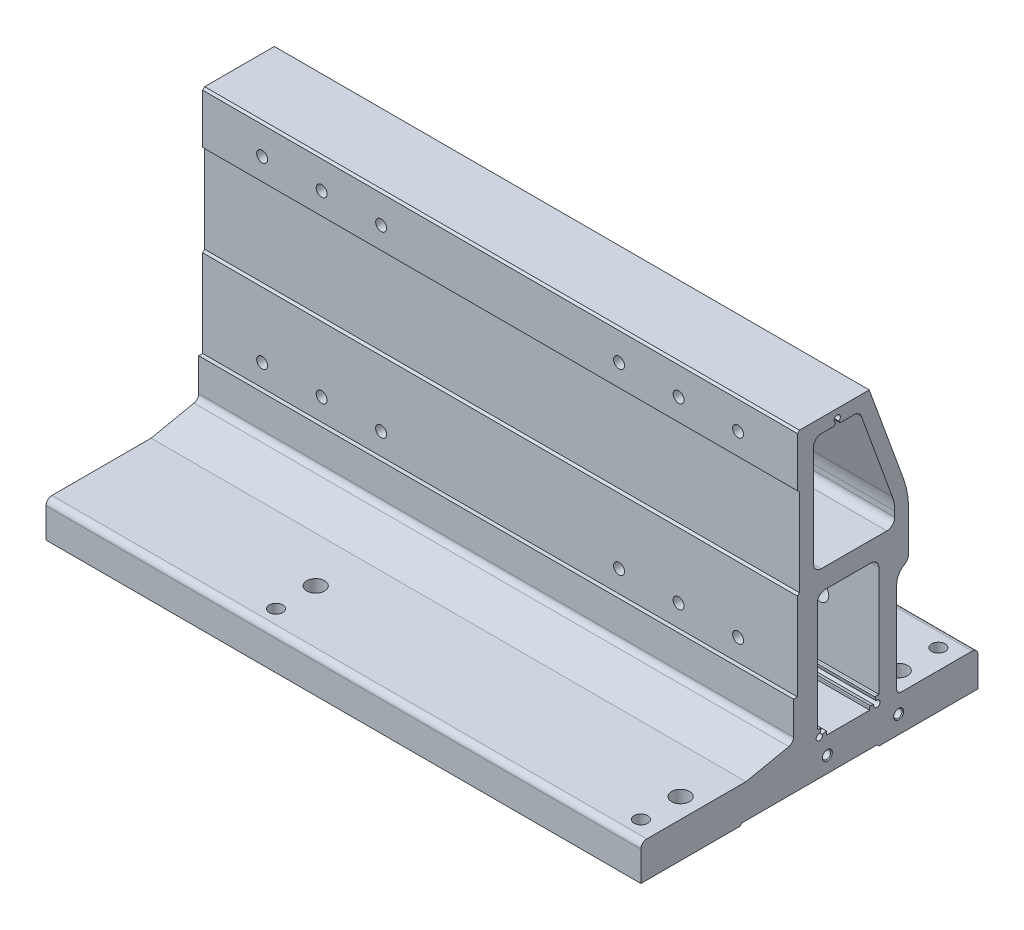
ISO-10303-21;
HEADER;
FILE_DESCRIPTION(('STEP AP214'),'2;1');
FILE_NAME('part.step','',(''),(''),'','','');
FILE_SCHEMA(('AUTOMOTIVE_DESIGN { 1 0 10303 214 1 1 1 1 }'));
ENDSEC;
DATA;
#1=APPLICATION_CONTEXT('core data for automotive mechanical design processes');
#2=APPLICATION_PROTOCOL_DEFINITION('international standard','automotive_design',2000,#1);
#3=PRODUCT_CONTEXT('',#1,'mechanical');
#4=PRODUCT('Part','Part','',(#3));
#5=PRODUCT_RELATED_PRODUCT_CATEGORY('part','',(#4));
#6=PRODUCT_DEFINITION_FORMATION('','',#4);
#7=PRODUCT_DEFINITION_CONTEXT('part definition',#1,'design');
#8=PRODUCT_DEFINITION('design','',#6,#7);
#9=PRODUCT_DEFINITION_SHAPE('','',#8);
#10=(LENGTH_UNIT() NAMED_UNIT(*) SI_UNIT(.MILLI.,.METRE.));
#11=(NAMED_UNIT(*) PLANE_ANGLE_UNIT() SI_UNIT($,.RADIAN.));
#12=(NAMED_UNIT(*) SI_UNIT($,.STERADIAN.) SOLID_ANGLE_UNIT());
#13=UNCERTAINTY_MEASURE_WITH_UNIT(LENGTH_MEASURE(1.E-05),#10,'distance_accuracy_value','');
#14=(GEOMETRIC_REPRESENTATION_CONTEXT(3) GLOBAL_UNCERTAINTY_ASSIGNED_CONTEXT((#13)) GLOBAL_UNIT_ASSIGNED_CONTEXT((#10,
#11,#12)) REPRESENTATION_CONTEXT('',''));
#15=CARTESIAN_POINT('',(0.,0.,0.));
#16=DIRECTION('',(0.,0.,1.));
#17=DIRECTION('',(1.,0.,0.));
#18=AXIS2_PLACEMENT_3D('',#15,#16,#17);
#19=CARTESIAN_POINT('',(150.,24.4394126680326,10.9999999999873));
#20=DIRECTION('',(1.,0.,0.));
#21=DIRECTION('',(0.,0.,-1.));
#22=AXIS2_PLACEMENT_3D('',#19,#20,#21);
#23=PLANE('',#22);
#24=CARTESIAN_POINT('',(150.,8.,-9.00000000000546));
#25=DIRECTION('',(1.,0.,0.));
#26=DIRECTION('',(0.,0.,-1.));
#27=AXIS2_PLACEMENT_3D('',#24,#25,#26);
#28=CIRCLE('',#27,2.525);
#29=CARTESIAN_POINT('',(150.,8.,-11.5250000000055));
#30=VERTEX_POINT('',#29);
#31=EDGE_CURVE('E530',#30,#30,#28,.T.);
#32=ORIENTED_EDGE('',*,*,#31,.F.);
#33=EDGE_LOOP('',(#32));
#34=FACE_BOUND('',#33,.T.);
#35=CARTESIAN_POINT('',(150.,8.,-45.0000000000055));
#36=DIRECTION('',(1.,0.,0.));
#37=DIRECTION('',(0.,0.,-1.));
#38=AXIS2_PLACEMENT_3D('',#35,#36,#37);
#39=CIRCLE('',#38,2.525);
#40=CARTESIAN_POINT('',(150.,8.,-47.5250000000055));
#41=VERTEX_POINT('',#40);
#42=EDGE_CURVE('E539',#41,#41,#39,.T.);
#43=ORIENTED_EDGE('',*,*,#42,.F.);
#44=EDGE_LOOP('',(#43));
#45=FACE_BOUND('',#44,.T.);
#46=DIRECTION('',(0.,0.,1.));
#47=VECTOR('',#46,1.);
#48=CARTESIAN_POINT('',(150.,156.999996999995,-30.149007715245));
#49=LINE('',#48,#47);
#50=CARTESIAN_POINT('',(150.,156.999996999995,-30.149007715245));
#51=VERTEX_POINT('',#50);
#52=CARTESIAN_POINT('',(150.,156.999996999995,4.99999999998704));
#53=VERTEX_POINT('',#52);
#54=EDGE_CURVE('E940',#51,#53,#49,.T.);
#55=ORIENTED_EDGE('',*,*,#54,.T.);
#56=DIRECTION('',(0.,-0.707106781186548,0.707106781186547));
#57=VECTOR('',#56,1.);
#58=CARTESIAN_POINT('',(150.,156.999996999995,4.99999999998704));
#59=LINE('',#58,#57);
#60=CARTESIAN_POINT('',(150.,155.999996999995,5.99999999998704));
#61=VERTEX_POINT('',#60);
#62=EDGE_CURVE('E1746',#53,#61,#59,.T.);
#63=ORIENTED_EDGE('',*,*,#62,.T.);
#64=DIRECTION('',(0.,-1.,0.));
#65=VECTOR('',#64,1.);
#66=CARTESIAN_POINT('',(150.,155.999996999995,5.99999999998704));
#67=LINE('',#66,#65);
#68=CARTESIAN_POINT('',(150.,130.999999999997,5.99999999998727));
#69=VERTEX_POINT('',#68);
#70=EDGE_CURVE('E879',#61,#69,#67,.T.);
#71=ORIENTED_EDGE('',*,*,#70,.T.);
#72=DIRECTION('',(0.,-0.707106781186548,-0.707106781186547));
#73=VECTOR('',#72,1.);
#74=CARTESIAN_POINT('',(150.,130.999999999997,5.99999999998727));
#75=LINE('',#74,#73);
#76=CARTESIAN_POINT('',(150.,129.999999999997,4.99999999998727));
#77=VERTEX_POINT('',#76);
#78=EDGE_CURVE('E1750',#69,#77,#75,.T.);
#79=ORIENTED_EDGE('',*,*,#78,.T.);
#80=DIRECTION('',(0.,-1.,0.));
#81=VECTOR('',#80,1.);
#82=CARTESIAN_POINT('',(150.,129.999999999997,4.99999999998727));
#83=LINE('',#82,#81);
#84=CARTESIAN_POINT('',(150.,85.9999999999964,4.99999999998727));
#85=VERTEX_POINT('',#84);
#86=EDGE_CURVE('E1752',#77,#85,#83,.T.);
#87=ORIENTED_EDGE('',*,*,#86,.T.);
#88=DIRECTION('',(0.,-0.707106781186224,0.707106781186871));
#89=VECTOR('',#88,1.);
#90=CARTESIAN_POINT('',(150.,85.9999999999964,4.99999999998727));
#91=LINE('',#90,#89);
#92=CARTESIAN_POINT('',(150.,84.9999999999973,5.99999999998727));
#93=VERTEX_POINT('',#92);
#94=EDGE_CURVE('E1754',#85,#93,#91,.T.);
#95=ORIENTED_EDGE('',*,*,#94,.T.);
#96=DIRECTION('',(0.,-1.,0.));
#97=VECTOR('',#96,1.);
#98=CARTESIAN_POINT('',(150.,84.9999999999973,5.99999999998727));
#99=LINE('',#98,#97);
#100=CARTESIAN_POINT('',(150.,40.9998314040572,5.99999999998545));
#101=VERTEX_POINT('',#100);
#102=EDGE_CURVE('E1756',#93,#101,#99,.T.);
#103=ORIENTED_EDGE('',*,*,#102,.T.);
#104=DIRECTION('',(0.,0.,1.));
#105=VECTOR('',#104,1.);
#106=CARTESIAN_POINT('',(150.,40.9998314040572,5.99999999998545));
#107=LINE('',#106,#105);
#108=CARTESIAN_POINT('',(150.,40.9998314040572,7.99999999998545));
#109=VERTEX_POINT('',#108);
#110=EDGE_CURVE('E1629',#101,#109,#107,.T.);
#111=ORIENTED_EDGE('',*,*,#110,.T.);
#112=DIRECTION('',(0.,-1.,1.09883992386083E-13));
#113=VECTOR('',#112,1.);
#114=CARTESIAN_POINT('',(150.,40.9998314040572,7.99999999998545));
#115=LINE('',#114,#113);
#116=CARTESIAN_POINT('',(150.,24.4394126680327,7.99999999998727));
#117=VERTEX_POINT('',#116);
#118=EDGE_CURVE('E1641',#109,#117,#115,.T.);
#119=ORIENTED_EDGE('',*,*,#118,.T.);
#120=CARTESIAN_POINT('',(150.,24.4394126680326,10.9999999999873));
#121=DIRECTION('',(-1.,0.,0.));
#122=DIRECTION('',(0.,0.,-1.));
#123=AXIS2_PLACEMENT_3D('',#120,#121,#122);
#124=CIRCLE('',#123,3.00000000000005);
#125=CARTESIAN_POINT('',(150.,21.5024714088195,10.3881372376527));
#126=VERTEX_POINT('',#125);
#127=EDGE_CURVE('E1637',#117,#126,#124,.T.);
#128=ORIENTED_EDGE('',*,*,#127,.T.);
#129=DIRECTION('',(0.,-0.20395425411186,0.978980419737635));
#130=VECTOR('',#129,1.);
#131=CARTESIAN_POINT('',(150.,21.5024714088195,10.3881372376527));
#132=LINE('',#131,#130);
#133=CARTESIAN_POINT('',(150.,17.,32.0000000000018));
#134=VERTEX_POINT('',#133);
#135=EDGE_CURVE('E1640',#126,#134,#132,.T.);
#136=ORIENTED_EDGE('',*,*,#135,.T.);
#137=DIRECTION('',(0.,0.,1.));
#138=VECTOR('',#137,1.);
#139=CARTESIAN_POINT('',(150.,17.,32.0000000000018));
#140=LINE('',#139,#138);
#141=CARTESIAN_POINT('',(150.,17.,82.0000000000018));
#142=VERTEX_POINT('',#141);
#143=EDGE_CURVE('E1643',#134,#142,#140,.T.);
#144=ORIENTED_EDGE('',*,*,#143,.T.);
#145=CARTESIAN_POINT('',(150.,14.,82.0000000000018));
#146=DIRECTION('',(1.,0.,0.));
#147=DIRECTION('',(0.,0.,-1.));
#148=AXIS2_PLACEMENT_3D('',#145,#146,#147);
#149=CIRCLE('',#148,3.);
#150=CARTESIAN_POINT('',(150.,14.,85.0000000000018));
#151=VERTEX_POINT('',#150);
#152=EDGE_CURVE('E1649',#142,#151,#149,.T.);
#153=ORIENTED_EDGE('',*,*,#152,.T.);
#154=DIRECTION('',(0.,-1.,0.));
#155=VECTOR('',#154,1.);
#156=CARTESIAN_POINT('',(150.,14.,85.0000000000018));
#157=LINE('',#156,#155);
#158=CARTESIAN_POINT('',(150.,-1.,85.0000000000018));
#159=VERTEX_POINT('',#158);
#160=EDGE_CURVE('E1651',#151,#159,#157,.T.);
#161=ORIENTED_EDGE('',*,*,#160,.T.);
#162=DIRECTION('',(0.,0.,-1.));
#163=VECTOR('',#162,1.);
#164=CARTESIAN_POINT('',(150.,-1.,85.0000000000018));
#165=LINE('',#164,#163);
#166=CARTESIAN_POINT('',(150.,-1.,35.0000000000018));
#167=VERTEX_POINT('',#166);
#168=EDGE_CURVE('E1653',#159,#167,#165,.T.);
#169=ORIENTED_EDGE('',*,*,#168,.T.);
#170=DIRECTION('',(0.,0.707106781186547,-0.707106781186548));
#171=VECTOR('',#170,1.);
#172=CARTESIAN_POINT('',(150.,-1.,35.0000000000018));
#173=LINE('',#172,#171);
#174=CARTESIAN_POINT('',(150.,0.,34.0000000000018));
#175=VERTEX_POINT('',#174);
#176=EDGE_CURVE('E1655',#167,#175,#173,.T.);
#177=ORIENTED_EDGE('',*,*,#176,.T.);
#178=DIRECTION('',(0.,0.,-1.));
#179=VECTOR('',#178,1.);
#180=CARTESIAN_POINT('',(150.,0.,34.0000000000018));
#181=LINE('',#180,#179);
#182=CARTESIAN_POINT('',(150.,0.,-34.0000000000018));
#183=VERTEX_POINT('',#182);
#184=EDGE_CURVE('E1657',#175,#183,#181,.T.);
#185=ORIENTED_EDGE('',*,*,#184,.T.);
#186=DIRECTION('',(0.,-0.707106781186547,-0.707106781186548));
#187=VECTOR('',#186,1.);
#188=CARTESIAN_POINT('',(150.,0.,-34.0000000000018));
#189=LINE('',#188,#187);
#190=CARTESIAN_POINT('',(150.,-1.,-35.0000000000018));
#191=VERTEX_POINT('',#190);
#192=EDGE_CURVE('E1659',#183,#191,#189,.T.);
#193=ORIENTED_EDGE('',*,*,#192,.T.);
#194=DIRECTION('',(0.,0.,-1.));
#195=VECTOR('',#194,1.);
#196=CARTESIAN_POINT('',(150.,-1.,-35.0000000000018));
#197=LINE('',#196,#195);
#198=CARTESIAN_POINT('',(150.,-1.,-85.0000000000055));
#199=VERTEX_POINT('',#198);
#200=EDGE_CURVE('E1661',#191,#199,#197,.T.);
#201=ORIENTED_EDGE('',*,*,#200,.T.);
#202=DIRECTION('',(0.,1.,0.));
#203=VECTOR('',#202,1.);
#204=CARTESIAN_POINT('',(150.,-1.,-85.0000000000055));
#205=LINE('',#204,#203);
#206=CARTESIAN_POINT('',(150.,14.,-85.0000000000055));
#207=VERTEX_POINT('',#206);
#208=EDGE_CURVE('E1663',#199,#207,#205,.T.);
#209=ORIENTED_EDGE('',*,*,#208,.T.);
#210=CARTESIAN_POINT('',(150.,14.,-82.0000000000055));
#211=DIRECTION('',(1.,0.,0.));
#212=DIRECTION('',(0.,0.,-1.));
#213=AXIS2_PLACEMENT_3D('',#210,#211,#212);
#214=CIRCLE('',#213,3.);
#215=CARTESIAN_POINT('',(150.,17.,-82.0000000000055));
#216=VERTEX_POINT('',#215);
#217=EDGE_CURVE('E1665',#207,#216,#214,.T.);
#218=ORIENTED_EDGE('',*,*,#217,.T.);
#219=DIRECTION('',(0.,0.,1.));
#220=VECTOR('',#219,1.);
#221=CARTESIAN_POINT('',(150.,17.,-82.0000000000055));
#222=LINE('',#221,#220);
#223=CARTESIAN_POINT('',(150.,17.,-46.0000000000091));
#224=VERTEX_POINT('',#223);
#225=EDGE_CURVE('E1667',#216,#224,#222,.T.);
#226=ORIENTED_EDGE('',*,*,#225,.T.);
#227=CARTESIAN_POINT('',(150.,19.,-46.0000000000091));
#228=DIRECTION('',(-1.,0.,0.));
#229=DIRECTION('',(0.,0.,-1.));
#230=AXIS2_PLACEMENT_3D('',#227,#228,#229);
#231=CIRCLE('',#230,2.);
#232=CARTESIAN_POINT('',(150.,19.,-44.0000000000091));
#233=VERTEX_POINT('',#232);
#234=EDGE_CURVE('E1669',#224,#233,#231,.T.);
#235=ORIENTED_EDGE('',*,*,#234,.T.);
#236=DIRECTION('',(0.,1.,0.));
#237=VECTOR('',#236,1.);
#238=CARTESIAN_POINT('',(150.,19.,-44.0000000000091));
#239=LINE('',#238,#237);
#240=CARTESIAN_POINT('',(150.,65.0000000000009,-44.0000000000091));
#241=VERTEX_POINT('',#240);
#242=EDGE_CURVE('E1671',#233,#241,#239,.T.);
#243=ORIENTED_EDGE('',*,*,#242,.T.);
#244=CARTESIAN_POINT('',(150.,64.9999999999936,-52.0000000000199));
#245=DIRECTION('',(-1.,0.,0.));
#246=DIRECTION('',(0.,0.,-1.));
#247=AXIS2_PLACEMENT_3D('',#244,#245,#246);
#248=CIRCLE('',#247,8.0000000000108);
#249=CARTESIAN_POINT('',(150.,71.9282032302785,-48.0000000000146));
#250=VERTEX_POINT('',#249);
#251=EDGE_CURVE('E1673',#241,#250,#248,.T.);
#252=ORIENTED_EDGE('',*,*,#251,.T.);
#253=CARTESIAN_POINT('',(150.,75.3923048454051,-46.0000000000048));
#254=DIRECTION('',(1.,0.,0.));
#255=DIRECTION('',(0.,0.,-1.));
#256=AXIS2_PLACEMENT_3D('',#253,#254,#255);
#257=CIRCLE('',#256,3.99999999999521);
#258=CARTESIAN_POINT('',(150.,75.3923048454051,-50.));
#259=VERTEX_POINT('',#258);
#260=EDGE_CURVE('E1675',#250,#259,#257,.T.);
#261=ORIENTED_EDGE('',*,*,#260,.T.);
#262=DIRECTION('',(0.,1.,0.));
#263=VECTOR('',#262,1.);
#264=CARTESIAN_POINT('',(150.,75.3923048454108,-50.));
#265=LINE('',#264,#263);
#266=CARTESIAN_POINT('',(150.,95.4420377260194,-50.0000000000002));
#267=VERTEX_POINT('',#266);
#268=EDGE_CURVE('E1677',#259,#267,#265,.T.);
#269=ORIENTED_EDGE('',*,*,#268,.T.);
#270=CARTESIAN_POINT('',(150.,95.4420377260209,-9.99999999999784));
#271=DIRECTION('',(1.,0.,0.));
#272=DIRECTION('',(0.,0.,-1.));
#273=AXIS2_PLACEMENT_3D('',#270,#271,#272);
#274=CIRCLE('',#273,40.0000000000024);
#275=CARTESIAN_POINT('',(150.,109.131743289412,-47.5844643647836));
#276=VERTEX_POINT('',#275);
#277=EDGE_CURVE('E1679',#267,#276,#274,.T.);
#278=ORIENTED_EDGE('',*,*,#277,.T.);
#279=DIRECTION('',(0.,0.939611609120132,0.342242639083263));
#280=VECTOR('',#279,1.);
#281=CARTESIAN_POINT('',(150.,109.131743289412,-47.5844643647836));
#282=LINE('',#281,#280);
#283=EDGE_CURVE('E945',#276,#51,#282,.T.);
#284=ORIENTED_EDGE('',*,*,#283,.T.);
#285=EDGE_LOOP('',(#55,#63,#71,#79,#87,#95,#103,#111,#119,#128,#136,#144,#153,#161,#169,#177,
#185,#193,#201,#209,#218,#226,#235,#243,#252,#261,#269,#278,#284));
#286=FACE_BOUND('',#285,.T.);
#287=DIRECTION('',(0.,-1.,0.));
#288=VECTOR('',#287,1.);
#289=CARTESIAN_POINT('',(150.,146.000000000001,-2.00000000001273));
#290=LINE('',#289,#288);
#291=CARTESIAN_POINT('',(150.,146.000000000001,-2.00000000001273));
#292=VERTEX_POINT('',#291);
#293=CARTESIAN_POINT('',(150.,95.0000000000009,-2.00000000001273));
#294=VERTEX_POINT('',#293);
#295=EDGE_CURVE('E1374',#292,#294,#290,.T.);
#296=ORIENTED_EDGE('',*,*,#295,.F.);
#297=CARTESIAN_POINT('',(150.,146.000000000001,-6.00000000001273));
#298=DIRECTION('',(1.,0.,0.));
#299=DIRECTION('',(0.,0.,-1.));
#300=AXIS2_PLACEMENT_3D('',#297,#298,#299);
#301=CIRCLE('',#300,4.);
#302=CARTESIAN_POINT('',(150.,150.000000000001,-6.00000000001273));
#303=VERTEX_POINT('',#302);
#304=EDGE_CURVE('E1309',#303,#292,#301,.T.);
#305=ORIENTED_EDGE('',*,*,#304,.F.);
#306=DIRECTION('',(0.,1.39695933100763E-13,1.));
#307=VECTOR('',#306,1.);
#308=CARTESIAN_POINT('',(150.,150.,-12.5566260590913));
#309=LINE('',#308,#307);
#310=CARTESIAN_POINT('',(150.,150.,-12.5566260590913));
#311=VERTEX_POINT('',#310);
#312=EDGE_CURVE('E1305',#311,#303,#309,.T.);
#313=ORIENTED_EDGE('',*,*,#312,.F.);
#314=DIRECTION('',(0.,-0.866025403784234,0.500000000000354));
#315=VECTOR('',#314,1.);
#316=CARTESIAN_POINT('',(150.,151.114356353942,-13.2000000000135));
#317=LINE('',#316,#315);
#318=CARTESIAN_POINT('',(150.,151.114356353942,-13.2000000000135));
#319=VERTEX_POINT('',#318);
#320=EDGE_CURVE('E1351',#319,#311,#317,.T.);
#321=ORIENTED_EDGE('',*,*,#320,.F.);
#322=CARTESIAN_POINT('',(150.,152.499996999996,-14.0000000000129));
#323=DIRECTION('',(1.,0.,0.));
#324=DIRECTION('',(0.,0.,-1.));
#325=AXIS2_PLACEMENT_3D('',#322,#323,#324);
#326=CIRCLE('',#325,1.59999999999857);
#327=CARTESIAN_POINT('',(150.,151.114356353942,-14.800000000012));
#328=VERTEX_POINT('',#327);
#329=EDGE_CURVE('E1354',#328,#319,#326,.T.);
#330=ORIENTED_EDGE('',*,*,#329,.F.);
#331=DIRECTION('',(0.,0.866025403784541,0.499999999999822));
#332=VECTOR('',#331,1.);
#333=CARTESIAN_POINT('',(150.,149.999999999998,-15.4433739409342));
#334=LINE('',#333,#332);
#335=CARTESIAN_POINT('',(150.,149.999999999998,-15.4433739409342));
#336=VERTEX_POINT('',#335);
#337=EDGE_CURVE('E1356',#336,#328,#334,.T.);
#338=ORIENTED_EDGE('',*,*,#337,.F.);
#339=DIRECTION('',(0.,1.3074889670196E-13,1.));
#340=VECTOR('',#339,1.);
#341=CARTESIAN_POINT('',(150.,149.999999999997,-22.4486643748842));
#342=LINE('',#341,#340);
#343=CARTESIAN_POINT('',(150.,149.999999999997,-22.4486643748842));
#344=VERTEX_POINT('',#343);
#345=EDGE_CURVE('E1358',#344,#336,#342,.T.);
#346=ORIENTED_EDGE('',*,*,#345,.F.);
#347=CARTESIAN_POINT('',(150.,145.999999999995,-22.4486643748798));
#348=DIRECTION('',(1.,0.,0.));
#349=DIRECTION('',(0.,0.,-1.));
#350=AXIS2_PLACEMENT_3D('',#347,#348,#349);
#351=CIRCLE('',#350,4.00000000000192);
#352=CARTESIAN_POINT('',(150.,147.368970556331,-26.2071108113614));
#353=VERTEX_POINT('',#352);
#354=EDGE_CURVE('E1360',#353,#344,#351,.T.);
#355=ORIENTED_EDGE('',*,*,#354,.F.);
#356=DIRECTION('',(0.,0.939611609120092,0.342242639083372));
#357=VECTOR('',#356,1.);
#358=CARTESIAN_POINT('',(150.,104.580728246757,-41.7922321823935));
#359=LINE('',#358,#357);
#360=CARTESIAN_POINT('',(150.,104.580728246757,-41.7922321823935));
#361=VERTEX_POINT('',#360);
#362=EDGE_CURVE('E1362',#361,#353,#359,.T.);
#363=ORIENTED_EDGE('',*,*,#362,.F.);
#364=CARTESIAN_POINT('',(150.,97.7358754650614,-22.9999999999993));
#365=DIRECTION('',(1.,0.,0.));
#366=DIRECTION('',(0.,0.,-1.));
#367=AXIS2_PLACEMENT_3D('',#364,#365,#366);
#368=CIRCLE('',#367,20.0000000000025);
#369=CARTESIAN_POINT('',(150.,97.7358754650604,-43.0000000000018));
#370=VERTEX_POINT('',#369);
#371=EDGE_CURVE('E1364',#370,#361,#368,.T.);
#372=ORIENTED_EDGE('',*,*,#371,.F.);
#373=DIRECTION('',(0.,1.,0.));
#374=VECTOR('',#373,1.);
#375=CARTESIAN_POINT('',(150.,95.,-43.0000000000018));
#376=LINE('',#375,#374);
#377=CARTESIAN_POINT('',(150.,95.,-43.0000000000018));
#378=VERTEX_POINT('',#377);
#379=EDGE_CURVE('E1366',#378,#370,#376,.T.);
#380=ORIENTED_EDGE('',*,*,#379,.F.);
#381=CARTESIAN_POINT('',(150.,95.0000000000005,-39.0000000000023));
#382=DIRECTION('',(1.,0.,0.));
#383=DIRECTION('',(0.,0.,-1.));
#384=AXIS2_PLACEMENT_3D('',#381,#382,#383);
#385=CIRCLE('',#384,3.99999999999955);
#386=CARTESIAN_POINT('',(150.,91.0000000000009,-39.0000000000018));
#387=VERTEX_POINT('',#386);
#388=EDGE_CURVE('E1368',#387,#378,#385,.T.);
#389=ORIENTED_EDGE('',*,*,#388,.F.);
#390=DIRECTION('',(0.,0.,-1.));
#391=VECTOR('',#390,1.);
#392=CARTESIAN_POINT('',(150.,91.0000000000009,-6.00000000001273));
#393=LINE('',#392,#391);
#394=CARTESIAN_POINT('',(150.,91.0000000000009,-6.00000000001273));
#395=VERTEX_POINT('',#394);
#396=EDGE_CURVE('E1370',#395,#387,#393,.T.);
#397=ORIENTED_EDGE('',*,*,#396,.F.);
#398=CARTESIAN_POINT('',(150.,95.0000000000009,-6.00000000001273));
#399=DIRECTION('',(1.,0.,0.));
#400=DIRECTION('',(0.,0.,-1.));
#401=AXIS2_PLACEMENT_3D('',#398,#399,#400);
#402=CIRCLE('',#401,4.);
#403=EDGE_CURVE('E1372',#294,#395,#402,.T.);
#404=ORIENTED_EDGE('',*,*,#403,.F.);
#405=EDGE_LOOP('',(#296,#305,#313,#321,#330,#338,#346,#355,#363,#372,#380,#389,#397,#404));
#406=FACE_BOUND('',#405,.T.);
#407=DIRECTION('',(0.,-1.,0.));
#408=VECTOR('',#407,1.);
#409=CARTESIAN_POINT('',(150.,76.9999999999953,-4.00000000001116));
#410=LINE('',#409,#408);
#411=CARTESIAN_POINT('',(150.,76.9999999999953,-4.00000000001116));
#412=VERTEX_POINT('',#411);
#413=CARTESIAN_POINT('',(150.,21.5999999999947,-4.00000000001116));
#414=VERTEX_POINT('',#413);
#415=EDGE_CURVE('E1515',#412,#414,#410,.T.);
#416=ORIENTED_EDGE('',*,*,#415,.F.);
#417=CARTESIAN_POINT('',(150.,76.9999999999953,-8.00000000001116));
#418=DIRECTION('',(1.,0.,0.));
#419=DIRECTION('',(0.,0.,-1.));
#420=AXIS2_PLACEMENT_3D('',#417,#418,#419);
#421=CIRCLE('',#420,3.99999999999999);
#422=CARTESIAN_POINT('',(150.,80.9999999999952,-8.00000000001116));
#423=VERTEX_POINT('',#422);
#424=EDGE_CURVE('E1422',#423,#412,#421,.T.);
#425=ORIENTED_EDGE('',*,*,#424,.F.);
#426=DIRECTION('',(0.,0.,1.));
#427=VECTOR('',#426,1.);
#428=CARTESIAN_POINT('',(150.,80.9999999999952,-31.0000000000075));
#429=LINE('',#428,#427);
#430=CARTESIAN_POINT('',(150.,80.9999999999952,-31.0000000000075));
#431=VERTEX_POINT('',#430);
#432=EDGE_CURVE('E1418',#431,#423,#429,.T.);
#433=ORIENTED_EDGE('',*,*,#432,.F.);
#434=CARTESIAN_POINT('',(150.,76.9999999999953,-31.0000000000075));
#435=DIRECTION('',(1.,0.,0.));
#436=DIRECTION('',(0.,0.,-1.));
#437=AXIS2_PLACEMENT_3D('',#434,#435,#436);
#438=CIRCLE('',#437,3.99999999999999);
#439=CARTESIAN_POINT('',(150.,76.9999999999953,-35.0000000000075));
#440=VERTEX_POINT('',#439);
#441=EDGE_CURVE('E1480',#440,#431,#438,.T.);
#442=ORIENTED_EDGE('',*,*,#441,.F.);
#443=DIRECTION('',(0.,1.,0.));
#444=VECTOR('',#443,1.);
#445=CARTESIAN_POINT('',(150.,21.5999999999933,-35.0000000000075));
#446=LINE('',#445,#444);
#447=CARTESIAN_POINT('',(150.,21.5999999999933,-35.0000000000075));
#448=VERTEX_POINT('',#447);
#449=EDGE_CURVE('E1483',#448,#440,#446,.T.);
#450=ORIENTED_EDGE('',*,*,#449,.F.);
#451=DIRECTION('',(0.,0.,-1.));
#452=VECTOR('',#451,1.);
#453=CARTESIAN_POINT('',(150.,21.5999999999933,-34.0000000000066));
#454=LINE('',#453,#452);
#455=CARTESIAN_POINT('',(150.,21.5999999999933,-34.0000000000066));
#456=VERTEX_POINT('',#455);
#457=EDGE_CURVE('E1485',#456,#448,#454,.T.);
#458=ORIENTED_EDGE('',*,*,#457,.F.);
#459=CARTESIAN_POINT('',(150.,18.000000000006,-34.0000000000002));
#460=DIRECTION('',(-1.,0.,0.));
#461=DIRECTION('',(0.,0.,-1.));
#462=AXIS2_PLACEMENT_3D('',#459,#460,#461);
#463=CIRCLE('',#462,3.59999999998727);
#464=CARTESIAN_POINT('',(150.,21.4773329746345,-33.0682514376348));
#465=VERTEX_POINT('',#464);
#466=EDGE_CURVE('E1487',#465,#456,#463,.T.);
#467=ORIENTED_EDGE('',*,*,#466,.F.);
#468=DIRECTION('',(0.,0.965925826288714,0.258819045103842));
#469=VECTOR('',#468,1.);
#470=CARTESIAN_POINT('',(150.,19.5454813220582,-33.5858895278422));
#471=LINE('',#470,#469);
#472=CARTESIAN_POINT('',(150.,19.5454813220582,-33.5858895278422));
#473=VERTEX_POINT('',#472);
#474=EDGE_CURVE('E1489',#473,#465,#471,.T.);
#475=ORIENTED_EDGE('',*,*,#474,.F.);
#476=CARTESIAN_POINT('',(150.,18.000000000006,-34.0000000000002));
#477=DIRECTION('',(1.,0.,0.));
#478=DIRECTION('',(0.,0.,-1.));
#479=AXIS2_PLACEMENT_3D('',#476,#477,#478);
#480=CIRCLE('',#479,1.59999999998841);
#481=CARTESIAN_POINT('',(150.,18.4141104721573,-32.4545186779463));
#482=VERTEX_POINT('',#481);
#483=EDGE_CURVE('E1491',#482,#473,#480,.T.);
#484=ORIENTED_EDGE('',*,*,#483,.F.);
#485=DIRECTION('',(0.,-0.258819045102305,-0.965925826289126));
#486=VECTOR('',#485,1.);
#487=CARTESIAN_POINT('',(150.,18.9317485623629,-30.5226670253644));
#488=LINE('',#487,#486);
#489=CARTESIAN_POINT('',(150.,18.9317485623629,-30.5226670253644));
#490=VERTEX_POINT('',#489);
#491=EDGE_CURVE('E1493',#490,#482,#488,.T.);
#492=ORIENTED_EDGE('',*,*,#491,.F.);
#493=CARTESIAN_POINT('',(150.,18.000000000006,-34.0000000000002));
#494=DIRECTION('',(-1.,0.,0.));
#495=DIRECTION('',(0.,0.,-1.));
#496=AXIS2_PLACEMENT_3D('',#493,#494,#495);
#497=CIRCLE('',#496,3.59999999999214);
#498=CARTESIAN_POINT('',(150.,17.9999999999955,-30.4000000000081));
#499=VERTEX_POINT('',#498);
#500=EDGE_CURVE('E1495',#499,#490,#497,.T.);
#501=ORIENTED_EDGE('',*,*,#500,.F.);
#502=DIRECTION('',(0.,1.,0.));
#503=VECTOR('',#502,1.);
#504=CARTESIAN_POINT('',(150.,16.9999999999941,-30.4000000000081));
#505=LINE('',#504,#503);
#506=CARTESIAN_POINT('',(150.,16.9999999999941,-30.4000000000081));
#507=VERTEX_POINT('',#506);
#508=EDGE_CURVE('E1497',#507,#499,#505,.T.);
#509=ORIENTED_EDGE('',*,*,#508,.F.);
#510=DIRECTION('',(0.,0.,-1.));
#511=VECTOR('',#510,1.);
#512=CARTESIAN_POINT('',(150.,16.9999999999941,-8.60000000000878));
#513=LINE('',#512,#511);
#514=CARTESIAN_POINT('',(150.,16.9999999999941,-8.60000000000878));
#515=VERTEX_POINT('',#514);
#516=EDGE_CURVE('E1499',#515,#507,#513,.T.);
#517=ORIENTED_EDGE('',*,*,#516,.F.);
#518=DIRECTION('',(0.,-1.,0.));
#519=VECTOR('',#518,1.);
#520=CARTESIAN_POINT('',(150.,17.9999999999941,-8.60000000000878));
#521=LINE('',#520,#519);
#522=CARTESIAN_POINT('',(150.,17.9999999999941,-8.60000000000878));
#523=VERTEX_POINT('',#522);
#524=EDGE_CURVE('E1501',#523,#515,#521,.T.);
#525=ORIENTED_EDGE('',*,*,#524,.F.);
#526=CARTESIAN_POINT('',(150.,18.0000000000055,-5.00000000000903));
#527=DIRECTION('',(-1.,0.,0.));
#528=DIRECTION('',(0.,0.,-1.));
#529=AXIS2_PLACEMENT_3D('',#526,#527,#528);
#530=CIRCLE('',#529,3.59999999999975);
#531=CARTESIAN_POINT('',(150.,18.9317485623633,-8.47733297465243));
#532=VERTEX_POINT('',#531);
#533=EDGE_CURVE('E1503',#532,#523,#530,.T.);
#534=ORIENTED_EDGE('',*,*,#533,.F.);
#535=DIRECTION('',(0.,0.258819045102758,-0.965925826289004));
#536=VECTOR('',#535,1.);
#537=CARTESIAN_POINT('',(150.,18.4141104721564,-6.54548132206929));
#538=LINE('',#537,#536);
#539=CARTESIAN_POINT('',(150.,18.4141104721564,-6.54548132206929));
#540=VERTEX_POINT('',#539);
#541=EDGE_CURVE('E1505',#540,#532,#538,.T.);
#542=ORIENTED_EDGE('',*,*,#541,.F.);
#543=CARTESIAN_POINT('',(150.,18.0000000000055,-5.00000000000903));
#544=DIRECTION('',(1.,0.,0.));
#545=DIRECTION('',(0.,0.,-1.));
#546=AXIS2_PLACEMENT_3D('',#543,#544,#545);
#547=CIRCLE('',#546,1.59999999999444);
#548=CARTESIAN_POINT('',(150.,19.5454813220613,-5.41411047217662));
#549=VERTEX_POINT('',#548);
#550=EDGE_CURVE('E1507',#549,#540,#547,.T.);
#551=ORIENTED_EDGE('',*,*,#550,.F.);
#552=DIRECTION('',(0.,-0.965925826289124,0.258819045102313));
#553=VECTOR('',#552,1.);
#554=CARTESIAN_POINT('',(150.,21.4773329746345,-5.9317485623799));
#555=LINE('',#554,#553);
#556=CARTESIAN_POINT('',(150.,21.4773329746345,-5.9317485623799));
#557=VERTEX_POINT('',#556);
#558=EDGE_CURVE('E1509',#557,#549,#555,.T.);
#559=ORIENTED_EDGE('',*,*,#558,.F.);
#560=CARTESIAN_POINT('',(150.,18.0000000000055,-5.00000000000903));
#561=DIRECTION('',(-1.,0.,0.));
#562=DIRECTION('',(0.,0.,-1.));
#563=AXIS2_PLACEMENT_3D('',#560,#561,#562);
#564=CIRCLE('',#563,3.59999999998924);
#565=CARTESIAN_POINT('',(150.,21.5999999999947,-5.00000000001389));
#566=VERTEX_POINT('',#565);
#567=EDGE_CURVE('E1511',#566,#557,#564,.T.);
#568=ORIENTED_EDGE('',*,*,#567,.F.);
#569=DIRECTION('',(0.,0.,-1.));
#570=VECTOR('',#569,1.);
#571=CARTESIAN_POINT('',(150.,21.5999999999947,-4.00000000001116));
#572=LINE('',#571,#570);
#573=EDGE_CURVE('E1513',#414,#566,#572,.T.);
#574=ORIENTED_EDGE('',*,*,#573,.F.);
#575=EDGE_LOOP('',(#416,#425,#433,#442,#450,#458,#467,#475,#484,#492,#501,#509,#517,#525,#534,
#542,#551,#559,#568,#574));
#576=FACE_BOUND('',#575,.T.);
#577=ADVANCED_FACE('F37',(#34,#45,#286,#406,#576),#23,.T.);
#578=CARTESIAN_POINT('',(-150.,24.4394126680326,10.9999999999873));
#579=DIRECTION('',(1.,0.,0.));
#580=DIRECTION('',(0.,0.,-1.));
#581=AXIS2_PLACEMENT_3D('',#578,#579,#580);
#582=PLANE('',#581);
#583=CARTESIAN_POINT('',(-150.,146.000000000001,-6.00000000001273));
#584=DIRECTION('',(1.,0.,0.));
#585=DIRECTION('',(0.,0.,-1.));
#586=AXIS2_PLACEMENT_3D('',#583,#584,#585);
#587=CIRCLE('',#586,4.);
#588=CARTESIAN_POINT('',(-150.,150.000000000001,-6.00000000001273));
#589=VERTEX_POINT('',#588);
#590=CARTESIAN_POINT('',(-150.,146.000000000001,-2.00000000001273));
#591=VERTEX_POINT('',#590);
#592=EDGE_CURVE('E1346',#589,#591,#587,.T.);
#593=ORIENTED_EDGE('',*,*,#592,.T.);
#594=DIRECTION('',(0.,-1.,0.));
#595=VECTOR('',#594,1.);
#596=CARTESIAN_POINT('',(-150.,146.000000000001,-2.00000000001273));
#597=LINE('',#596,#595);
#598=CARTESIAN_POINT('',(-150.,95.0000000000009,-2.00000000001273));
#599=VERTEX_POINT('',#598);
#600=EDGE_CURVE('E1343',#591,#599,#597,.T.);
#601=ORIENTED_EDGE('',*,*,#600,.T.);
#602=CARTESIAN_POINT('',(-150.,95.0000000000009,-6.00000000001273));
#603=DIRECTION('',(1.,0.,0.));
#604=DIRECTION('',(0.,0.,-1.));
#605=AXIS2_PLACEMENT_3D('',#602,#603,#604);
#606=CIRCLE('',#605,4.);
#607=CARTESIAN_POINT('',(-150.,91.0000000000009,-6.00000000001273));
#608=VERTEX_POINT('',#607);
#609=EDGE_CURVE('E1340',#599,#608,#606,.T.);
#610=ORIENTED_EDGE('',*,*,#609,.T.);
#611=DIRECTION('',(0.,0.,-1.));
#612=VECTOR('',#611,1.);
#613=CARTESIAN_POINT('',(-150.,91.0000000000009,-6.00000000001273));
#614=LINE('',#613,#612);
#615=CARTESIAN_POINT('',(-150.,91.0000000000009,-39.0000000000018));
#616=VERTEX_POINT('',#615);
#617=EDGE_CURVE('E1337',#608,#616,#614,.T.);
#618=ORIENTED_EDGE('',*,*,#617,.T.);
#619=CARTESIAN_POINT('',(-150.,95.0000000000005,-39.0000000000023));
#620=DIRECTION('',(1.,0.,0.));
#621=DIRECTION('',(0.,0.,-1.));
#622=AXIS2_PLACEMENT_3D('',#619,#620,#621);
#623=CIRCLE('',#622,3.99999999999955);
#624=CARTESIAN_POINT('',(-150.,95.,-43.0000000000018));
#625=VERTEX_POINT('',#624);
#626=EDGE_CURVE('E1334',#616,#625,#623,.T.);
#627=ORIENTED_EDGE('',*,*,#626,.T.);
#628=DIRECTION('',(0.,1.,0.));
#629=VECTOR('',#628,1.);
#630=CARTESIAN_POINT('',(-150.,95.,-43.0000000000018));
#631=LINE('',#630,#629);
#632=CARTESIAN_POINT('',(-150.,97.7358754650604,-43.0000000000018));
#633=VERTEX_POINT('',#632);
#634=EDGE_CURVE('E1331',#625,#633,#631,.T.);
#635=ORIENTED_EDGE('',*,*,#634,.T.);
#636=CARTESIAN_POINT('',(-150.,97.7358754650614,-22.9999999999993));
#637=DIRECTION('',(1.,0.,0.));
#638=DIRECTION('',(0.,0.,-1.));
#639=AXIS2_PLACEMENT_3D('',#636,#637,#638);
#640=CIRCLE('',#639,20.0000000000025);
#641=CARTESIAN_POINT('',(-150.,104.580728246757,-41.7922321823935));
#642=VERTEX_POINT('',#641);
#643=EDGE_CURVE('E1328',#633,#642,#640,.T.);
#644=ORIENTED_EDGE('',*,*,#643,.T.);
#645=DIRECTION('',(0.,0.939611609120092,0.342242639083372));
#646=VECTOR('',#645,1.);
#647=CARTESIAN_POINT('',(-150.,104.580728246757,-41.7922321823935));
#648=LINE('',#647,#646);
#649=CARTESIAN_POINT('',(-150.,147.368970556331,-26.2071108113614));
#650=VERTEX_POINT('',#649);
#651=EDGE_CURVE('E1325',#642,#650,#648,.T.);
#652=ORIENTED_EDGE('',*,*,#651,.T.);
#653=CARTESIAN_POINT('',(-150.,145.999999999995,-22.4486643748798));
#654=DIRECTION('',(1.,0.,0.));
#655=DIRECTION('',(0.,0.,-1.));
#656=AXIS2_PLACEMENT_3D('',#653,#654,#655);
#657=CIRCLE('',#656,4.00000000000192);
#658=CARTESIAN_POINT('',(-150.,149.999999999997,-22.4486643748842));
#659=VERTEX_POINT('',#658);
#660=EDGE_CURVE('E1322',#650,#659,#657,.T.);
#661=ORIENTED_EDGE('',*,*,#660,.T.);
#662=DIRECTION('',(0.,1.3074889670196E-13,1.));
#663=VECTOR('',#662,1.);
#664=CARTESIAN_POINT('',(-150.,149.999999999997,-22.4486643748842));
#665=LINE('',#664,#663);
#666=CARTESIAN_POINT('',(-150.,149.999999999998,-15.4433739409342));
#667=VERTEX_POINT('',#666);
#668=EDGE_CURVE('E1319',#659,#667,#665,.T.);
#669=ORIENTED_EDGE('',*,*,#668,.T.);
#670=DIRECTION('',(0.,0.866025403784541,0.499999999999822));
#671=VECTOR('',#670,1.);
#672=CARTESIAN_POINT('',(-150.,149.999999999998,-15.4433739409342));
#673=LINE('',#672,#671);
#674=CARTESIAN_POINT('',(-150.,151.114356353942,-14.800000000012));
#675=VERTEX_POINT('',#674);
#676=EDGE_CURVE('E1316',#667,#675,#673,.T.);
#677=ORIENTED_EDGE('',*,*,#676,.T.);
#678=CARTESIAN_POINT('',(-150.,152.499996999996,-14.0000000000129));
#679=DIRECTION('',(1.,0.,0.));
#680=DIRECTION('',(0.,0.,-1.));
#681=AXIS2_PLACEMENT_3D('',#678,#679,#680);
#682=CIRCLE('',#681,1.59999999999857);
#683=CARTESIAN_POINT('',(-150.,151.114356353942,-13.2000000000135));
#684=VERTEX_POINT('',#683);
#685=EDGE_CURVE('E1313',#675,#684,#682,.T.);
#686=ORIENTED_EDGE('',*,*,#685,.T.);
#687=DIRECTION('',(0.,-0.866025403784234,0.500000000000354));
#688=VECTOR('',#687,1.);
#689=CARTESIAN_POINT('',(-150.,151.114356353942,-13.2000000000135));
#690=LINE('',#689,#688);
#691=CARTESIAN_POINT('',(-150.,150.,-12.5566260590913));
#692=VERTEX_POINT('',#691);
#693=EDGE_CURVE('E1310',#684,#692,#690,.T.);
#694=ORIENTED_EDGE('',*,*,#693,.T.);
#695=DIRECTION('',(0.,1.39695933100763E-13,1.));
#696=VECTOR('',#695,1.);
#697=CARTESIAN_POINT('',(-150.,150.,-12.5566260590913));
#698=LINE('',#697,#696);
#699=EDGE_CURVE('E1306',#692,#589,#698,.T.);
#700=ORIENTED_EDGE('',*,*,#699,.T.);
#701=EDGE_LOOP('',(#593,#601,#610,#618,#627,#635,#644,#652,#661,#669,#677,#686,#694,#700));
#702=FACE_BOUND('',#701,.T.);
#703=DIRECTION('',(0.,0.,1.));
#704=VECTOR('',#703,1.);
#705=CARTESIAN_POINT('',(-150.,156.999996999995,-30.149007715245));
#706=LINE('',#705,#704);
#707=CARTESIAN_POINT('',(-150.,156.999996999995,-30.149007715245));
#708=VERTEX_POINT('',#707);
#709=CARTESIAN_POINT('',(-150.,156.999996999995,4.99999999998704));
#710=VERTEX_POINT('',#709);
#711=EDGE_CURVE('E874',#708,#710,#706,.T.);
#712=ORIENTED_EDGE('',*,*,#711,.F.);
#713=DIRECTION('',(0.,0.939611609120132,0.342242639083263));
#714=VECTOR('',#713,1.);
#715=CARTESIAN_POINT('',(-150.,109.131743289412,-47.5844643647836));
#716=LINE('',#715,#714);
#717=CARTESIAN_POINT('',(-150.,109.131743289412,-47.5844643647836));
#718=VERTEX_POINT('',#717);
#719=EDGE_CURVE('E938',#718,#708,#716,.T.);
#720=ORIENTED_EDGE('',*,*,#719,.F.);
#721=CARTESIAN_POINT('',(-150.,95.4420377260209,-9.99999999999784));
#722=DIRECTION('',(1.,0.,0.));
#723=DIRECTION('',(0.,0.,-1.));
#724=AXIS2_PLACEMENT_3D('',#721,#722,#723);
#725=CIRCLE('',#724,40.0000000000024);
#726=CARTESIAN_POINT('',(-150.,95.4420377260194,-50.0000000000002));
#727=VERTEX_POINT('',#726);
#728=EDGE_CURVE('E936',#727,#718,#725,.T.);
#729=ORIENTED_EDGE('',*,*,#728,.F.);
#730=DIRECTION('',(0.,1.,0.));
#731=VECTOR('',#730,1.);
#732=CARTESIAN_POINT('',(-150.,75.3923048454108,-50.));
#733=LINE('',#732,#731);
#734=CARTESIAN_POINT('',(-150.,75.3923048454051,-50.));
#735=VERTEX_POINT('',#734);
#736=EDGE_CURVE('E934',#735,#727,#733,.T.);
#737=ORIENTED_EDGE('',*,*,#736,.F.);
#738=CARTESIAN_POINT('',(-150.,75.3923048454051,-46.0000000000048));
#739=DIRECTION('',(1.,0.,0.));
#740=DIRECTION('',(0.,0.,-1.));
#741=AXIS2_PLACEMENT_3D('',#738,#739,#740);
#742=CIRCLE('',#741,3.99999999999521);
#743=CARTESIAN_POINT('',(-150.,71.9282032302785,-48.0000000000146));
#744=VERTEX_POINT('',#743);
#745=EDGE_CURVE('E932',#744,#735,#742,.T.);
#746=ORIENTED_EDGE('',*,*,#745,.F.);
#747=CARTESIAN_POINT('',(-150.,64.9999999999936,-52.0000000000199));
#748=DIRECTION('',(-1.,0.,0.));
#749=DIRECTION('',(0.,0.,-1.));
#750=AXIS2_PLACEMENT_3D('',#747,#748,#749);
#751=CIRCLE('',#750,8.0000000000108);
#752=CARTESIAN_POINT('',(-150.,65.0000000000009,-44.0000000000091));
#753=VERTEX_POINT('',#752);
#754=EDGE_CURVE('E930',#753,#744,#751,.T.);
#755=ORIENTED_EDGE('',*,*,#754,.F.);
#756=DIRECTION('',(0.,1.,0.));
#757=VECTOR('',#756,1.);
#758=CARTESIAN_POINT('',(-150.,19.,-44.0000000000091));
#759=LINE('',#758,#757);
#760=CARTESIAN_POINT('',(-150.,19.,-44.0000000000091));
#761=VERTEX_POINT('',#760);
#762=EDGE_CURVE('E928',#761,#753,#759,.T.);
#763=ORIENTED_EDGE('',*,*,#762,.F.);
#764=CARTESIAN_POINT('',(-150.,19.,-46.0000000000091));
#765=DIRECTION('',(-1.,0.,0.));
#766=DIRECTION('',(0.,0.,-1.));
#767=AXIS2_PLACEMENT_3D('',#764,#765,#766);
#768=CIRCLE('',#767,2.);
#769=CARTESIAN_POINT('',(-150.,17.,-46.0000000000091));
#770=VERTEX_POINT('',#769);
#771=EDGE_CURVE('E926',#770,#761,#768,.T.);
#772=ORIENTED_EDGE('',*,*,#771,.F.);
#773=DIRECTION('',(0.,0.,1.));
#774=VECTOR('',#773,1.);
#775=CARTESIAN_POINT('',(-150.,17.,-82.0000000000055));
#776=LINE('',#775,#774);
#777=CARTESIAN_POINT('',(-150.,17.,-82.0000000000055));
#778=VERTEX_POINT('',#777);
#779=EDGE_CURVE('E924',#778,#770,#776,.T.);
#780=ORIENTED_EDGE('',*,*,#779,.F.);
#781=CARTESIAN_POINT('',(-150.,14.,-82.0000000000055));
#782=DIRECTION('',(1.,0.,0.));
#783=DIRECTION('',(0.,0.,-1.));
#784=AXIS2_PLACEMENT_3D('',#781,#782,#783);
#785=CIRCLE('',#784,3.);
#786=CARTESIAN_POINT('',(-150.,14.,-85.0000000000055));
#787=VERTEX_POINT('',#786);
#788=EDGE_CURVE('E922',#787,#778,#785,.T.);
#789=ORIENTED_EDGE('',*,*,#788,.F.);
#790=DIRECTION('',(0.,1.,0.));
#791=VECTOR('',#790,1.);
#792=CARTESIAN_POINT('',(-150.,-1.,-85.0000000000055));
#793=LINE('',#792,#791);
#794=CARTESIAN_POINT('',(-150.,-1.,-85.0000000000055));
#795=VERTEX_POINT('',#794);
#796=EDGE_CURVE('E920',#795,#787,#793,.T.);
#797=ORIENTED_EDGE('',*,*,#796,.F.);
#798=DIRECTION('',(0.,0.,-1.));
#799=VECTOR('',#798,1.);
#800=CARTESIAN_POINT('',(-150.,-1.,-35.0000000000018));
#801=LINE('',#800,#799);
#802=CARTESIAN_POINT('',(-150.,-1.,-35.0000000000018));
#803=VERTEX_POINT('',#802);
#804=EDGE_CURVE('E918',#803,#795,#801,.T.);
#805=ORIENTED_EDGE('',*,*,#804,.F.);
#806=DIRECTION('',(0.,-0.707106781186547,-0.707106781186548));
#807=VECTOR('',#806,1.);
#808=CARTESIAN_POINT('',(-150.,0.,-34.0000000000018));
#809=LINE('',#808,#807);
#810=CARTESIAN_POINT('',(-150.,0.,-34.0000000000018));
#811=VERTEX_POINT('',#810);
#812=EDGE_CURVE('E916',#811,#803,#809,.T.);
#813=ORIENTED_EDGE('',*,*,#812,.F.);
#814=DIRECTION('',(0.,0.,-1.));
#815=VECTOR('',#814,1.);
#816=CARTESIAN_POINT('',(-150.,0.,34.0000000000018));
#817=LINE('',#816,#815);
#818=CARTESIAN_POINT('',(-150.,0.,34.0000000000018));
#819=VERTEX_POINT('',#818);
#820=EDGE_CURVE('E914',#819,#811,#817,.T.);
#821=ORIENTED_EDGE('',*,*,#820,.F.);
#822=DIRECTION('',(0.,0.707106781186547,-0.707106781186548));
#823=VECTOR('',#822,1.);
#824=CARTESIAN_POINT('',(-150.,-1.,35.0000000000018));
#825=LINE('',#824,#823);
#826=CARTESIAN_POINT('',(-150.,-1.,35.0000000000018));
#827=VERTEX_POINT('',#826);
#828=EDGE_CURVE('E912',#827,#819,#825,.T.);
#829=ORIENTED_EDGE('',*,*,#828,.F.);
#830=DIRECTION('',(0.,0.,-1.));
#831=VECTOR('',#830,1.);
#832=CARTESIAN_POINT('',(-150.,-1.,85.0000000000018));
#833=LINE('',#832,#831);
#834=CARTESIAN_POINT('',(-150.,-1.,85.0000000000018));
#835=VERTEX_POINT('',#834);
#836=EDGE_CURVE('E910',#835,#827,#833,.T.);
#837=ORIENTED_EDGE('',*,*,#836,.F.);
#838=DIRECTION('',(0.,-1.,0.));
#839=VECTOR('',#838,1.);
#840=CARTESIAN_POINT('',(-150.,14.,85.0000000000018));
#841=LINE('',#840,#839);
#842=CARTESIAN_POINT('',(-150.,14.,85.0000000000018));
#843=VERTEX_POINT('',#842);
#844=EDGE_CURVE('E908',#843,#835,#841,.T.);
#845=ORIENTED_EDGE('',*,*,#844,.F.);
#846=CARTESIAN_POINT('',(-150.,14.,82.0000000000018));
#847=DIRECTION('',(1.,0.,0.));
#848=DIRECTION('',(0.,0.,-1.));
#849=AXIS2_PLACEMENT_3D('',#846,#847,#848);
#850=CIRCLE('',#849,3.);
#851=CARTESIAN_POINT('',(-150.,17.,82.0000000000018));
#852=VERTEX_POINT('',#851);
#853=EDGE_CURVE('E906',#852,#843,#850,.T.);
#854=ORIENTED_EDGE('',*,*,#853,.F.);
#855=DIRECTION('',(0.,0.,1.));
#856=VECTOR('',#855,1.);
#857=CARTESIAN_POINT('',(-150.,17.,32.0000000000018));
#858=LINE('',#857,#856);
#859=CARTESIAN_POINT('',(-150.,17.,32.0000000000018));
#860=VERTEX_POINT('',#859);
#861=EDGE_CURVE('E904',#860,#852,#858,.T.);
#862=ORIENTED_EDGE('',*,*,#861,.F.);
#863=DIRECTION('',(0.,-0.20395425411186,0.978980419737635));
#864=VECTOR('',#863,1.);
#865=CARTESIAN_POINT('',(-150.,21.5024714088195,10.3881372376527));
#866=LINE('',#865,#864);
#867=CARTESIAN_POINT('',(-150.,21.5024714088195,10.3881372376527));
#868=VERTEX_POINT('',#867);
#869=EDGE_CURVE('E902',#868,#860,#866,.T.);
#870=ORIENTED_EDGE('',*,*,#869,.F.);
#871=CARTESIAN_POINT('',(-150.,24.4394126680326,10.9999999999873));
#872=DIRECTION('',(-1.,0.,0.));
#873=DIRECTION('',(0.,0.,-1.));
#874=AXIS2_PLACEMENT_3D('',#871,#872,#873);
#875=CIRCLE('',#874,3.00000000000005);
#876=CARTESIAN_POINT('',(-150.,24.4394126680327,7.99999999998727));
#877=VERTEX_POINT('',#876);
#878=EDGE_CURVE('E900',#877,#868,#875,.T.);
#879=ORIENTED_EDGE('',*,*,#878,.F.);
#880=DIRECTION('',(0.,-1.,1.09883992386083E-13));
#881=VECTOR('',#880,1.);
#882=CARTESIAN_POINT('',(-150.,40.9998314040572,7.99999999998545));
#883=LINE('',#882,#881);
#884=CARTESIAN_POINT('',(-150.,40.9998314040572,7.99999999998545));
#885=VERTEX_POINT('',#884);
#886=EDGE_CURVE('E898',#885,#877,#883,.T.);
#887=ORIENTED_EDGE('',*,*,#886,.F.);
#888=DIRECTION('',(0.,0.,1.));
#889=VECTOR('',#888,1.);
#890=CARTESIAN_POINT('',(-150.,40.9998314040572,5.99999999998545));
#891=LINE('',#890,#889);
#892=CARTESIAN_POINT('',(-150.,40.9998314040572,5.99999999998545));
#893=VERTEX_POINT('',#892);
#894=EDGE_CURVE('E896',#893,#885,#891,.T.);
#895=ORIENTED_EDGE('',*,*,#894,.F.);
#896=DIRECTION('',(0.,-1.,0.));
#897=VECTOR('',#896,1.);
#898=CARTESIAN_POINT('',(-150.,84.9999999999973,5.99999999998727));
#899=LINE('',#898,#897);
#900=CARTESIAN_POINT('',(-150.,84.9999999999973,5.99999999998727));
#901=VERTEX_POINT('',#900);
#902=EDGE_CURVE('E894',#901,#893,#899,.T.);
#903=ORIENTED_EDGE('',*,*,#902,.F.);
#904=DIRECTION('',(0.,-0.707106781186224,0.707106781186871));
#905=VECTOR('',#904,1.);
#906=CARTESIAN_POINT('',(-150.,85.9999999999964,4.99999999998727));
#907=LINE('',#906,#905);
#908=CARTESIAN_POINT('',(-150.,85.9999999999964,4.99999999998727));
#909=VERTEX_POINT('',#908);
#910=EDGE_CURVE('E892',#909,#901,#907,.T.);
#911=ORIENTED_EDGE('',*,*,#910,.F.);
#912=DIRECTION('',(0.,-1.,0.));
#913=VECTOR('',#912,1.);
#914=CARTESIAN_POINT('',(-150.,129.999999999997,4.99999999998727));
#915=LINE('',#914,#913);
#916=CARTESIAN_POINT('',(-150.,129.999999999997,4.99999999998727));
#917=VERTEX_POINT('',#916);
#918=EDGE_CURVE('E887',#917,#909,#915,.T.);
#919=ORIENTED_EDGE('',*,*,#918,.F.);
#920=DIRECTION('',(0.,-0.707106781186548,-0.707106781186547));
#921=VECTOR('',#920,1.);
#922=CARTESIAN_POINT('',(-150.,130.999999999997,5.99999999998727));
#923=LINE('',#922,#921);
#924=CARTESIAN_POINT('',(-150.,130.999999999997,5.99999999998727));
#925=VERTEX_POINT('',#924);
#926=EDGE_CURVE('E885',#925,#917,#923,.T.);
#927=ORIENTED_EDGE('',*,*,#926,.F.);
#928=DIRECTION('',(0.,-1.,0.));
#929=VECTOR('',#928,1.);
#930=CARTESIAN_POINT('',(-150.,155.999996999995,5.99999999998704));
#931=LINE('',#930,#929);
#932=CARTESIAN_POINT('',(-150.,155.999996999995,5.99999999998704));
#933=VERTEX_POINT('',#932);
#934=EDGE_CURVE('E873',#933,#925,#931,.T.);
#935=ORIENTED_EDGE('',*,*,#934,.F.);
#936=DIRECTION('',(0.,-0.707106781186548,0.707106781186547));
#937=VECTOR('',#936,1.);
#938=CARTESIAN_POINT('',(-150.,156.999996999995,4.99999999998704));
#939=LINE('',#938,#937);
#940=EDGE_CURVE('E863',#710,#933,#939,.T.);
#941=ORIENTED_EDGE('',*,*,#940,.F.);
#942=EDGE_LOOP('',(#712,#720,#729,#737,#746,#755,#763,#772,#780,#789,#797,#805,#813,#821,#829,
#837,#845,#854,#862,#870,#879,#887,#895,#903,#911,#919,#927,#935,#941));
#943=FACE_BOUND('',#942,.T.);
#944=CARTESIAN_POINT('',(-150.,76.9999999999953,-8.00000000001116));
#945=DIRECTION('',(1.,0.,0.));
#946=DIRECTION('',(0.,0.,-1.));
#947=AXIS2_PLACEMENT_3D('',#944,#945,#946);
#948=CIRCLE('',#947,3.99999999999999);
#949=CARTESIAN_POINT('',(-150.,80.9999999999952,-8.00000000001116));
#950=VERTEX_POINT('',#949);
#951=CARTESIAN_POINT('',(-150.,76.9999999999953,-4.00000000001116));
#952=VERTEX_POINT('',#951);
#953=EDGE_CURVE('E1031',#950,#952,#948,.T.);
#954=ORIENTED_EDGE('',*,*,#953,.T.);
#955=DIRECTION('',(0.,-1.,0.));
#956=VECTOR('',#955,1.);
#957=CARTESIAN_POINT('',(-150.,76.9999999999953,-4.00000000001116));
#958=LINE('',#957,#956);
#959=CARTESIAN_POINT('',(-150.,21.5999999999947,-4.00000000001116));
#960=VERTEX_POINT('',#959);
#961=EDGE_CURVE('E1474',#952,#960,#958,.T.);
#962=ORIENTED_EDGE('',*,*,#961,.T.);
#963=DIRECTION('',(0.,0.,-1.));
#964=VECTOR('',#963,1.);
#965=CARTESIAN_POINT('',(-150.,21.5999999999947,-4.00000000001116));
#966=LINE('',#965,#964);
#967=CARTESIAN_POINT('',(-150.,21.5999999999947,-5.00000000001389));
#968=VERTEX_POINT('',#967);
#969=EDGE_CURVE('E1471',#960,#968,#966,.T.);
#970=ORIENTED_EDGE('',*,*,#969,.T.);
#971=CARTESIAN_POINT('',(-150.,18.0000000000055,-5.00000000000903));
#972=DIRECTION('',(-1.,0.,0.));
#973=DIRECTION('',(0.,0.,-1.));
#974=AXIS2_PLACEMENT_3D('',#971,#972,#973);
#975=CIRCLE('',#974,3.59999999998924);
#976=CARTESIAN_POINT('',(-150.,21.4773329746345,-5.9317485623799));
#977=VERTEX_POINT('',#976);
#978=EDGE_CURVE('E1468',#968,#977,#975,.T.);
#979=ORIENTED_EDGE('',*,*,#978,.T.);
#980=DIRECTION('',(0.,-0.965925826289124,0.258819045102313));
#981=VECTOR('',#980,1.);
#982=CARTESIAN_POINT('',(-150.,21.4773329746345,-5.9317485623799));
#983=LINE('',#982,#981);
#984=CARTESIAN_POINT('',(-150.,19.5454813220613,-5.41411047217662));
#985=VERTEX_POINT('',#984);
#986=EDGE_CURVE('E1465',#977,#985,#983,.T.);
#987=ORIENTED_EDGE('',*,*,#986,.T.);
#988=CARTESIAN_POINT('',(-150.,18.0000000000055,-5.00000000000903));
#989=DIRECTION('',(1.,0.,0.));
#990=DIRECTION('',(0.,0.,-1.));
#991=AXIS2_PLACEMENT_3D('',#988,#989,#990);
#992=CIRCLE('',#991,1.59999999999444);
#993=CARTESIAN_POINT('',(-150.,18.4141104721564,-6.54548132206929));
#994=VERTEX_POINT('',#993);
#995=EDGE_CURVE('E1462',#985,#994,#992,.T.);
#996=ORIENTED_EDGE('',*,*,#995,.T.);
#997=DIRECTION('',(0.,0.258819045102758,-0.965925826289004));
#998=VECTOR('',#997,1.);
#999=CARTESIAN_POINT('',(-150.,18.4141104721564,-6.54548132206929));
#1000=LINE('',#999,#998);
#1001=CARTESIAN_POINT('',(-150.,18.9317485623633,-8.47733297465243));
#1002=VERTEX_POINT('',#1001);
#1003=EDGE_CURVE('E1459',#994,#1002,#1000,.T.);
#1004=ORIENTED_EDGE('',*,*,#1003,.T.);
#1005=CARTESIAN_POINT('',(-150.,18.0000000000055,-5.00000000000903));
#1006=DIRECTION('',(-1.,0.,0.));
#1007=DIRECTION('',(0.,0.,-1.));
#1008=AXIS2_PLACEMENT_3D('',#1005,#1006,#1007);
#1009=CIRCLE('',#1008,3.59999999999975);
#1010=CARTESIAN_POINT('',(-150.,17.9999999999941,-8.60000000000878));
#1011=VERTEX_POINT('',#1010);
#1012=EDGE_CURVE('E1456',#1002,#1011,#1009,.T.);
#1013=ORIENTED_EDGE('',*,*,#1012,.T.);
#1014=DIRECTION('',(0.,-1.,0.));
#1015=VECTOR('',#1014,1.);
#1016=CARTESIAN_POINT('',(-150.,17.9999999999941,-8.60000000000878));
#1017=LINE('',#1016,#1015);
#1018=CARTESIAN_POINT('',(-150.,16.9999999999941,-8.60000000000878));
#1019=VERTEX_POINT('',#1018);
#1020=EDGE_CURVE('E1453',#1011,#1019,#1017,.T.);
#1021=ORIENTED_EDGE('',*,*,#1020,.T.);
#1022=DIRECTION('',(0.,0.,-1.));
#1023=VECTOR('',#1022,1.);
#1024=CARTESIAN_POINT('',(-150.,16.9999999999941,-8.60000000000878));
#1025=LINE('',#1024,#1023);
#1026=CARTESIAN_POINT('',(-150.,16.9999999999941,-30.4000000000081));
#1027=VERTEX_POINT('',#1026);
#1028=EDGE_CURVE('E1450',#1019,#1027,#1025,.T.);
#1029=ORIENTED_EDGE('',*,*,#1028,.T.);
#1030=DIRECTION('',(0.,1.,0.));
#1031=VECTOR('',#1030,1.);
#1032=CARTESIAN_POINT('',(-150.,16.9999999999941,-30.4000000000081));
#1033=LINE('',#1032,#1031);
#1034=CARTESIAN_POINT('',(-150.,17.9999999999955,-30.4000000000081));
#1035=VERTEX_POINT('',#1034);
#1036=EDGE_CURVE('E1447',#1027,#1035,#1033,.T.);
#1037=ORIENTED_EDGE('',*,*,#1036,.T.);
#1038=CARTESIAN_POINT('',(-150.,18.000000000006,-34.0000000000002));
#1039=DIRECTION('',(-1.,0.,0.));
#1040=DIRECTION('',(0.,0.,-1.));
#1041=AXIS2_PLACEMENT_3D('',#1038,#1039,#1040);
#1042=CIRCLE('',#1041,3.59999999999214);
#1043=CARTESIAN_POINT('',(-150.,18.9317485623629,-30.5226670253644));
#1044=VERTEX_POINT('',#1043);
#1045=EDGE_CURVE('E1444',#1035,#1044,#1042,.T.);
#1046=ORIENTED_EDGE('',*,*,#1045,.T.);
#1047=DIRECTION('',(0.,-0.258819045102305,-0.965925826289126));
#1048=VECTOR('',#1047,1.);
#1049=CARTESIAN_POINT('',(-150.,18.9317485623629,-30.5226670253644));
#1050=LINE('',#1049,#1048);
#1051=CARTESIAN_POINT('',(-150.,18.4141104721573,-32.4545186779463));
#1052=VERTEX_POINT('',#1051);
#1053=EDGE_CURVE('E1441',#1044,#1052,#1050,.T.);
#1054=ORIENTED_EDGE('',*,*,#1053,.T.);
#1055=CARTESIAN_POINT('',(-150.,18.000000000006,-34.0000000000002));
#1056=DIRECTION('',(1.,0.,0.));
#1057=DIRECTION('',(0.,0.,-1.));
#1058=AXIS2_PLACEMENT_3D('',#1055,#1056,#1057);
#1059=CIRCLE('',#1058,1.59999999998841);
#1060=CARTESIAN_POINT('',(-150.,19.5454813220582,-33.5858895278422));
#1061=VERTEX_POINT('',#1060);
#1062=EDGE_CURVE('E1438',#1052,#1061,#1059,.T.);
#1063=ORIENTED_EDGE('',*,*,#1062,.T.);
#1064=DIRECTION('',(0.,0.965925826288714,0.258819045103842));
#1065=VECTOR('',#1064,1.);
#1066=CARTESIAN_POINT('',(-150.,19.5454813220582,-33.5858895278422));
#1067=LINE('',#1066,#1065);
#1068=CARTESIAN_POINT('',(-150.,21.4773329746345,-33.0682514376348));
#1069=VERTEX_POINT('',#1068);
#1070=EDGE_CURVE('E1435',#1061,#1069,#1067,.T.);
#1071=ORIENTED_EDGE('',*,*,#1070,.T.);
#1072=CARTESIAN_POINT('',(-150.,18.000000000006,-34.0000000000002));
#1073=DIRECTION('',(-1.,0.,0.));
#1074=DIRECTION('',(0.,0.,-1.));
#1075=AXIS2_PLACEMENT_3D('',#1072,#1073,#1074);
#1076=CIRCLE('',#1075,3.59999999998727);
#1077=CARTESIAN_POINT('',(-150.,21.5999999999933,-34.0000000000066));
#1078=VERTEX_POINT('',#1077);
#1079=EDGE_CURVE('E1432',#1069,#1078,#1076,.T.);
#1080=ORIENTED_EDGE('',*,*,#1079,.T.);
#1081=DIRECTION('',(0.,0.,-1.));
#1082=VECTOR('',#1081,1.);
#1083=CARTESIAN_POINT('',(-150.,21.5999999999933,-34.0000000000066));
#1084=LINE('',#1083,#1082);
#1085=CARTESIAN_POINT('',(-150.,21.5999999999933,-35.0000000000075));
#1086=VERTEX_POINT('',#1085);
#1087=EDGE_CURVE('E1429',#1078,#1086,#1084,.T.);
#1088=ORIENTED_EDGE('',*,*,#1087,.T.);
#1089=DIRECTION('',(0.,1.,0.));
#1090=VECTOR('',#1089,1.);
#1091=CARTESIAN_POINT('',(-150.,21.5999999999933,-35.0000000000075));
#1092=LINE('',#1091,#1090);
#1093=CARTESIAN_POINT('',(-150.,76.9999999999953,-35.0000000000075));
#1094=VERTEX_POINT('',#1093);
#1095=EDGE_CURVE('E1426',#1086,#1094,#1092,.T.);
#1096=ORIENTED_EDGE('',*,*,#1095,.T.);
#1097=CARTESIAN_POINT('',(-150.,76.9999999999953,-31.0000000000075));
#1098=DIRECTION('',(1.,0.,0.));
#1099=DIRECTION('',(0.,0.,-1.));
#1100=AXIS2_PLACEMENT_3D('',#1097,#1098,#1099);
#1101=CIRCLE('',#1100,3.99999999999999);
#1102=CARTESIAN_POINT('',(-150.,80.9999999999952,-31.0000000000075));
#1103=VERTEX_POINT('',#1102);
#1104=EDGE_CURVE('E1423',#1094,#1103,#1101,.T.);
#1105=ORIENTED_EDGE('',*,*,#1104,.T.);
#1106=DIRECTION('',(0.,0.,1.));
#1107=VECTOR('',#1106,1.);
#1108=CARTESIAN_POINT('',(-150.,80.9999999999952,-31.0000000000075));
#1109=LINE('',#1108,#1107);
#1110=EDGE_CURVE('E1419',#1103,#950,#1109,.T.);
#1111=ORIENTED_EDGE('',*,*,#1110,.T.);
#1112=EDGE_LOOP('',(#954,#962,#970,#979,#987,#996,#1004,#1013,#1021,#1029,#1037,#1046,#1054,
#1063,#1071,#1080,#1088,#1096,#1105,#1111));
#1113=FACE_BOUND('',#1112,.T.);
#1114=ADVANCED_FACE('F737',(#702,#943,#1113),#582,.F.);
#1115=CARTESIAN_POINT('',(150.,156.999996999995,-30.149007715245));
#1116=DIRECTION('',(0.,-1.,0.));
#1117=DIRECTION('',(0.,0.,-1.));
#1118=AXIS2_PLACEMENT_3D('',#1115,#1116,#1117);
#1119=PLANE('',#1118);
#1120=ORIENTED_EDGE('',*,*,#711,.T.);
#1121=DIRECTION('',(-1.,0.,0.));
#1122=VECTOR('',#1121,1.);
#1123=CARTESIAN_POINT('',(150.,156.999996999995,4.99999999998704));
#1124=LINE('',#1123,#1122);
#1125=EDGE_CURVE('E868',#53,#710,#1124,.T.);
#1126=ORIENTED_EDGE('',*,*,#1125,.F.);
#1127=ORIENTED_EDGE('',*,*,#54,.F.);
#1128=DIRECTION('',(-1.,0.,0.));
#1129=VECTOR('',#1128,1.);
#1130=CARTESIAN_POINT('',(150.,156.999996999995,-30.149007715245));
#1131=LINE('',#1130,#1129);
#1132=EDGE_CURVE('E941',#51,#708,#1131,.T.);
#1133=ORIENTED_EDGE('',*,*,#1132,.T.);
#1134=EDGE_LOOP('',(#1120,#1126,#1127,#1133));
#1135=FACE_BOUND('',#1134,.T.);
#1136=ADVANCED_FACE('F39',(#1135),#1119,.F.);
#1137=CARTESIAN_POINT('',(150.,156.999996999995,4.99999999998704));
#1138=DIRECTION('',(0.,-0.707106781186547,-0.707106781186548));
#1139=DIRECTION('',(0.,0.707106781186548,-0.707106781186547));
#1140=AXIS2_PLACEMENT_3D('',#1137,#1138,#1139);
#1141=PLANE('',#1140);
#1142=ORIENTED_EDGE('',*,*,#940,.T.);
#1143=DIRECTION('',(-1.,0.,0.));
#1144=VECTOR('',#1143,1.);
#1145=CARTESIAN_POINT('',(150.,155.999996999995,5.99999999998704));
#1146=LINE('',#1145,#1144);
#1147=EDGE_CURVE('E865',#61,#933,#1146,.T.);
#1148=ORIENTED_EDGE('',*,*,#1147,.F.);
#1149=ORIENTED_EDGE('',*,*,#62,.F.);
#1150=ORIENTED_EDGE('',*,*,#1125,.T.);
#1151=EDGE_LOOP('',(#1142,#1148,#1149,#1150));
#1152=FACE_BOUND('',#1151,.T.);
#1153=ADVANCED_FACE('F853',(#1152),#1141,.F.);
#1154=CARTESIAN_POINT('',(150.,155.999996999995,5.99999999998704));
#1155=DIRECTION('',(0.,0.,-1.));
#1156=DIRECTION('',(0.,1.,0.));
#1157=AXIS2_PLACEMENT_3D('',#1154,#1155,#1156);
#1158=PLANE('',#1157);
#1159=CARTESIAN_POINT('',(-60.,142.000000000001,5.99999999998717));
#1160=DIRECTION('',(0.,0.,-1.));
#1161=DIRECTION('',(0.,1.,0.));
#1162=AXIS2_PLACEMENT_3D('',#1159,#1160,#1161);
#1163=CIRCLE('',#1162,2.74999999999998);
#1164=CARTESIAN_POINT('',(-60.,144.750000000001,5.99999999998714));
#1165=VERTEX_POINT('',#1164);
#1166=EDGE_CURVE('E561',#1165,#1165,#1163,.T.);
#1167=ORIENTED_EDGE('',*,*,#1166,.T.);
#1168=EDGE_LOOP('',(#1167));
#1169=FACE_BOUND('',#1168,.T.);
#1170=CARTESIAN_POINT('',(-120.,142.000000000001,5.99999999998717));
#1171=DIRECTION('',(0.,0.,-1.));
#1172=DIRECTION('',(0.,1.,0.));
#1173=AXIS2_PLACEMENT_3D('',#1170,#1171,#1172);
#1174=CIRCLE('',#1173,2.74999999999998);
#1175=CARTESIAN_POINT('',(-120.,144.750000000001,5.99999999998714));
#1176=VERTEX_POINT('',#1175);
#1177=EDGE_CURVE('E575',#1176,#1176,#1174,.T.);
#1178=ORIENTED_EDGE('',*,*,#1177,.T.);
#1179=EDGE_LOOP('',(#1178));
#1180=FACE_BOUND('',#1179,.T.);
#1181=CARTESIAN_POINT('',(-90.,142.000000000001,5.99999999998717));
#1182=DIRECTION('',(0.,0.,-1.));
#1183=DIRECTION('',(0.,1.,0.));
#1184=AXIS2_PLACEMENT_3D('',#1181,#1182,#1183);
#1185=CIRCLE('',#1184,2.74999999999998);
#1186=CARTESIAN_POINT('',(-90.,144.750000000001,5.99999999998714));
#1187=VERTEX_POINT('',#1186);
#1188=EDGE_CURVE('E711',#1187,#1187,#1185,.T.);
#1189=ORIENTED_EDGE('',*,*,#1188,.T.);
#1190=EDGE_LOOP('',(#1189));
#1191=FACE_BOUND('',#1190,.T.);
#1192=CARTESIAN_POINT('',(120.,142.000000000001,5.99999999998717));
#1193=DIRECTION('',(0.,0.,-1.));
#1194=DIRECTION('',(0.,1.,0.));
#1195=AXIS2_PLACEMENT_3D('',#1192,#1193,#1194);
#1196=CIRCLE('',#1195,2.74999999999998);
#1197=CARTESIAN_POINT('',(120.,144.750000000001,5.99999999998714));
#1198=VERTEX_POINT('',#1197);
#1199=EDGE_CURVE('E674',#1198,#1198,#1196,.T.);
#1200=ORIENTED_EDGE('',*,*,#1199,.T.);
#1201=EDGE_LOOP('',(#1200));
#1202=FACE_BOUND('',#1201,.T.);
#1203=CARTESIAN_POINT('',(60.,142.000000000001,5.99999999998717));
#1204=DIRECTION('',(0.,0.,-1.));
#1205=DIRECTION('',(0.,1.,0.));
#1206=AXIS2_PLACEMENT_3D('',#1203,#1204,#1205);
#1207=CIRCLE('',#1206,2.74999999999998);
#1208=CARTESIAN_POINT('',(60.,144.750000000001,5.99999999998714));
#1209=VERTEX_POINT('',#1208);
#1210=EDGE_CURVE('E672',#1209,#1209,#1207,.T.);
#1211=ORIENTED_EDGE('',*,*,#1210,.T.);
#1212=EDGE_LOOP('',(#1211));
#1213=FACE_BOUND('',#1212,.T.);
#1214=CARTESIAN_POINT('',(90.,142.000000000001,5.99999999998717));
#1215=DIRECTION('',(0.,0.,-1.));
#1216=DIRECTION('',(0.,1.,0.));
#1217=AXIS2_PLACEMENT_3D('',#1214,#1215,#1216);
#1218=CIRCLE('',#1217,2.74999999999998);
#1219=CARTESIAN_POINT('',(90.,144.750000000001,5.99999999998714));
#1220=VERTEX_POINT('',#1219);
#1221=EDGE_CURVE('E1059',#1220,#1220,#1218,.T.);
#1222=ORIENTED_EDGE('',*,*,#1221,.T.);
#1223=EDGE_LOOP('',(#1222));
#1224=FACE_BOUND('',#1223,.T.);
#1225=ORIENTED_EDGE('',*,*,#934,.T.);
#1226=DIRECTION('',(-1.,0.,0.));
#1227=VECTOR('',#1226,1.);
#1228=CARTESIAN_POINT('',(150.,130.999999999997,5.99999999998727));
#1229=LINE('',#1228,#1227);
#1230=EDGE_CURVE('E880',#69,#925,#1229,.T.);
#1231=ORIENTED_EDGE('',*,*,#1230,.F.);
#1232=ORIENTED_EDGE('',*,*,#70,.F.);
#1233=ORIENTED_EDGE('',*,*,#1147,.T.);
#1234=EDGE_LOOP('',(#1225,#1231,#1232,#1233));
#1235=FACE_BOUND('',#1234,.T.);
#1236=ADVANCED_FACE('F850',(#1169,#1180,#1191,#1202,#1213,#1224,#1235),#1158,.F.);
#1237=CARTESIAN_POINT('',(150.,130.999999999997,5.99999999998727));
#1238=DIRECTION('',(0.,0.707106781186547,-0.707106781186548));
#1239=DIRECTION('',(0.,0.707106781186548,0.707106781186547));
#1240=AXIS2_PLACEMENT_3D('',#1237,#1238,#1239);
#1241=PLANE('',#1240);
#1242=ORIENTED_EDGE('',*,*,#926,.T.);
#1243=DIRECTION('',(-1.,0.,0.));
#1244=VECTOR('',#1243,1.);
#1245=CARTESIAN_POINT('',(150.,129.999999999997,4.99999999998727));
#1246=LINE('',#1245,#1244);
#1247=EDGE_CURVE('E1017',#77,#917,#1246,.T.);
#1248=ORIENTED_EDGE('',*,*,#1247,.F.);
#1249=ORIENTED_EDGE('',*,*,#78,.F.);
#1250=ORIENTED_EDGE('',*,*,#1230,.T.);
#1251=EDGE_LOOP('',(#1242,#1248,#1249,#1250));
#1252=FACE_BOUND('',#1251,.T.);
#1253=ADVANCED_FACE('F846',(#1252),#1241,.F.);
#1254=CARTESIAN_POINT('',(150.,129.999999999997,4.99999999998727));
#1255=DIRECTION('',(0.,0.,-1.));
#1256=DIRECTION('',(-1.,0.,0.));
#1257=AXIS2_PLACEMENT_3D('',#1254,#1255,#1256);
#1258=PLANE('',#1257);
#1259=ORIENTED_EDGE('',*,*,#918,.T.);
#1260=DIRECTION('',(-1.,0.,0.));
#1261=VECTOR('',#1260,1.);
#1262=CARTESIAN_POINT('',(150.,85.9999999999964,4.99999999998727));
#1263=LINE('',#1262,#1261);
#1264=EDGE_CURVE('E1014',#85,#909,#1263,.T.);
#1265=ORIENTED_EDGE('',*,*,#1264,.F.);
#1266=ORIENTED_EDGE('',*,*,#86,.F.);
#1267=ORIENTED_EDGE('',*,*,#1247,.T.);
#1268=EDGE_LOOP('',(#1259,#1265,#1266,#1267));
#1269=FACE_BOUND('',#1268,.T.);
#1270=ADVANCED_FACE('F842',(#1269),#1258,.F.);
#1271=CARTESIAN_POINT('',(150.,85.9999999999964,4.99999999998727));
#1272=DIRECTION('',(0.,-0.707106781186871,-0.707106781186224));
#1273=DIRECTION('',(0.,0.707106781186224,-0.707106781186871));
#1274=AXIS2_PLACEMENT_3D('',#1271,#1272,#1273);
#1275=PLANE('',#1274);
#1276=ORIENTED_EDGE('',*,*,#910,.T.);
#1277=DIRECTION('',(-1.,0.,0.));
#1278=VECTOR('',#1277,1.);
#1279=CARTESIAN_POINT('',(150.,84.9999999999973,5.99999999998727));
#1280=LINE('',#1279,#1278);
#1281=EDGE_CURVE('E1011',#93,#901,#1280,.T.);
#1282=ORIENTED_EDGE('',*,*,#1281,.F.);
#1283=ORIENTED_EDGE('',*,*,#94,.F.);
#1284=ORIENTED_EDGE('',*,*,#1264,.T.);
#1285=EDGE_LOOP('',(#1276,#1282,#1283,#1284));
#1286=FACE_BOUND('',#1285,.T.);
#1287=ADVANCED_FACE('F838',(#1286),#1275,.F.);
#1288=CARTESIAN_POINT('',(150.,84.9999999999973,5.99999999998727));
#1289=DIRECTION('',(0.,0.,-1.));
#1290=DIRECTION('',(0.,1.,0.));
#1291=AXIS2_PLACEMENT_3D('',#1288,#1289,#1290);
#1292=PLANE('',#1291);
#1293=CARTESIAN_POINT('',(-60.,52.000000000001,5.9999999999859));
#1294=DIRECTION('',(0.,0.,-1.));
#1295=DIRECTION('',(0.,1.,0.));
#1296=AXIS2_PLACEMENT_3D('',#1293,#1294,#1295);
#1297=CIRCLE('',#1296,2.74999999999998);
#1298=CARTESIAN_POINT('',(-60.,54.750000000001,5.99999999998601));
#1299=VERTEX_POINT('',#1298);
#1300=EDGE_CURVE('E704',#1299,#1299,#1297,.T.);
#1301=ORIENTED_EDGE('',*,*,#1300,.T.);
#1302=EDGE_LOOP('',(#1301));
#1303=FACE_BOUND('',#1302,.T.);
#1304=CARTESIAN_POINT('',(-90.,52.000000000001,5.9999999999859));
#1305=DIRECTION('',(0.,0.,-1.));
#1306=DIRECTION('',(0.,1.,0.));
#1307=AXIS2_PLACEMENT_3D('',#1304,#1305,#1306);
#1308=CIRCLE('',#1307,2.74999999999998);
#1309=CARTESIAN_POINT('',(-90.,54.750000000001,5.99999999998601));
#1310=VERTEX_POINT('',#1309);
#1311=EDGE_CURVE('E694',#1310,#1310,#1308,.T.);
#1312=ORIENTED_EDGE('',*,*,#1311,.T.);
#1313=EDGE_LOOP('',(#1312));
#1314=FACE_BOUND('',#1313,.T.);
#1315=CARTESIAN_POINT('',(-120.,52.000000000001,5.9999999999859));
#1316=DIRECTION('',(0.,0.,-1.));
#1317=DIRECTION('',(0.,1.,0.));
#1318=AXIS2_PLACEMENT_3D('',#1315,#1316,#1317);
#1319=CIRCLE('',#1318,2.74999999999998);
#1320=CARTESIAN_POINT('',(-120.,54.750000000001,5.99999999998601));
#1321=VERTEX_POINT('',#1320);
#1322=EDGE_CURVE('E684',#1321,#1321,#1319,.T.);
#1323=ORIENTED_EDGE('',*,*,#1322,.T.);
#1324=EDGE_LOOP('',(#1323));
#1325=FACE_BOUND('',#1324,.T.);
#1326=CARTESIAN_POINT('',(120.,52.000000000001,5.9999999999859));
#1327=DIRECTION('',(0.,0.,-1.));
#1328=DIRECTION('',(0.,1.,0.));
#1329=AXIS2_PLACEMENT_3D('',#1326,#1327,#1328);
#1330=CIRCLE('',#1329,2.74999999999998);
#1331=CARTESIAN_POINT('',(120.,54.750000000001,5.99999999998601));
#1332=VERTEX_POINT('',#1331);
#1333=EDGE_CURVE('E1048',#1332,#1332,#1330,.T.);
#1334=ORIENTED_EDGE('',*,*,#1333,.T.);
#1335=EDGE_LOOP('',(#1334));
#1336=FACE_BOUND('',#1335,.T.);
#1337=CARTESIAN_POINT('',(90.,52.000000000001,5.9999999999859));
#1338=DIRECTION('',(0.,0.,-1.));
#1339=DIRECTION('',(0.,1.,0.));
#1340=AXIS2_PLACEMENT_3D('',#1337,#1338,#1339);
#1341=CIRCLE('',#1340,2.74999999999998);
#1342=CARTESIAN_POINT('',(90.,54.750000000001,5.99999999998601));
#1343=VERTEX_POINT('',#1342);
#1344=EDGE_CURVE('E1038',#1343,#1343,#1341,.T.);
#1345=ORIENTED_EDGE('',*,*,#1344,.T.);
#1346=EDGE_LOOP('',(#1345));
#1347=FACE_BOUND('',#1346,.T.);
#1348=CARTESIAN_POINT('',(60.,52.000000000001,5.9999999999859));
#1349=DIRECTION('',(0.,0.,-1.));
#1350=DIRECTION('',(0.,1.,0.));
#1351=AXIS2_PLACEMENT_3D('',#1348,#1349,#1350);
#1352=CIRCLE('',#1351,2.74999999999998);
#1353=CARTESIAN_POINT('',(60.,54.750000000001,5.99999999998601));
#1354=VERTEX_POINT('',#1353);
#1355=EDGE_CURVE('E1028',#1354,#1354,#1352,.T.);
#1356=ORIENTED_EDGE('',*,*,#1355,.T.);
#1357=EDGE_LOOP('',(#1356));
#1358=FACE_BOUND('',#1357,.T.);
#1359=ORIENTED_EDGE('',*,*,#902,.T.);
#1360=DIRECTION('',(-1.,0.,0.));
#1361=VECTOR('',#1360,1.);
#1362=CARTESIAN_POINT('',(150.,40.9998314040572,5.99999999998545));
#1363=LINE('',#1362,#1361);
#1364=EDGE_CURVE('E1008',#101,#893,#1363,.T.);
#1365=ORIENTED_EDGE('',*,*,#1364,.F.);
#1366=ORIENTED_EDGE('',*,*,#102,.F.);
#1367=ORIENTED_EDGE('',*,*,#1281,.T.);
#1368=EDGE_LOOP('',(#1359,#1365,#1366,#1367));
#1369=FACE_BOUND('',#1368,.T.);
#1370=ADVANCED_FACE('F834',(#1303,#1314,#1325,#1336,#1347,#1358,#1369),#1292,.F.);
#1371=CARTESIAN_POINT('',(150.,40.9998314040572,5.99999999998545));
#1372=DIRECTION('',(0.,-1.,0.));
#1373=DIRECTION('',(0.,0.,-1.));
#1374=AXIS2_PLACEMENT_3D('',#1371,#1372,#1373);
#1375=PLANE('',#1374);
#1376=ORIENTED_EDGE('',*,*,#894,.T.);
#1377=DIRECTION('',(-1.,0.,0.));
#1378=VECTOR('',#1377,1.);
#1379=CARTESIAN_POINT('',(150.,40.9998314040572,7.99999999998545));
#1380=LINE('',#1379,#1378);
#1381=EDGE_CURVE('E1005',#109,#885,#1380,.T.);
#1382=ORIENTED_EDGE('',*,*,#1381,.F.);
#1383=ORIENTED_EDGE('',*,*,#110,.F.);
#1384=ORIENTED_EDGE('',*,*,#1364,.T.);
#1385=EDGE_LOOP('',(#1376,#1382,#1383,#1384));
#1386=FACE_BOUND('',#1385,.T.);
#1387=ADVANCED_FACE('F830',(#1386),#1375,.F.);
#1388=CARTESIAN_POINT('',(150.,40.9998314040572,7.99999999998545));
#1389=DIRECTION('',(0.,-1.09883992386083E-13,-1.));
#1390=DIRECTION('',(0.,1.,-1.09883992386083E-13));
#1391=AXIS2_PLACEMENT_3D('',#1388,#1389,#1390);
#1392=PLANE('',#1391);
#1393=ORIENTED_EDGE('',*,*,#886,.T.);
#1394=DIRECTION('',(-1.,0.,0.));
#1395=VECTOR('',#1394,1.);
#1396=CARTESIAN_POINT('',(150.,24.4394126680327,7.99999999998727));
#1397=LINE('',#1396,#1395);
#1398=EDGE_CURVE('E1002',#117,#877,#1397,.T.);
#1399=ORIENTED_EDGE('',*,*,#1398,.F.);
#1400=ORIENTED_EDGE('',*,*,#118,.F.);
#1401=ORIENTED_EDGE('',*,*,#1381,.T.);
#1402=EDGE_LOOP('',(#1393,#1399,#1400,#1401));
#1403=FACE_BOUND('',#1402,.T.);
#1404=ADVANCED_FACE('F826',(#1403),#1392,.F.);
#1405=CARTESIAN_POINT('',(150.,24.4394126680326,10.9999999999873));
#1406=DIRECTION('',(-1.,0.,0.));
#1407=DIRECTION('',(0.,0.,1.));
#1408=AXIS2_PLACEMENT_3D('',#1405,#1406,#1407);
#1409=CYLINDRICAL_SURFACE('',#1408,3.00000000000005);
#1410=ORIENTED_EDGE('',*,*,#878,.T.);
#1411=DIRECTION('',(-1.,0.,0.));
#1412=VECTOR('',#1411,1.);
#1413=CARTESIAN_POINT('',(150.,21.5024714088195,10.3881372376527));
#1414=LINE('',#1413,#1412);
#1415=EDGE_CURVE('E999',#126,#868,#1414,.T.);
#1416=ORIENTED_EDGE('',*,*,#1415,.F.);
#1417=ORIENTED_EDGE('',*,*,#127,.F.);
#1418=ORIENTED_EDGE('',*,*,#1398,.T.);
#1419=EDGE_LOOP('',(#1410,#1416,#1417,#1418));
#1420=FACE_BOUND('',#1419,.T.);
#1421=ADVANCED_FACE('F822',(#1420),#1409,.F.);
#1422=CARTESIAN_POINT('',(150.,21.5024714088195,10.3881372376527));
#1423=DIRECTION('',(0.,-0.978980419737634,-0.20395425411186));
#1424=DIRECTION('',(0.,0.20395425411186,-0.978980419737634));
#1425=AXIS2_PLACEMENT_3D('',#1422,#1423,#1424);
#1426=PLANE('',#1425);
#1427=ORIENTED_EDGE('',*,*,#869,.T.);
#1428=DIRECTION('',(-1.,0.,0.));
#1429=VECTOR('',#1428,1.);
#1430=CARTESIAN_POINT('',(150.,17.,32.0000000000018));
#1431=LINE('',#1430,#1429);
#1432=EDGE_CURVE('E996',#134,#860,#1431,.T.);
#1433=ORIENTED_EDGE('',*,*,#1432,.F.);
#1434=ORIENTED_EDGE('',*,*,#135,.F.);
#1435=ORIENTED_EDGE('',*,*,#1415,.T.);
#1436=EDGE_LOOP('',(#1427,#1433,#1434,#1435));
#1437=FACE_BOUND('',#1436,.T.);
#1438=ADVANCED_FACE('F818',(#1437),#1426,.F.);
#1439=CARTESIAN_POINT('',(150.,17.,32.0000000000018));
#1440=DIRECTION('',(0.,-1.,0.));
#1441=DIRECTION('',(0.,0.,-1.));
#1442=AXIS2_PLACEMENT_3D('',#1439,#1440,#1441);
#1443=PLANE('',#1442);
#1444=CARTESIAN_POINT('',(-44.,17.,54.9999999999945));
#1445=DIRECTION('',(0.,-1.,0.));
#1446=DIRECTION('',(0.,0.,-1.));
#1447=AXIS2_PLACEMENT_3D('',#1444,#1445,#1446);
#1448=CIRCLE('',#1447,4.49999999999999);
#1449=CARTESIAN_POINT('',(-44.,17.,50.4999999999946));
#1450=VERTEX_POINT('',#1449);
#1451=EDGE_CURVE('E2956',#1450,#1450,#1448,.T.);
#1452=ORIENTED_EDGE('',*,*,#1451,.T.);
#1453=EDGE_LOOP('',(#1452));
#1454=FACE_BOUND('',#1453,.T.);
#1455=CARTESIAN_POINT('',(140.,17.,54.9999999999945));
#1456=DIRECTION('',(0.,-1.,0.));
#1457=DIRECTION('',(0.,0.,-1.));
#1458=AXIS2_PLACEMENT_3D('',#1455,#1456,#1457);
#1459=CIRCLE('',#1458,4.49999999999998);
#1460=CARTESIAN_POINT('',(140.,17.,50.4999999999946));
#1461=VERTEX_POINT('',#1460);
#1462=EDGE_CURVE('E2960',#1461,#1461,#1459,.T.);
#1463=ORIENTED_EDGE('',*,*,#1462,.T.);
#1464=EDGE_LOOP('',(#1463));
#1465=FACE_BOUND('',#1464,.T.);
#1466=CARTESIAN_POINT('',(-44.,17.,74.9999999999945));
#1467=DIRECTION('',(0.,-1.,0.));
#1468=DIRECTION('',(0.,0.,-1.));
#1469=AXIS2_PLACEMENT_3D('',#1466,#1467,#1468);
#1470=CIRCLE('',#1469,3.39999999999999);
#1471=CARTESIAN_POINT('',(-44.,17.,71.5999999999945));
#1472=VERTEX_POINT('',#1471);
#1473=EDGE_CURVE('E508',#1472,#1472,#1470,.T.);
#1474=ORIENTED_EDGE('',*,*,#1473,.T.);
#1475=EDGE_LOOP('',(#1474));
#1476=FACE_BOUND('',#1475,.T.);
#1477=CARTESIAN_POINT('',(140.,17.,74.9999999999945));
#1478=DIRECTION('',(0.,-1.,0.));
#1479=DIRECTION('',(0.,0.,-1.));
#1480=AXIS2_PLACEMENT_3D('',#1477,#1478,#1479);
#1481=CIRCLE('',#1480,3.39999999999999);
#1482=CARTESIAN_POINT('',(140.,17.,71.5999999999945));
#1483=VERTEX_POINT('',#1482);
#1484=EDGE_CURVE('E515',#1483,#1483,#1481,.T.);
#1485=ORIENTED_EDGE('',*,*,#1484,.T.);
#1486=EDGE_LOOP('',(#1485));
#1487=FACE_BOUND('',#1486,.T.);
#1488=ORIENTED_EDGE('',*,*,#861,.T.);
#1489=DIRECTION('',(-1.,0.,0.));
#1490=VECTOR('',#1489,1.);
#1491=CARTESIAN_POINT('',(150.,17.,82.0000000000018));
#1492=LINE('',#1491,#1490);
#1493=EDGE_CURVE('E993',#142,#852,#1492,.T.);
#1494=ORIENTED_EDGE('',*,*,#1493,.F.);
#1495=ORIENTED_EDGE('',*,*,#143,.F.);
#1496=ORIENTED_EDGE('',*,*,#1432,.T.);
#1497=EDGE_LOOP('',(#1488,#1494,#1495,#1496));
#1498=FACE_BOUND('',#1497,.T.);
#1499=ADVANCED_FACE('F814',(#1454,#1465,#1476,#1487,#1498),#1443,.F.);
#1500=CARTESIAN_POINT('',(150.,14.,82.0000000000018));
#1501=DIRECTION('',(-1.,0.,0.));
#1502=DIRECTION('',(0.,0.,1.));
#1503=AXIS2_PLACEMENT_3D('',#1500,#1501,#1502);
#1504=CYLINDRICAL_SURFACE('',#1503,3.);
#1505=ORIENTED_EDGE('',*,*,#853,.T.);
#1506=DIRECTION('',(-1.,0.,0.));
#1507=VECTOR('',#1506,1.);
#1508=CARTESIAN_POINT('',(150.,14.,85.0000000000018));
#1509=LINE('',#1508,#1507);
#1510=EDGE_CURVE('E990',#151,#843,#1509,.T.);
#1511=ORIENTED_EDGE('',*,*,#1510,.F.);
#1512=ORIENTED_EDGE('',*,*,#152,.F.);
#1513=ORIENTED_EDGE('',*,*,#1493,.T.);
#1514=EDGE_LOOP('',(#1505,#1511,#1512,#1513));
#1515=FACE_BOUND('',#1514,.T.);
#1516=ADVANCED_FACE('F810',(#1515),#1504,.T.);
#1517=CARTESIAN_POINT('',(150.,14.,85.0000000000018));
#1518=DIRECTION('',(0.,0.,-1.));
#1519=DIRECTION('',(-1.,0.,0.));
#1520=AXIS2_PLACEMENT_3D('',#1517,#1518,#1519);
#1521=PLANE('',#1520);
#1522=ORIENTED_EDGE('',*,*,#844,.T.);
#1523=DIRECTION('',(-1.,0.,0.));
#1524=VECTOR('',#1523,1.);
#1525=CARTESIAN_POINT('',(150.,-1.,85.0000000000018));
#1526=LINE('',#1525,#1524);
#1527=EDGE_CURVE('E987',#159,#835,#1526,.T.);
#1528=ORIENTED_EDGE('',*,*,#1527,.F.);
#1529=ORIENTED_EDGE('',*,*,#160,.F.);
#1530=ORIENTED_EDGE('',*,*,#1510,.T.);
#1531=EDGE_LOOP('',(#1522,#1528,#1529,#1530));
#1532=FACE_BOUND('',#1531,.T.);
#1533=ADVANCED_FACE('F806',(#1532),#1521,.F.);
#1534=CARTESIAN_POINT('',(150.,-1.,85.0000000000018));
#1535=DIRECTION('',(0.,1.,0.));
#1536=DIRECTION('',(0.,0.,1.));
#1537=AXIS2_PLACEMENT_3D('',#1534,#1535,#1536);
#1538=PLANE('',#1537);
#1539=CARTESIAN_POINT('',(-44.,-1.,54.9999999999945));
#1540=DIRECTION('',(0.,-1.,0.));
#1541=DIRECTION('',(0.,0.,-1.));
#1542=AXIS2_PLACEMENT_3D('',#1539,#1540,#1541);
#1543=CIRCLE('',#1542,4.49999999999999);
#1544=CARTESIAN_POINT('',(-44.,-1.,50.4999999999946));
#1545=VERTEX_POINT('',#1544);
#1546=EDGE_CURVE('E2953',#1545,#1545,#1543,.T.);
#1547=ORIENTED_EDGE('',*,*,#1546,.F.);
#1548=EDGE_LOOP('',(#1547));
#1549=FACE_BOUND('',#1548,.T.);
#1550=CARTESIAN_POINT('',(140.,-1.,54.9999999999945));
#1551=DIRECTION('',(0.,-1.,0.));
#1552=DIRECTION('',(0.,0.,-1.));
#1553=AXIS2_PLACEMENT_3D('',#1550,#1551,#1552);
#1554=CIRCLE('',#1553,4.49999999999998);
#1555=CARTESIAN_POINT('',(140.,-1.,50.4999999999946));
#1556=VERTEX_POINT('',#1555);
#1557=EDGE_CURVE('E2957',#1556,#1556,#1554,.T.);
#1558=ORIENTED_EDGE('',*,*,#1557,.F.);
#1559=EDGE_LOOP('',(#1558));
#1560=FACE_BOUND('',#1559,.T.);
#1561=CARTESIAN_POINT('',(-44.,-1.,74.9999999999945));
#1562=DIRECTION('',(0.,-1.,0.));
#1563=DIRECTION('',(0.,0.,-1.));
#1564=AXIS2_PLACEMENT_3D('',#1561,#1562,#1563);
#1565=CIRCLE('',#1564,4.025);
#1566=CARTESIAN_POINT('',(-44.,-1.,70.9749999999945));
#1567=VERTEX_POINT('',#1566);
#1568=EDGE_CURVE('E502',#1567,#1567,#1565,.T.);
#1569=ORIENTED_EDGE('',*,*,#1568,.F.);
#1570=EDGE_LOOP('',(#1569));
#1571=FACE_BOUND('',#1570,.T.);
#1572=CARTESIAN_POINT('',(140.,-1.,74.9999999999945));
#1573=DIRECTION('',(0.,-1.,0.));
#1574=DIRECTION('',(0.,0.,-1.));
#1575=AXIS2_PLACEMENT_3D('',#1572,#1573,#1574);
#1576=CIRCLE('',#1575,4.025);
#1577=CARTESIAN_POINT('',(140.,-1.,70.9749999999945));
#1578=VERTEX_POINT('',#1577);
#1579=EDGE_CURVE('E509',#1578,#1578,#1576,.T.);
#1580=ORIENTED_EDGE('',*,*,#1579,.F.);
#1581=EDGE_LOOP('',(#1580));
#1582=FACE_BOUND('',#1581,.T.);
#1583=ORIENTED_EDGE('',*,*,#836,.T.);
#1584=DIRECTION('',(-1.,0.,0.));
#1585=VECTOR('',#1584,1.);
#1586=CARTESIAN_POINT('',(150.,-1.,35.0000000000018));
#1587=LINE('',#1586,#1585);
#1588=EDGE_CURVE('E984',#167,#827,#1587,.T.);
#1589=ORIENTED_EDGE('',*,*,#1588,.F.);
#1590=ORIENTED_EDGE('',*,*,#168,.F.);
#1591=ORIENTED_EDGE('',*,*,#1527,.T.);
#1592=EDGE_LOOP('',(#1583,#1589,#1590,#1591));
#1593=FACE_BOUND('',#1592,.T.);
#1594=ADVANCED_FACE('F802',(#1549,#1560,#1571,#1582,#1593),#1538,.F.);
#1595=CARTESIAN_POINT('',(150.,-1.,35.0000000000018));
#1596=DIRECTION('',(0.,0.707106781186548,0.707106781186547));
#1597=DIRECTION('',(0.,-0.707106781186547,0.707106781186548));
#1598=AXIS2_PLACEMENT_3D('',#1595,#1596,#1597);
#1599=PLANE('',#1598);
#1600=ORIENTED_EDGE('',*,*,#828,.T.);
#1601=DIRECTION('',(-1.,0.,0.));
#1602=VECTOR('',#1601,1.);
#1603=CARTESIAN_POINT('',(150.,0.,34.0000000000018));
#1604=LINE('',#1603,#1602);
#1605=EDGE_CURVE('E981',#175,#819,#1604,.T.);
#1606=ORIENTED_EDGE('',*,*,#1605,.F.);
#1607=ORIENTED_EDGE('',*,*,#176,.F.);
#1608=ORIENTED_EDGE('',*,*,#1588,.T.);
#1609=EDGE_LOOP('',(#1600,#1606,#1607,#1608));
#1610=FACE_BOUND('',#1609,.T.);
#1611=ADVANCED_FACE('F798',(#1610),#1599,.F.);
#1612=CARTESIAN_POINT('',(150.,0.,34.0000000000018));
#1613=DIRECTION('',(0.,1.,0.));
#1614=DIRECTION('',(0.,0.,1.));
#1615=AXIS2_PLACEMENT_3D('',#1612,#1613,#1614);
#1616=PLANE('',#1615);
#1617=CARTESIAN_POINT('',(140.,0.,0.));
#1618=DIRECTION('',(0.,-1.,0.));
#1619=DIRECTION('',(0.,0.,-1.));
#1620=AXIS2_PLACEMENT_3D('',#1617,#1618,#1619);
#1621=CIRCLE('',#1620,3.);
#1622=CARTESIAN_POINT('',(140.,0.,-3.00000000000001));
#1623=VERTEX_POINT('',#1622);
#1624=EDGE_CURVE('E490',#1623,#1623,#1621,.T.);
#1625=ORIENTED_EDGE('',*,*,#1624,.F.);
#1626=EDGE_LOOP('',(#1625));
#1627=FACE_BOUND('',#1626,.T.);
#1628=CARTESIAN_POINT('',(-44.,0.,0.));
#1629=DIRECTION('',(0.,-1.,0.));
#1630=DIRECTION('',(0.,0.,-1.));
#1631=AXIS2_PLACEMENT_3D('',#1628,#1629,#1630);
#1632=CIRCLE('',#1631,2.99999999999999);
#1633=CARTESIAN_POINT('',(-44.,0.,-2.99999999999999));
#1634=VERTEX_POINT('',#1633);
#1635=EDGE_CURVE('E489',#1634,#1634,#1632,.T.);
#1636=ORIENTED_EDGE('',*,*,#1635,.F.);
#1637=EDGE_LOOP('',(#1636));
#1638=FACE_BOUND('',#1637,.T.);
#1639=ORIENTED_EDGE('',*,*,#820,.T.);
#1640=DIRECTION('',(-1.,0.,0.));
#1641=VECTOR('',#1640,1.);
#1642=CARTESIAN_POINT('',(150.,0.,-34.0000000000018));
#1643=LINE('',#1642,#1641);
#1644=EDGE_CURVE('E978',#183,#811,#1643,.T.);
#1645=ORIENTED_EDGE('',*,*,#1644,.F.);
#1646=ORIENTED_EDGE('',*,*,#184,.F.);
#1647=ORIENTED_EDGE('',*,*,#1605,.T.);
#1648=EDGE_LOOP('',(#1639,#1645,#1646,#1647));
#1649=FACE_BOUND('',#1648,.T.);
#1650=ADVANCED_FACE('F794',(#1627,#1638,#1649),#1616,.F.);
#1651=CARTESIAN_POINT('',(150.,0.,-34.0000000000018));
#1652=DIRECTION('',(0.,0.707106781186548,-0.707106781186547));
#1653=DIRECTION('',(0.,0.707106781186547,0.707106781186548));
#1654=AXIS2_PLACEMENT_3D('',#1651,#1652,#1653);
#1655=PLANE('',#1654);
#1656=ORIENTED_EDGE('',*,*,#812,.T.);
#1657=DIRECTION('',(-1.,0.,0.));
#1658=VECTOR('',#1657,1.);
#1659=CARTESIAN_POINT('',(150.,-1.,-35.0000000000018));
#1660=LINE('',#1659,#1658);
#1661=EDGE_CURVE('E975',#191,#803,#1660,.T.);
#1662=ORIENTED_EDGE('',*,*,#1661,.F.);
#1663=ORIENTED_EDGE('',*,*,#192,.F.);
#1664=ORIENTED_EDGE('',*,*,#1644,.T.);
#1665=EDGE_LOOP('',(#1656,#1662,#1663,#1664));
#1666=FACE_BOUND('',#1665,.T.);
#1667=ADVANCED_FACE('F790',(#1666),#1655,.F.);
#1668=CARTESIAN_POINT('',(150.,-1.,-35.0000000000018));
#1669=DIRECTION('',(0.,1.,0.));
#1670=DIRECTION('',(0.,0.,1.));
#1671=AXIS2_PLACEMENT_3D('',#1668,#1669,#1670);
#1672=PLANE('',#1671);
#1673=CARTESIAN_POINT('',(-44.,-1.,-55.0000000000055));
#1674=DIRECTION('',(0.,-1.,0.));
#1675=DIRECTION('',(0.,0.,-1.));
#1676=AXIS2_PLACEMENT_3D('',#1673,#1674,#1675);
#1677=CIRCLE('',#1676,4.49999999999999);
#1678=CARTESIAN_POINT('',(-44.,-1.,-59.5000000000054));
#1679=VERTEX_POINT('',#1678);
#1680=EDGE_CURVE('E2966',#1679,#1679,#1677,.T.);
#1681=ORIENTED_EDGE('',*,*,#1680,.F.);
#1682=EDGE_LOOP('',(#1681));
#1683=FACE_BOUND('',#1682,.T.);
#1684=CARTESIAN_POINT('',(140.,-1.,-55.0000000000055));
#1685=DIRECTION('',(0.,-1.,0.));
#1686=DIRECTION('',(0.,0.,-1.));
#1687=AXIS2_PLACEMENT_3D('',#1684,#1685,#1686);
#1688=CIRCLE('',#1687,4.49999999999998);
#1689=CARTESIAN_POINT('',(140.,-1.,-59.5000000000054));
#1690=VERTEX_POINT('',#1689);
#1691=EDGE_CURVE('E2969',#1690,#1690,#1688,.T.);
#1692=ORIENTED_EDGE('',*,*,#1691,.F.);
#1693=EDGE_LOOP('',(#1692));
#1694=FACE_BOUND('',#1693,.T.);
#1695=CARTESIAN_POINT('',(-44.,-1.,-75.0000000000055));
#1696=DIRECTION('',(0.,-1.,0.));
#1697=DIRECTION('',(0.,0.,-1.));
#1698=AXIS2_PLACEMENT_3D('',#1695,#1696,#1697);
#1699=CIRCLE('',#1698,4.025);
#1700=CARTESIAN_POINT('',(-44.,-1.,-79.0250000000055));
#1701=VERTEX_POINT('',#1700);
#1702=EDGE_CURVE('E516',#1701,#1701,#1699,.T.);
#1703=ORIENTED_EDGE('',*,*,#1702,.F.);
#1704=EDGE_LOOP('',(#1703));
#1705=FACE_BOUND('',#1704,.T.);
#1706=CARTESIAN_POINT('',(140.,-1.,-75.0000000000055));
#1707=DIRECTION('',(0.,-1.,0.));
#1708=DIRECTION('',(0.,0.,-1.));
#1709=AXIS2_PLACEMENT_3D('',#1706,#1707,#1708);
#1710=CIRCLE('',#1709,4.025);
#1711=CARTESIAN_POINT('',(140.,-1.,-79.0250000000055));
#1712=VERTEX_POINT('',#1711);
#1713=EDGE_CURVE('E523',#1712,#1712,#1710,.T.);
#1714=ORIENTED_EDGE('',*,*,#1713,.F.);
#1715=EDGE_LOOP('',(#1714));
#1716=FACE_BOUND('',#1715,.T.);
#1717=ORIENTED_EDGE('',*,*,#804,.T.);
#1718=DIRECTION('',(-1.,0.,0.));
#1719=VECTOR('',#1718,1.);
#1720=CARTESIAN_POINT('',(150.,-1.,-85.0000000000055));
#1721=LINE('',#1720,#1719);
#1722=EDGE_CURVE('E972',#199,#795,#1721,.T.);
#1723=ORIENTED_EDGE('',*,*,#1722,.F.);
#1724=ORIENTED_EDGE('',*,*,#200,.F.);
#1725=ORIENTED_EDGE('',*,*,#1661,.T.);
#1726=EDGE_LOOP('',(#1717,#1723,#1724,#1725));
#1727=FACE_BOUND('',#1726,.T.);
#1728=ADVANCED_FACE('F786',(#1683,#1694,#1705,#1716,#1727),#1672,.F.);
#1729=CARTESIAN_POINT('',(150.,-1.,-85.0000000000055));
#1730=DIRECTION('',(0.,0.,1.));
#1731=DIRECTION('',(1.,0.,0.));
#1732=AXIS2_PLACEMENT_3D('',#1729,#1730,#1731);
#1733=PLANE('',#1732);
#1734=ORIENTED_EDGE('',*,*,#796,.T.);
#1735=DIRECTION('',(-1.,0.,0.));
#1736=VECTOR('',#1735,1.);
#1737=CARTESIAN_POINT('',(150.,14.,-85.0000000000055));
#1738=LINE('',#1737,#1736);
#1739=EDGE_CURVE('E969',#207,#787,#1738,.T.);
#1740=ORIENTED_EDGE('',*,*,#1739,.F.);
#1741=ORIENTED_EDGE('',*,*,#208,.F.);
#1742=ORIENTED_EDGE('',*,*,#1722,.T.);
#1743=EDGE_LOOP('',(#1734,#1740,#1741,#1742));
#1744=FACE_BOUND('',#1743,.T.);
#1745=ADVANCED_FACE('F782',(#1744),#1733,.F.);
#1746=CARTESIAN_POINT('',(150.,14.,-82.0000000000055));
#1747=DIRECTION('',(-1.,0.,0.));
#1748=DIRECTION('',(0.,0.,1.));
#1749=AXIS2_PLACEMENT_3D('',#1746,#1747,#1748);
#1750=CYLINDRICAL_SURFACE('',#1749,3.);
#1751=ORIENTED_EDGE('',*,*,#788,.T.);
#1752=DIRECTION('',(-1.,0.,0.));
#1753=VECTOR('',#1752,1.);
#1754=CARTESIAN_POINT('',(150.,17.,-82.0000000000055));
#1755=LINE('',#1754,#1753);
#1756=EDGE_CURVE('E966',#216,#778,#1755,.T.);
#1757=ORIENTED_EDGE('',*,*,#1756,.F.);
#1758=ORIENTED_EDGE('',*,*,#217,.F.);
#1759=ORIENTED_EDGE('',*,*,#1739,.T.);
#1760=EDGE_LOOP('',(#1751,#1757,#1758,#1759));
#1761=FACE_BOUND('',#1760,.T.);
#1762=ADVANCED_FACE('F778',(#1761),#1750,.T.);
#1763=CARTESIAN_POINT('',(150.,17.,-82.0000000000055));
#1764=DIRECTION('',(0.,-1.,0.));
#1765=DIRECTION('',(0.,0.,-1.));
#1766=AXIS2_PLACEMENT_3D('',#1763,#1764,#1765);
#1767=PLANE('',#1766);
#1768=CARTESIAN_POINT('',(-44.,17.,-55.0000000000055));
#1769=DIRECTION('',(0.,-1.,0.));
#1770=DIRECTION('',(0.,0.,-1.));
#1771=AXIS2_PLACEMENT_3D('',#1768,#1769,#1770);
#1772=CIRCLE('',#1771,4.49999999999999);
#1773=CARTESIAN_POINT('',(-44.,17.,-59.5000000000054));
#1774=VERTEX_POINT('',#1773);
#1775=EDGE_CURVE('E41',#1774,#1774,#1772,.T.);
#1776=ORIENTED_EDGE('',*,*,#1775,.T.);
#1777=EDGE_LOOP('',(#1776));
#1778=FACE_BOUND('',#1777,.T.);
#1779=CARTESIAN_POINT('',(140.,17.,-55.0000000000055));
#1780=DIRECTION('',(0.,-1.,0.));
#1781=DIRECTION('',(0.,0.,-1.));
#1782=AXIS2_PLACEMENT_3D('',#1779,#1780,#1781);
#1783=CIRCLE('',#1782,4.49999999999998);
#1784=CARTESIAN_POINT('',(140.,17.,-59.5000000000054));
#1785=VERTEX_POINT('',#1784);
#1786=EDGE_CURVE('E496',#1785,#1785,#1783,.T.);
#1787=ORIENTED_EDGE('',*,*,#1786,.T.);
#1788=EDGE_LOOP('',(#1787));
#1789=FACE_BOUND('',#1788,.T.);
#1790=CARTESIAN_POINT('',(-44.,17.,-75.0000000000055));
#1791=DIRECTION('',(0.,-1.,0.));
#1792=DIRECTION('',(0.,0.,-1.));
#1793=AXIS2_PLACEMENT_3D('',#1790,#1791,#1792);
#1794=CIRCLE('',#1793,3.39999999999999);
#1795=CARTESIAN_POINT('',(-44.,17.,-78.4000000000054));
#1796=VERTEX_POINT('',#1795);
#1797=EDGE_CURVE('E522',#1796,#1796,#1794,.T.);
#1798=ORIENTED_EDGE('',*,*,#1797,.T.);
#1799=EDGE_LOOP('',(#1798));
#1800=FACE_BOUND('',#1799,.T.);
#1801=CARTESIAN_POINT('',(140.,17.,-75.0000000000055));
#1802=DIRECTION('',(0.,-1.,0.));
#1803=DIRECTION('',(0.,0.,-1.));
#1804=AXIS2_PLACEMENT_3D('',#1801,#1802,#1803);
#1805=CIRCLE('',#1804,3.39999999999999);
#1806=CARTESIAN_POINT('',(140.,17.,-78.4000000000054));
#1807=VERTEX_POINT('',#1806);
#1808=EDGE_CURVE('E529',#1807,#1807,#1805,.T.);
#1809=ORIENTED_EDGE('',*,*,#1808,.T.);
#1810=EDGE_LOOP('',(#1809));
#1811=FACE_BOUND('',#1810,.T.);
#1812=ORIENTED_EDGE('',*,*,#779,.T.);
#1813=DIRECTION('',(-1.,0.,0.));
#1814=VECTOR('',#1813,1.);
#1815=CARTESIAN_POINT('',(150.,17.,-46.0000000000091));
#1816=LINE('',#1815,#1814);
#1817=EDGE_CURVE('E963',#224,#770,#1816,.T.);
#1818=ORIENTED_EDGE('',*,*,#1817,.F.);
#1819=ORIENTED_EDGE('',*,*,#225,.F.);
#1820=ORIENTED_EDGE('',*,*,#1756,.T.);
#1821=EDGE_LOOP('',(#1812,#1818,#1819,#1820));
#1822=FACE_BOUND('',#1821,.T.);
#1823=ADVANCED_FACE('F774',(#1778,#1789,#1800,#1811,#1822),#1767,.F.);
#1824=CARTESIAN_POINT('',(150.,19.,-46.0000000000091));
#1825=DIRECTION('',(-1.,0.,0.));
#1826=DIRECTION('',(0.,0.,1.));
#1827=AXIS2_PLACEMENT_3D('',#1824,#1825,#1826);
#1828=CYLINDRICAL_SURFACE('',#1827,2.);
#1829=ORIENTED_EDGE('',*,*,#771,.T.);
#1830=DIRECTION('',(-1.,0.,0.));
#1831=VECTOR('',#1830,1.);
#1832=CARTESIAN_POINT('',(150.,19.,-44.0000000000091));
#1833=LINE('',#1832,#1831);
#1834=EDGE_CURVE('E960',#233,#761,#1833,.T.);
#1835=ORIENTED_EDGE('',*,*,#1834,.F.);
#1836=ORIENTED_EDGE('',*,*,#234,.F.);
#1837=ORIENTED_EDGE('',*,*,#1817,.T.);
#1838=EDGE_LOOP('',(#1829,#1835,#1836,#1837));
#1839=FACE_BOUND('',#1838,.T.);
#1840=ADVANCED_FACE('F770',(#1839),#1828,.F.);
#1841=CARTESIAN_POINT('',(150.,19.,-44.0000000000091));
#1842=DIRECTION('',(0.,0.,1.));
#1843=DIRECTION('',(1.,0.,0.));
#1844=AXIS2_PLACEMENT_3D('',#1841,#1842,#1843);
#1845=PLANE('',#1844);
#1846=CARTESIAN_POINT('',(-60.,52.0000000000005,-44.0000000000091));
#1847=DIRECTION('',(0.,0.,1.));
#1848=DIRECTION('',(1.,0.,0.));
#1849=AXIS2_PLACEMENT_3D('',#1846,#1847,#1848);
#1850=CIRCLE('',#1849,4.75);
#1851=CARTESIAN_POINT('',(-55.25,52.0000000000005,-44.0000000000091));
#1852=VERTEX_POINT('',#1851);
#1853=EDGE_CURVE('E699',#1852,#1852,#1850,.T.);
#1854=ORIENTED_EDGE('',*,*,#1853,.T.);
#1855=EDGE_LOOP('',(#1854));
#1856=FACE_BOUND('',#1855,.T.);
#1857=CARTESIAN_POINT('',(-90.,52.0000000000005,-44.0000000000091));
#1858=DIRECTION('',(0.,0.,1.));
#1859=DIRECTION('',(1.,0.,0.));
#1860=AXIS2_PLACEMENT_3D('',#1857,#1858,#1859);
#1861=CIRCLE('',#1860,4.75);
#1862=CARTESIAN_POINT('',(-85.25,52.0000000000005,-44.0000000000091));
#1863=VERTEX_POINT('',#1862);
#1864=EDGE_CURVE('E692',#1863,#1863,#1861,.T.);
#1865=ORIENTED_EDGE('',*,*,#1864,.T.);
#1866=EDGE_LOOP('',(#1865));
#1867=FACE_BOUND('',#1866,.T.);
#1868=CARTESIAN_POINT('',(-120.,52.0000000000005,-44.0000000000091));
#1869=DIRECTION('',(0.,0.,1.));
#1870=DIRECTION('',(1.,0.,0.));
#1871=AXIS2_PLACEMENT_3D('',#1868,#1869,#1870);
#1872=CIRCLE('',#1871,4.75);
#1873=CARTESIAN_POINT('',(-115.25,52.0000000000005,-44.0000000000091));
#1874=VERTEX_POINT('',#1873);
#1875=EDGE_CURVE('E679',#1874,#1874,#1872,.T.);
#1876=ORIENTED_EDGE('',*,*,#1875,.T.);
#1877=EDGE_LOOP('',(#1876));
#1878=FACE_BOUND('',#1877,.T.);
#1879=CARTESIAN_POINT('',(120.,52.0000000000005,-44.0000000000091));
#1880=DIRECTION('',(0.,0.,1.));
#1881=DIRECTION('',(1.,0.,0.));
#1882=AXIS2_PLACEMENT_3D('',#1879,#1880,#1881);
#1883=CIRCLE('',#1882,4.75);
#1884=CARTESIAN_POINT('',(124.75,52.0000000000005,-44.0000000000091));
#1885=VERTEX_POINT('',#1884);
#1886=EDGE_CURVE('E1052',#1885,#1885,#1883,.T.);
#1887=ORIENTED_EDGE('',*,*,#1886,.T.);
#1888=EDGE_LOOP('',(#1887));
#1889=FACE_BOUND('',#1888,.T.);
#1890=CARTESIAN_POINT('',(90.,52.0000000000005,-44.0000000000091));
#1891=DIRECTION('',(0.,0.,1.));
#1892=DIRECTION('',(1.,0.,0.));
#1893=AXIS2_PLACEMENT_3D('',#1890,#1891,#1892);
#1894=CIRCLE('',#1893,4.75);
#1895=CARTESIAN_POINT('',(94.75,52.0000000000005,-44.0000000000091));
#1896=VERTEX_POINT('',#1895);
#1897=EDGE_CURVE('E1036',#1896,#1896,#1894,.T.);
#1898=ORIENTED_EDGE('',*,*,#1897,.T.);
#1899=EDGE_LOOP('',(#1898));
#1900=FACE_BOUND('',#1899,.T.);
#1901=CARTESIAN_POINT('',(60.,52.0000000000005,-44.0000000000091));
#1902=DIRECTION('',(0.,0.,1.));
#1903=DIRECTION('',(1.,0.,0.));
#1904=AXIS2_PLACEMENT_3D('',#1901,#1902,#1903);
#1905=CIRCLE('',#1904,4.75);
#1906=CARTESIAN_POINT('',(64.75,52.0000000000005,-44.0000000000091));
#1907=VERTEX_POINT('',#1906);
#1908=EDGE_CURVE('E1032',#1907,#1907,#1905,.T.);
#1909=ORIENTED_EDGE('',*,*,#1908,.T.);
#1910=EDGE_LOOP('',(#1909));
#1911=FACE_BOUND('',#1910,.T.);
#1912=ORIENTED_EDGE('',*,*,#762,.T.);
#1913=DIRECTION('',(-1.,0.,0.));
#1914=VECTOR('',#1913,1.);
#1915=CARTESIAN_POINT('',(150.,65.0000000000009,-44.0000000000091));
#1916=LINE('',#1915,#1914);
#1917=EDGE_CURVE('E957',#241,#753,#1916,.T.);
#1918=ORIENTED_EDGE('',*,*,#1917,.F.);
#1919=ORIENTED_EDGE('',*,*,#242,.F.);
#1920=ORIENTED_EDGE('',*,*,#1834,.T.);
#1921=EDGE_LOOP('',(#1912,#1918,#1919,#1920));
#1922=FACE_BOUND('',#1921,.T.);
#1923=ADVANCED_FACE('F766',(#1856,#1867,#1878,#1889,#1900,#1911,#1922),#1845,.F.);
#1924=CARTESIAN_POINT('',(150.,64.9999999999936,-52.0000000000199));
#1925=DIRECTION('',(-1.,0.,0.));
#1926=DIRECTION('',(0.,0.,1.));
#1927=AXIS2_PLACEMENT_3D('',#1924,#1925,#1926);
#1928=CYLINDRICAL_SURFACE('',#1927,8.0000000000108);
#1929=ORIENTED_EDGE('',*,*,#754,.T.);
#1930=DIRECTION('',(-1.,0.,0.));
#1931=VECTOR('',#1930,1.);
#1932=CARTESIAN_POINT('',(150.,71.9282032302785,-48.0000000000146));
#1933=LINE('',#1932,#1931);
#1934=EDGE_CURVE('E954',#250,#744,#1933,.T.);
#1935=ORIENTED_EDGE('',*,*,#1934,.F.);
#1936=ORIENTED_EDGE('',*,*,#251,.F.);
#1937=ORIENTED_EDGE('',*,*,#1917,.T.);
#1938=EDGE_LOOP('',(#1929,#1935,#1936,#1937));
#1939=FACE_BOUND('',#1938,.T.);
#1940=ADVANCED_FACE('F762',(#1939),#1928,.F.);
#1941=CARTESIAN_POINT('',(150.,75.3923048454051,-46.0000000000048));
#1942=DIRECTION('',(-1.,0.,0.));
#1943=DIRECTION('',(0.,0.,1.));
#1944=AXIS2_PLACEMENT_3D('',#1941,#1942,#1943);
#1945=CYLINDRICAL_SURFACE('',#1944,3.99999999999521);
#1946=ORIENTED_EDGE('',*,*,#745,.T.);
#1947=DIRECTION('',(-1.,0.,0.));
#1948=VECTOR('',#1947,1.);
#1949=CARTESIAN_POINT('',(150.,75.3923048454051,-50.));
#1950=LINE('',#1949,#1948);
#1951=EDGE_CURVE('E951',#259,#735,#1950,.T.);
#1952=ORIENTED_EDGE('',*,*,#1951,.F.);
#1953=ORIENTED_EDGE('',*,*,#260,.F.);
#1954=ORIENTED_EDGE('',*,*,#1934,.T.);
#1955=EDGE_LOOP('',(#1946,#1952,#1953,#1954));
#1956=FACE_BOUND('',#1955,.T.);
#1957=ADVANCED_FACE('F758',(#1956),#1945,.T.);
#1958=CARTESIAN_POINT('',(150.,75.3923048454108,-50.));
#1959=DIRECTION('',(0.,0.,1.));
#1960=DIRECTION('',(0.,-1.,0.));
#1961=AXIS2_PLACEMENT_3D('',#1958,#1959,#1960);
#1962=PLANE('',#1961);
#1963=ORIENTED_EDGE('',*,*,#736,.T.);
#1964=DIRECTION('',(-1.,0.,0.));
#1965=VECTOR('',#1964,1.);
#1966=CARTESIAN_POINT('',(150.,95.4420377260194,-50.0000000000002));
#1967=LINE('',#1966,#1965);
#1968=EDGE_CURVE('E948',#267,#727,#1967,.T.);
#1969=ORIENTED_EDGE('',*,*,#1968,.F.);
#1970=ORIENTED_EDGE('',*,*,#268,.F.);
#1971=ORIENTED_EDGE('',*,*,#1951,.T.);
#1972=EDGE_LOOP('',(#1963,#1969,#1970,#1971));
#1973=FACE_BOUND('',#1972,.T.);
#1974=ADVANCED_FACE('F754',(#1973),#1962,.F.);
#1975=CARTESIAN_POINT('',(150.,95.4420377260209,-9.99999999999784));
#1976=DIRECTION('',(-1.,0.,0.));
#1977=DIRECTION('',(0.,0.,1.));
#1978=AXIS2_PLACEMENT_3D('',#1975,#1976,#1977);
#1979=CYLINDRICAL_SURFACE('',#1978,40.0000000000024);
#1980=ORIENTED_EDGE('',*,*,#728,.T.);
#1981=DIRECTION('',(-1.,0.,0.));
#1982=VECTOR('',#1981,1.);
#1983=CARTESIAN_POINT('',(150.,109.131743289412,-47.5844643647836));
#1984=LINE('',#1983,#1982);
#1985=EDGE_CURVE('E944',#276,#718,#1984,.T.);
#1986=ORIENTED_EDGE('',*,*,#1985,.F.);
#1987=ORIENTED_EDGE('',*,*,#277,.F.);
#1988=ORIENTED_EDGE('',*,*,#1968,.T.);
#1989=EDGE_LOOP('',(#1980,#1986,#1987,#1988));
#1990=FACE_BOUND('',#1989,.T.);
#1991=ADVANCED_FACE('F750',(#1990),#1979,.T.);
#1992=CARTESIAN_POINT('',(150.,109.131743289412,-47.5844643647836));
#1993=DIRECTION('',(0.,-0.342242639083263,0.939611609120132));
#1994=DIRECTION('',(0.,-0.939611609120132,-0.342242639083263));
#1995=AXIS2_PLACEMENT_3D('',#1992,#1993,#1994);
#1996=PLANE('',#1995);
#1997=CARTESIAN_POINT('',(-60.,142.000000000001,-35.6125827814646));
#1998=DIRECTION('',(0.,-0.342242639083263,0.939611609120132));
#1999=DIRECTION('',(0.,-0.939611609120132,-0.342242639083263));
#2000=AXIS2_PLACEMENT_3D('',#1997,#1998,#1999);
#2001=ELLIPSE('',#2000,5.05528023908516,4.75);
#2002=CARTESIAN_POINT('',(-60.,137.250000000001,-37.3427152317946));
#2003=VERTEX_POINT('',#2002);
#2004=EDGE_CURVE('E558',#2003,#2003,#2001,.T.);
#2005=ORIENTED_EDGE('',*,*,#2004,.T.);
#2006=EDGE_LOOP('',(#2005));
#2007=FACE_BOUND('',#2006,.T.);
#2008=CARTESIAN_POINT('',(-120.,142.000000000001,-35.6125827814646));
#2009=DIRECTION('',(0.,-0.342242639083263,0.939611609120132));
#2010=DIRECTION('',(0.,-0.939611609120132,-0.342242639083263));
#2011=AXIS2_PLACEMENT_3D('',#2008,#2009,#2010);
#2012=ELLIPSE('',#2011,5.05528023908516,4.75);
#2013=CARTESIAN_POINT('',(-120.,137.250000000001,-37.3427152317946));
#2014=VERTEX_POINT('',#2013);
#2015=EDGE_CURVE('E572',#2014,#2014,#2012,.T.);
#2016=ORIENTED_EDGE('',*,*,#2015,.T.);
#2017=EDGE_LOOP('',(#2016));
#2018=FACE_BOUND('',#2017,.T.);
#2019=CARTESIAN_POINT('',(-90.,142.000000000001,-35.6125827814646));
#2020=DIRECTION('',(0.,-0.342242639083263,0.939611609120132));
#2021=DIRECTION('',(0.,-0.939611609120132,-0.342242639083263));
#2022=AXIS2_PLACEMENT_3D('',#2019,#2020,#2021);
#2023=ELLIPSE('',#2022,5.05528023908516,4.75);
#2024=CARTESIAN_POINT('',(-90.,137.250000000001,-37.3427152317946));
#2025=VERTEX_POINT('',#2024);
#2026=EDGE_CURVE('E582',#2025,#2025,#2023,.T.);
#2027=ORIENTED_EDGE('',*,*,#2026,.T.);
#2028=EDGE_LOOP('',(#2027));
#2029=FACE_BOUND('',#2028,.T.);
#2030=CARTESIAN_POINT('',(120.,142.000000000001,-35.6125827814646));
#2031=DIRECTION('',(0.,-0.342242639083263,0.939611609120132));
#2032=DIRECTION('',(0.,-0.939611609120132,-0.342242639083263));
#2033=AXIS2_PLACEMENT_3D('',#2030,#2031,#2032);
#2034=ELLIPSE('',#2033,5.05528023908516,4.75);
#2035=CARTESIAN_POINT('',(120.,137.250000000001,-37.3427152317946));
#2036=VERTEX_POINT('',#2035);
#2037=EDGE_CURVE('E678',#2036,#2036,#2034,.T.);
#2038=ORIENTED_EDGE('',*,*,#2037,.T.);
#2039=EDGE_LOOP('',(#2038));
#2040=FACE_BOUND('',#2039,.T.);
#2041=CARTESIAN_POINT('',(60.,142.000000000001,-35.6125827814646));
#2042=DIRECTION('',(0.,-0.342242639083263,0.939611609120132));
#2043=DIRECTION('',(0.,-0.939611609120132,-0.342242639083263));
#2044=AXIS2_PLACEMENT_3D('',#2041,#2042,#2043);
#2045=ELLIPSE('',#2044,5.05528023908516,4.75);
#2046=CARTESIAN_POINT('',(60.,137.250000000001,-37.3427152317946));
#2047=VERTEX_POINT('',#2046);
#2048=EDGE_CURVE('E1557',#2047,#2047,#2045,.T.);
#2049=ORIENTED_EDGE('',*,*,#2048,.T.);
#2050=EDGE_LOOP('',(#2049));
#2051=FACE_BOUND('',#2050,.T.);
#2052=CARTESIAN_POINT('',(90.,142.000000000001,-35.6125827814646));
#2053=DIRECTION('',(0.,-0.342242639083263,0.939611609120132));
#2054=DIRECTION('',(0.,-0.939611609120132,-0.342242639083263));
#2055=AXIS2_PLACEMENT_3D('',#2052,#2053,#2054);
#2056=ELLIPSE('',#2055,5.05528023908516,4.75);
#2057=CARTESIAN_POINT('',(90.,137.250000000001,-37.3427152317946));
#2058=VERTEX_POINT('',#2057);
#2059=EDGE_CURVE('E1543',#2058,#2058,#2056,.T.);
#2060=ORIENTED_EDGE('',*,*,#2059,.T.);
#2061=EDGE_LOOP('',(#2060));
#2062=FACE_BOUND('',#2061,.T.);
#2063=ORIENTED_EDGE('',*,*,#719,.T.);
#2064=ORIENTED_EDGE('',*,*,#1132,.F.);
#2065=ORIENTED_EDGE('',*,*,#283,.F.);
#2066=ORIENTED_EDGE('',*,*,#1985,.T.);
#2067=EDGE_LOOP('',(#2063,#2064,#2065,#2066));
#2068=FACE_BOUND('',#2067,.T.);
#2069=ADVANCED_FACE('F747',(#2007,#2018,#2029,#2040,#2051,#2062,#2068),#1996,.F.);
#2070=CARTESIAN_POINT('',(150.,146.000000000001,-6.00000000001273));
#2071=DIRECTION('',(-1.,0.,0.));
#2072=DIRECTION('',(0.,0.,1.));
#2073=AXIS2_PLACEMENT_3D('',#2070,#2071,#2072);
#2074=CYLINDRICAL_SURFACE('',#2073,4.);
#2075=CARTESIAN_POINT('',(-62.5617376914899,146.000000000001,-2.00000000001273));
#2076=CARTESIAN_POINT('',(-62.4497216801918,146.071755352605,-2.00002604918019));
#2077=CARTESIAN_POINT('',(-62.3347045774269,146.138764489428,-2.00193169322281));
#2078=CARTESIAN_POINT('',(-62.0995348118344,146.262873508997,-2.00815673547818));
#2079=CARTESIAN_POINT('',(-61.9793833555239,146.31997570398,-2.01247556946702));
#2080=CARTESIAN_POINT('',(-61.7347817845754,146.423877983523,-2.02218189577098));
#2081=CARTESIAN_POINT('',(-61.6103324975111,146.470680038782,-2.02756918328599));
#2082=CARTESIAN_POINT('',(-61.3579428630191,146.553694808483,-2.03828586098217));
#2083=CARTESIAN_POINT('',(-61.2300024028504,146.589907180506,-2.04361524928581));
#2084=CARTESIAN_POINT('',(-60.9714667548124,146.651496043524,-2.05328927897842));
#2085=CARTESIAN_POINT('',(-60.8408709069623,146.67686980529,-2.05763367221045));
#2086=CARTESIAN_POINT('',(-60.5779681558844,146.716579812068,-2.0646573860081));
#2087=CARTESIAN_POINT('',(-60.4456612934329,146.730916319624,-2.06733674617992));
#2088=CARTESIAN_POINT('',(-60.1803283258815,146.748436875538,-2.07063335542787));
#2089=CARTESIAN_POINT('',(-60.0473024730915,146.751624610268,-2.07125128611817));
#2090=CARTESIAN_POINT('',(-59.7814639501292,146.74683205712,-2.07033744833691));
#2091=CARTESIAN_POINT('',(-59.6486512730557,146.738852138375,-2.0688057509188));
#2092=CARTESIAN_POINT('',(-59.3853152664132,146.711903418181,-2.06383711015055));
#2093=CARTESIAN_POINT('',(-59.2547820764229,146.693027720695,-2.06041631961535));
#2094=CARTESIAN_POINT('',(-58.9957644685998,146.644499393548,-2.05218732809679));
#2095=CARTESIAN_POINT('',(-58.8672802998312,146.614845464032,-2.04737895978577));
#2096=CARTESIAN_POINT('',(-58.6133386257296,146.544997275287,-2.03714475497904));
#2097=CARTESIAN_POINT('',(-58.4878789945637,146.504810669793,-2.03171936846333));
#2098=CARTESIAN_POINT('',(-58.2407627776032,146.414169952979,-2.02123875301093));
#2099=CARTESIAN_POINT('',(-58.1191045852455,146.363720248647,-2.01618336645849));
#2100=CARTESIAN_POINT('',(-57.9027690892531,146.263279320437,-2.00841824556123));
#2101=CARTESIAN_POINT('',(-57.8073129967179,146.214978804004,-2.0054463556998));
#2102=CARTESIAN_POINT('',(-57.6200200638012,146.112128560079,-2.00124388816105));
#2103=CARTESIAN_POINT('',(-57.5281768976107,146.057590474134,-2.00001012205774));
#2104=CARTESIAN_POINT('',(-57.4382623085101,146.000000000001,-2.00000000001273));
#2105=B_SPLINE_CURVE_WITH_KNOTS('',3,(#2075,#2076,#2077,#2078,#2079,#2080,#2081,#2082,#2083,
#2084,#2085,#2086,#2087,#2088,#2089,#2090,#2091,#2092,#2093,#2094,#2095,#2096,#2097,#2098,#2099,
#2100,#2101,#2102,#2103,#2104),.UNSPECIFIED.,.F.,.F.,(4,2,2,2,2,2,2,2,2,2,2,2,2,2,4),(0.,
0.398908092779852,0.797722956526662,1.19646144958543,1.59521283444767,1.99406456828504,
2.39290681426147,2.79161716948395,3.19031434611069,3.58565406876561,3.98104148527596,
4.37614238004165,4.77107397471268,5.09189067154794,5.41211809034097),.UNSPECIFIED.);
#2106=CARTESIAN_POINT('',(-62.5617376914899,146.000000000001,-2.00000000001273));
#2107=VERTEX_POINT('',#2106);
#2108=CARTESIAN_POINT('',(-57.4382623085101,146.000000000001,-2.00000000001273));
#2109=VERTEX_POINT('',#2108);
#2110=EDGE_CURVE('E11',#2107,#2109,#2105,.T.);
#2111=ORIENTED_EDGE('',*,*,#2110,.F.);
#2112=DIRECTION('',(-1.,0.,0.));
#2113=VECTOR('',#2112,1.);
#2114=CARTESIAN_POINT('',(150.,146.000000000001,-2.00000000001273));
#2115=LINE('',#2114,#2113);
#2116=CARTESIAN_POINT('',(-87.4382623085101,146.000000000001,-2.00000000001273));
#2117=VERTEX_POINT('',#2116);
#2118=EDGE_CURVE('E1256',#2107,#2117,#2115,.T.);
#2119=ORIENTED_EDGE('',*,*,#2118,.T.);
#2120=CARTESIAN_POINT('',(-92.5617376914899,146.000000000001,-2.00000000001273));
#2121=CARTESIAN_POINT('',(-92.4497216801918,146.071755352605,-2.00002604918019));
#2122=CARTESIAN_POINT('',(-92.3347045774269,146.138764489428,-2.00193169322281));
#2123=CARTESIAN_POINT('',(-92.0995348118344,146.262873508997,-2.00815673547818));
#2124=CARTESIAN_POINT('',(-91.9793833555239,146.31997570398,-2.01247556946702));
#2125=CARTESIAN_POINT('',(-91.7347817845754,146.423877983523,-2.02218189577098));
#2126=CARTESIAN_POINT('',(-91.6103324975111,146.470680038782,-2.02756918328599));
#2127=CARTESIAN_POINT('',(-91.3579428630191,146.553694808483,-2.03828586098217));
#2128=CARTESIAN_POINT('',(-91.2300024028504,146.589907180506,-2.0436152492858));
#2129=CARTESIAN_POINT('',(-90.9714667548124,146.651496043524,-2.05328927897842));
#2130=CARTESIAN_POINT('',(-90.8408709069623,146.67686980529,-2.05763367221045));
#2131=CARTESIAN_POINT('',(-90.5779681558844,146.716579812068,-2.0646573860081));
#2132=CARTESIAN_POINT('',(-90.4456612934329,146.730916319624,-2.06733674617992));
#2133=CARTESIAN_POINT('',(-90.1803283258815,146.748436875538,-2.07063335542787));
#2134=CARTESIAN_POINT('',(-90.0473024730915,146.751624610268,-2.07125128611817));
#2135=CARTESIAN_POINT('',(-89.7814639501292,146.74683205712,-2.07033744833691));
#2136=CARTESIAN_POINT('',(-89.6486512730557,146.738852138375,-2.0688057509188));
#2137=CARTESIAN_POINT('',(-89.3853152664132,146.711903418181,-2.06383711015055));
#2138=CARTESIAN_POINT('',(-89.2547820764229,146.693027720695,-2.06041631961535));
#2139=CARTESIAN_POINT('',(-88.9957644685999,146.644499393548,-2.05218732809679));
#2140=CARTESIAN_POINT('',(-88.8672802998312,146.614845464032,-2.04737895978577));
#2141=CARTESIAN_POINT('',(-88.6133386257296,146.544997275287,-2.03714475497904));
#2142=CARTESIAN_POINT('',(-88.4878789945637,146.504810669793,-2.03171936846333));
#2143=CARTESIAN_POINT('',(-88.2407627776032,146.414169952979,-2.02123875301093));
#2144=CARTESIAN_POINT('',(-88.1191045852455,146.363720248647,-2.01618336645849));
#2145=CARTESIAN_POINT('',(-87.9027690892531,146.263279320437,-2.00841824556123));
#2146=CARTESIAN_POINT('',(-87.8073129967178,146.214978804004,-2.0054463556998));
#2147=CARTESIAN_POINT('',(-87.6200200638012,146.112128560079,-2.00124388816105));
#2148=CARTESIAN_POINT('',(-87.5281768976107,146.057590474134,-2.00001012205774));
#2149=CARTESIAN_POINT('',(-87.4382623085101,146.000000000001,-2.00000000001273));
#2150=B_SPLINE_CURVE_WITH_KNOTS('',3,(#2120,#2121,#2122,#2123,#2124,#2125,#2126,#2127,#2128,
#2129,#2130,#2131,#2132,#2133,#2134,#2135,#2136,#2137,#2138,#2139,#2140,#2141,#2142,#2143,#2144,
#2145,#2146,#2147,#2148,#2149),.UNSPECIFIED.,.F.,.F.,(4,2,2,2,2,2,2,2,2,2,2,2,2,2,4),(0.,
0.398908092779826,0.797722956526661,1.19646144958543,1.59521283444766,1.99406456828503,
2.39290681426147,2.79161716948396,3.19031434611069,3.58565406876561,3.98104148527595,
4.37614238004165,4.77107397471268,5.09189067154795,5.41211809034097),.UNSPECIFIED.);
#2151=CARTESIAN_POINT('',(-92.5617376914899,146.000000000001,-2.00000000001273));
#2152=VERTEX_POINT('',#2151);
#2153=EDGE_CURVE('E586',#2152,#2117,#2150,.T.);
#2154=ORIENTED_EDGE('',*,*,#2153,.F.);
#2155=CARTESIAN_POINT('',(-117.43826230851,146.000000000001,-2.00000000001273));
#2156=VERTEX_POINT('',#2155);
#2157=EDGE_CURVE('E1263',#2152,#2156,#2115,.T.);
#2158=ORIENTED_EDGE('',*,*,#2157,.T.);
#2159=CARTESIAN_POINT('',(-122.56173769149,146.000000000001,-2.00000000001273));
#2160=CARTESIAN_POINT('',(-122.449721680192,146.071755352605,-2.00002604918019));
#2161=CARTESIAN_POINT('',(-122.334704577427,146.138764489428,-2.00193169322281));
#2162=CARTESIAN_POINT('',(-122.099534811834,146.262873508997,-2.00815673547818));
#2163=CARTESIAN_POINT('',(-121.979383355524,146.31997570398,-2.01247556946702));
#2164=CARTESIAN_POINT('',(-121.734781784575,146.423877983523,-2.02218189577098));
#2165=CARTESIAN_POINT('',(-121.610332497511,146.470680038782,-2.02756918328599));
#2166=CARTESIAN_POINT('',(-121.357942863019,146.553694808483,-2.03828586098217));
#2167=CARTESIAN_POINT('',(-121.23000240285,146.589907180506,-2.0436152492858));
#2168=CARTESIAN_POINT('',(-120.971466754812,146.651496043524,-2.05328927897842));
#2169=CARTESIAN_POINT('',(-120.840870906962,146.67686980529,-2.05763367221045));
#2170=CARTESIAN_POINT('',(-120.577968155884,146.716579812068,-2.0646573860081));
#2171=CARTESIAN_POINT('',(-120.445661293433,146.730916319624,-2.06733674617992));
#2172=CARTESIAN_POINT('',(-120.180328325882,146.748436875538,-2.07063335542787));
#2173=CARTESIAN_POINT('',(-120.047302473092,146.751624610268,-2.07125128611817));
#2174=CARTESIAN_POINT('',(-119.781463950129,146.74683205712,-2.07033744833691));
#2175=CARTESIAN_POINT('',(-119.648651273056,146.738852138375,-2.0688057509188));
#2176=CARTESIAN_POINT('',(-119.385315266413,146.711903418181,-2.06383711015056));
#2177=CARTESIAN_POINT('',(-119.254782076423,146.693027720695,-2.06041631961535));
#2178=CARTESIAN_POINT('',(-118.9957644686,146.644499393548,-2.05218732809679));
#2179=CARTESIAN_POINT('',(-118.867280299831,146.614845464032,-2.04737895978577));
#2180=CARTESIAN_POINT('',(-118.61333862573,146.544997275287,-2.03714475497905));
#2181=CARTESIAN_POINT('',(-118.487878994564,146.504810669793,-2.03171936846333));
#2182=CARTESIAN_POINT('',(-118.240762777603,146.414169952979,-2.02123875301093));
#2183=CARTESIAN_POINT('',(-118.119104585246,146.363720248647,-2.01618336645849));
#2184=CARTESIAN_POINT('',(-117.902769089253,146.263279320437,-2.00841824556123));
#2185=CARTESIAN_POINT('',(-117.807312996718,146.214978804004,-2.0054463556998));
#2186=CARTESIAN_POINT('',(-117.620020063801,146.112128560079,-2.00124388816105));
#2187=CARTESIAN_POINT('',(-117.528176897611,146.057590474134,-2.00001012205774));
#2188=CARTESIAN_POINT('',(-117.43826230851,146.000000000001,-2.00000000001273));
#2189=B_SPLINE_CURVE_WITH_KNOTS('',3,(#2159,#2160,#2161,#2162,#2163,#2164,#2165,#2166,#2167,
#2168,#2169,#2170,#2171,#2172,#2173,#2174,#2175,#2176,#2177,#2178,#2179,#2180,#2181,#2182,#2183,
#2184,#2185,#2186,#2187,#2188),.UNSPECIFIED.,.F.,.F.,(4,2,2,2,2,2,2,2,2,2,2,2,2,2,4),(0.,
0.39890809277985,0.797722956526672,1.19646144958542,1.59521283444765,1.99406456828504,
2.39290681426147,2.79161716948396,3.19031434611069,3.5856540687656,3.98104148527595,
4.37614238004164,4.77107397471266,5.09189067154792,5.41211809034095),.UNSPECIFIED.);
#2190=CARTESIAN_POINT('',(-122.56173769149,146.000000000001,-2.00000000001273));
#2191=VERTEX_POINT('',#2190);
#2192=EDGE_CURVE('E46',#2191,#2156,#2189,.T.);
#2193=ORIENTED_EDGE('',*,*,#2192,.F.);
#2194=EDGE_CURVE('E1264',#2191,#591,#2115,.T.);
#2195=ORIENTED_EDGE('',*,*,#2194,.T.);
#2196=ORIENTED_EDGE('',*,*,#592,.F.);
#2197=DIRECTION('',(-1.,0.,0.));
#2198=VECTOR('',#2197,1.);
#2199=CARTESIAN_POINT('',(150.,150.000000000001,-6.00000000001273));
#2200=LINE('',#2199,#2198);
#2201=EDGE_CURVE('E1302',#303,#589,#2200,.T.);
#2202=ORIENTED_EDGE('',*,*,#2201,.F.);
#2203=ORIENTED_EDGE('',*,*,#304,.T.);
#2204=CARTESIAN_POINT('',(122.56173769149,146.000000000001,-2.00000000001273));
#2205=VERTEX_POINT('',#2204);
#2206=EDGE_CURVE('E1262',#292,#2205,#2115,.T.);
#2207=ORIENTED_EDGE('',*,*,#2206,.T.);
#2208=CARTESIAN_POINT('',(117.43826230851,146.000000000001,-2.00000000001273));
#2209=CARTESIAN_POINT('',(117.550278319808,146.071755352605,-2.00002604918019));
#2210=CARTESIAN_POINT('',(117.665295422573,146.138764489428,-2.00193169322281));
#2211=CARTESIAN_POINT('',(117.900465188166,146.262873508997,-2.00815673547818));
#2212=CARTESIAN_POINT('',(118.020616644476,146.31997570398,-2.01247556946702));
#2213=CARTESIAN_POINT('',(118.265218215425,146.423877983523,-2.02218189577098));
#2214=CARTESIAN_POINT('',(118.389667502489,146.470680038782,-2.02756918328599));
#2215=CARTESIAN_POINT('',(118.642057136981,146.553694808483,-2.03828586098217));
#2216=CARTESIAN_POINT('',(118.76999759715,146.589907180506,-2.0436152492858));
#2217=CARTESIAN_POINT('',(119.028533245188,146.651496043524,-2.05328927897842));
#2218=CARTESIAN_POINT('',(119.159129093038,146.67686980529,-2.05763367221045));
#2219=CARTESIAN_POINT('',(119.422031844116,146.716579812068,-2.0646573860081));
#2220=CARTESIAN_POINT('',(119.554338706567,146.730916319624,-2.06733674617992));
#2221=CARTESIAN_POINT('',(119.819671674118,146.748436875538,-2.07063335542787));
#2222=CARTESIAN_POINT('',(119.952697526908,146.751624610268,-2.07125128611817));
#2223=CARTESIAN_POINT('',(120.218536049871,146.74683205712,-2.07033744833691));
#2224=CARTESIAN_POINT('',(120.351348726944,146.738852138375,-2.0688057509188));
#2225=CARTESIAN_POINT('',(120.614684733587,146.711903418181,-2.06383711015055));
#2226=CARTESIAN_POINT('',(120.745217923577,146.693027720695,-2.06041631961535));
#2227=CARTESIAN_POINT('',(121.0042355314,146.644499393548,-2.05218732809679));
#2228=CARTESIAN_POINT('',(121.132719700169,146.614845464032,-2.04737895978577));
#2229=CARTESIAN_POINT('',(121.38666137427,146.544997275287,-2.03714475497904));
#2230=CARTESIAN_POINT('',(121.512121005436,146.504810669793,-2.03171936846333));
#2231=CARTESIAN_POINT('',(121.759237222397,146.414169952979,-2.02123875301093));
#2232=CARTESIAN_POINT('',(121.880895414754,146.363720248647,-2.01618336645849));
#2233=CARTESIAN_POINT('',(122.097230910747,146.263279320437,-2.00841824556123));
#2234=CARTESIAN_POINT('',(122.192687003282,146.214978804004,-2.0054463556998));
#2235=CARTESIAN_POINT('',(122.379979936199,146.112128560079,-2.00124388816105));
#2236=CARTESIAN_POINT('',(122.471823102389,146.057590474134,-2.00001012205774));
#2237=CARTESIAN_POINT('',(122.56173769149,146.000000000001,-2.00000000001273));
#2238=B_SPLINE_CURVE_WITH_KNOTS('',3,(#2208,#2209,#2210,#2211,#2212,#2213,#2214,#2215,#2216,
#2217,#2218,#2219,#2220,#2221,#2222,#2223,#2224,#2225,#2226,#2227,#2228,#2229,#2230,#2231,#2232,
#2233,#2234,#2235,#2236,#2237),.UNSPECIFIED.,.F.,.F.,(4,2,2,2,2,2,2,2,2,2,2,2,2,2,4),(0.,
0.398908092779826,0.797722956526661,1.19646144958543,1.59521283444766,1.99406456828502,
2.39290681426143,2.79161716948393,3.19031434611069,3.58565406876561,3.98104148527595,
4.37614238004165,4.77107397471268,5.09189067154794,5.41211809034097),.UNSPECIFIED.);
#2239=CARTESIAN_POINT('',(117.43826230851,146.000000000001,-2.00000000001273));
#2240=VERTEX_POINT('',#2239);
#2241=EDGE_CURVE('E665',#2240,#2205,#2238,.T.);
#2242=ORIENTED_EDGE('',*,*,#2241,.F.);
#2243=CARTESIAN_POINT('',(92.5617376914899,146.000000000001,-2.00000000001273));
#2244=VERTEX_POINT('',#2243);
#2245=EDGE_CURVE('E1261',#2240,#2244,#2115,.T.);
#2246=ORIENTED_EDGE('',*,*,#2245,.T.);
#2247=CARTESIAN_POINT('',(87.4382623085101,146.000000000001,-2.00000000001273));
#2248=CARTESIAN_POINT('',(87.5502783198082,146.071755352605,-2.00002604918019));
#2249=CARTESIAN_POINT('',(87.6652954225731,146.138764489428,-2.00193169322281));
#2250=CARTESIAN_POINT('',(87.9004651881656,146.262873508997,-2.00815673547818));
#2251=CARTESIAN_POINT('',(88.0206166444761,146.31997570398,-2.01247556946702));
#2252=CARTESIAN_POINT('',(88.2652182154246,146.423877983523,-2.02218189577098));
#2253=CARTESIAN_POINT('',(88.3896675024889,146.470680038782,-2.02756918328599));
#2254=CARTESIAN_POINT('',(88.6420571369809,146.553694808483,-2.03828586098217));
#2255=CARTESIAN_POINT('',(88.7699975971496,146.589907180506,-2.0436152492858));
#2256=CARTESIAN_POINT('',(89.0285332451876,146.651496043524,-2.05328927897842));
#2257=CARTESIAN_POINT('',(89.1591290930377,146.67686980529,-2.05763367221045));
#2258=CARTESIAN_POINT('',(89.4220318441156,146.716579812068,-2.0646573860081));
#2259=CARTESIAN_POINT('',(89.554338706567,146.730916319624,-2.06733674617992));
#2260=CARTESIAN_POINT('',(89.8196716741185,146.748436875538,-2.07063335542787));
#2261=CARTESIAN_POINT('',(89.9526975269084,146.751624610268,-2.07125128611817));
#2262=CARTESIAN_POINT('',(90.2185360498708,146.74683205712,-2.07033744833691));
#2263=CARTESIAN_POINT('',(90.3513487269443,146.738852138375,-2.0688057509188));
#2264=CARTESIAN_POINT('',(90.6146847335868,146.711903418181,-2.06383711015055));
#2265=CARTESIAN_POINT('',(90.7452179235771,146.693027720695,-2.06041631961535));
#2266=CARTESIAN_POINT('',(91.0042355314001,146.644499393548,-2.05218732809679));
#2267=CARTESIAN_POINT('',(91.1327197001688,146.614845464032,-2.04737895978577));
#2268=CARTESIAN_POINT('',(91.3866613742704,146.544997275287,-2.03714475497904));
#2269=CARTESIAN_POINT('',(91.5121210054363,146.504810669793,-2.03171936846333));
#2270=CARTESIAN_POINT('',(91.7592372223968,146.414169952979,-2.02123875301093));
#2271=CARTESIAN_POINT('',(91.8808954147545,146.363720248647,-2.01618336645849));
#2272=CARTESIAN_POINT('',(92.0972309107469,146.263279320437,-2.00841824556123));
#2273=CARTESIAN_POINT('',(92.1926870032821,146.214978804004,-2.0054463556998));
#2274=CARTESIAN_POINT('',(92.3799799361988,146.112128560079,-2.00124388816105));
#2275=CARTESIAN_POINT('',(92.4718231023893,146.057590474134,-2.00001012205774));
#2276=CARTESIAN_POINT('',(92.5617376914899,146.000000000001,-2.00000000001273));
#2277=B_SPLINE_CURVE_WITH_KNOTS('',3,(#2247,#2248,#2249,#2250,#2251,#2252,#2253,#2254,#2255,
#2256,#2257,#2258,#2259,#2260,#2261,#2262,#2263,#2264,#2265,#2266,#2267,#2268,#2269,#2270,#2271,
#2272,#2273,#2274,#2275,#2276),.UNSPECIFIED.,.F.,.F.,(4,2,2,2,2,2,2,2,2,2,2,2,2,2,4),(0.,
0.398908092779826,0.797722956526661,1.19646144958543,1.59521283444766,1.99406456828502,
2.39290681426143,2.79161716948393,3.19031434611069,3.58565406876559,3.98104148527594,
4.37614238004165,4.77107397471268,5.09189067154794,5.41211809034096),.UNSPECIFIED.);
#2278=CARTESIAN_POINT('',(87.4382623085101,146.000000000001,-2.00000000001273));
#2279=VERTEX_POINT('',#2278);
#2280=EDGE_CURVE('E1022',#2279,#2244,#2277,.T.);
#2281=ORIENTED_EDGE('',*,*,#2280,.F.);
#2282=CARTESIAN_POINT('',(62.5617376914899,146.000000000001,-2.00000000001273));
#2283=VERTEX_POINT('',#2282);
#2284=EDGE_CURVE('E1259',#2279,#2283,#2115,.T.);
#2285=ORIENTED_EDGE('',*,*,#2284,.T.);
#2286=CARTESIAN_POINT('',(57.4382623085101,146.000000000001,-2.00000000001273));
#2287=CARTESIAN_POINT('',(57.5502783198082,146.071755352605,-2.00002604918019));
#2288=CARTESIAN_POINT('',(57.6652954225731,146.138764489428,-2.00193169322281));
#2289=CARTESIAN_POINT('',(57.9004651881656,146.262873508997,-2.00815673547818));
#2290=CARTESIAN_POINT('',(58.0206166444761,146.31997570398,-2.01247556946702));
#2291=CARTESIAN_POINT('',(58.2652182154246,146.423877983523,-2.02218189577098));
#2292=CARTESIAN_POINT('',(58.3896675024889,146.470680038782,-2.02756918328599));
#2293=CARTESIAN_POINT('',(58.6420571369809,146.553694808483,-2.03828586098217));
#2294=CARTESIAN_POINT('',(58.7699975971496,146.589907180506,-2.04361524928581));
#2295=CARTESIAN_POINT('',(59.0285332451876,146.651496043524,-2.05328927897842));
#2296=CARTESIAN_POINT('',(59.1591290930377,146.67686980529,-2.05763367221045));
#2297=CARTESIAN_POINT('',(59.4220318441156,146.716579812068,-2.0646573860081));
#2298=CARTESIAN_POINT('',(59.554338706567,146.730916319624,-2.06733674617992));
#2299=CARTESIAN_POINT('',(59.8196716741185,146.748436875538,-2.07063335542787));
#2300=CARTESIAN_POINT('',(59.9526975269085,146.751624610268,-2.07125128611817));
#2301=CARTESIAN_POINT('',(60.2185360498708,146.74683205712,-2.07033744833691));
#2302=CARTESIAN_POINT('',(60.3513487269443,146.738852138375,-2.0688057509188));
#2303=CARTESIAN_POINT('',(60.6146847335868,146.711903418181,-2.06383711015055));
#2304=CARTESIAN_POINT('',(60.7452179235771,146.693027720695,-2.06041631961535));
#2305=CARTESIAN_POINT('',(61.0042355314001,146.644499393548,-2.05218732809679));
#2306=CARTESIAN_POINT('',(61.1327197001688,146.614845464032,-2.04737895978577));
#2307=CARTESIAN_POINT('',(61.3866613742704,146.544997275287,-2.03714475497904));
#2308=CARTESIAN_POINT('',(61.5121210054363,146.504810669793,-2.03171936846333));
#2309=CARTESIAN_POINT('',(61.7592372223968,146.414169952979,-2.02123875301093));
#2310=CARTESIAN_POINT('',(61.8808954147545,146.363720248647,-2.01618336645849));
#2311=CARTESIAN_POINT('',(62.0972309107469,146.263279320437,-2.00841824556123));
#2312=CARTESIAN_POINT('',(62.1926870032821,146.214978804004,-2.0054463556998));
#2313=CARTESIAN_POINT('',(62.3799799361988,146.112128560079,-2.00124388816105));
#2314=CARTESIAN_POINT('',(62.4718231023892,146.057590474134,-2.00001012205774));
#2315=CARTESIAN_POINT('',(62.5617376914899,146.000000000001,-2.00000000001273));
#2316=B_SPLINE_CURVE_WITH_KNOTS('',3,(#2286,#2287,#2288,#2289,#2290,#2291,#2292,#2293,#2294,
#2295,#2296,#2297,#2298,#2299,#2300,#2301,#2302,#2303,#2304,#2305,#2306,#2307,#2308,#2309,#2310,
#2311,#2312,#2313,#2314,#2315),.UNSPECIFIED.,.F.,.F.,(4,2,2,2,2,2,2,2,2,2,2,2,2,2,4),(0.,
0.398908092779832,0.797722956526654,1.19646144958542,1.59521283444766,1.99406456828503,
2.39290681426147,2.79161716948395,3.19031434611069,3.58565406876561,3.98104148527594,
4.37614238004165,4.77107397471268,5.09189067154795,5.41211809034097),.UNSPECIFIED.);
#2317=CARTESIAN_POINT('',(57.4382623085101,146.000000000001,-2.00000000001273));
#2318=VERTEX_POINT('',#2317);
#2319=EDGE_CURVE('E671',#2318,#2283,#2316,.T.);
#2320=ORIENTED_EDGE('',*,*,#2319,.F.);
#2321=EDGE_CURVE('E1254',#2318,#2109,#2115,.T.);
#2322=ORIENTED_EDGE('',*,*,#2321,.T.);
#2323=EDGE_LOOP('',(#2111,#2119,#2154,#2158,#2193,#2195,#2196,#2202,#2203,#2207,#2242,#2246,
#2281,#2285,#2320,#2322));
#2324=FACE_BOUND('',#2323,.T.);
#2325=ADVANCED_FACE('F596',(#2324),#2074,.F.);
#2326=CARTESIAN_POINT('',(150.,146.000000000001,-2.00000000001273));
#2327=DIRECTION('',(0.,0.,-1.));
#2328=DIRECTION('',(-1.,0.,0.));
#2329=AXIS2_PLACEMENT_3D('',#2326,#2327,#2328);
#2330=PLANE('',#2329);
#2331=CARTESIAN_POINT('',(-60.,142.000000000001,-2.00000000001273));
#2332=DIRECTION('',(0.,0.,-1.));
#2333=DIRECTION('',(-1.,0.,0.));
#2334=AXIS2_PLACEMENT_3D('',#2331,#2332,#2333);
#2335=CIRCLE('',#2334,4.75);
#2336=EDGE_CURVE('E52',#2109,#2107,#2335,.T.);
#2337=ORIENTED_EDGE('',*,*,#2336,.F.);
#2338=ORIENTED_EDGE('',*,*,#2321,.F.);
#2339=CARTESIAN_POINT('',(60.,142.000000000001,-2.00000000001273));
#2340=DIRECTION('',(0.,0.,-1.));
#2341=DIRECTION('',(-1.,0.,0.));
#2342=AXIS2_PLACEMENT_3D('',#2339,#2340,#2341);
#2343=CIRCLE('',#2342,4.75);
#2344=EDGE_CURVE('E1563',#2283,#2318,#2343,.T.);
#2345=ORIENTED_EDGE('',*,*,#2344,.F.);
#2346=ORIENTED_EDGE('',*,*,#2284,.F.);
#2347=CARTESIAN_POINT('',(90.,142.000000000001,-2.00000000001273));
#2348=DIRECTION('',(0.,0.,-1.));
#2349=DIRECTION('',(-1.,0.,0.));
#2350=AXIS2_PLACEMENT_3D('',#2347,#2348,#2349);
#2351=CIRCLE('',#2350,4.75);
#2352=EDGE_CURVE('E1549',#2244,#2279,#2351,.T.);
#2353=ORIENTED_EDGE('',*,*,#2352,.F.);
#2354=ORIENTED_EDGE('',*,*,#2245,.F.);
#2355=CARTESIAN_POINT('',(120.,142.000000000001,-2.00000000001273));
#2356=DIRECTION('',(0.,0.,-1.));
#2357=DIRECTION('',(-1.,0.,0.));
#2358=AXIS2_PLACEMENT_3D('',#2355,#2356,#2357);
#2359=CIRCLE('',#2358,4.75);
#2360=EDGE_CURVE('E1575',#2205,#2240,#2359,.T.);
#2361=ORIENTED_EDGE('',*,*,#2360,.F.);
#2362=ORIENTED_EDGE('',*,*,#2206,.F.);
#2363=ORIENTED_EDGE('',*,*,#295,.T.);
#2364=DIRECTION('',(-1.,0.,0.));
#2365=VECTOR('',#2364,1.);
#2366=CARTESIAN_POINT('',(150.,95.0000000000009,-2.00000000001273));
#2367=LINE('',#2366,#2365);
#2368=EDGE_CURVE('E1274',#294,#599,#2367,.T.);
#2369=ORIENTED_EDGE('',*,*,#2368,.T.);
#2370=ORIENTED_EDGE('',*,*,#600,.F.);
#2371=ORIENTED_EDGE('',*,*,#2194,.F.);
#2372=CARTESIAN_POINT('',(-120.,142.000000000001,-2.00000000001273));
#2373=DIRECTION('',(0.,0.,-1.));
#2374=DIRECTION('',(-1.,0.,0.));
#2375=AXIS2_PLACEMENT_3D('',#2372,#2373,#2374);
#2376=CIRCLE('',#2375,4.75);
#2377=EDGE_CURVE('E59',#2156,#2191,#2376,.T.);
#2378=ORIENTED_EDGE('',*,*,#2377,.F.);
#2379=ORIENTED_EDGE('',*,*,#2157,.F.);
#2380=CARTESIAN_POINT('',(-90.,142.000000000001,-2.00000000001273));
#2381=DIRECTION('',(0.,0.,-1.));
#2382=DIRECTION('',(-1.,0.,0.));
#2383=AXIS2_PLACEMENT_3D('',#2380,#2381,#2382);
#2384=CIRCLE('',#2383,4.75);
#2385=EDGE_CURVE('E594',#2117,#2152,#2384,.T.);
#2386=ORIENTED_EDGE('',*,*,#2385,.F.);
#2387=ORIENTED_EDGE('',*,*,#2118,.F.);
#2388=EDGE_LOOP('',(#2337,#2338,#2345,#2346,#2353,#2354,#2361,#2362,#2363,#2369,#2370,#2371,
#2378,#2379,#2386,#2387));
#2389=FACE_BOUND('',#2388,.T.);
#2390=ADVANCED_FACE('F1242',(#2389),#2330,.T.);
#2391=CARTESIAN_POINT('',(150.,95.0000000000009,-6.00000000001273));
#2392=DIRECTION('',(-1.,0.,0.));
#2393=DIRECTION('',(0.,0.,1.));
#2394=AXIS2_PLACEMENT_3D('',#2391,#2392,#2393);
#2395=CYLINDRICAL_SURFACE('',#2394,4.);
#2396=ORIENTED_EDGE('',*,*,#609,.F.);
#2397=ORIENTED_EDGE('',*,*,#2368,.F.);
#2398=ORIENTED_EDGE('',*,*,#403,.T.);
#2399=DIRECTION('',(-1.,0.,0.));
#2400=VECTOR('',#2399,1.);
#2401=CARTESIAN_POINT('',(150.,91.0000000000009,-6.00000000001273));
#2402=LINE('',#2401,#2400);
#2403=EDGE_CURVE('E1277',#395,#608,#2402,.T.);
#2404=ORIENTED_EDGE('',*,*,#2403,.T.);
#2405=EDGE_LOOP('',(#2396,#2397,#2398,#2404));
#2406=FACE_BOUND('',#2405,.T.);
#2407=ADVANCED_FACE('F1239',(#2406),#2395,.F.);
#2408=CARTESIAN_POINT('',(150.,91.0000000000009,-6.00000000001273));
#2409=DIRECTION('',(0.,1.,0.));
#2410=DIRECTION('',(0.,0.,1.));
#2411=AXIS2_PLACEMENT_3D('',#2408,#2409,#2410);
#2412=PLANE('',#2411);
#2413=ORIENTED_EDGE('',*,*,#617,.F.);
#2414=ORIENTED_EDGE('',*,*,#2403,.F.);
#2415=ORIENTED_EDGE('',*,*,#396,.T.);
#2416=DIRECTION('',(-1.,0.,0.));
#2417=VECTOR('',#2416,1.);
#2418=CARTESIAN_POINT('',(150.,91.0000000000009,-39.0000000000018));
#2419=LINE('',#2418,#2417);
#2420=EDGE_CURVE('E1280',#387,#616,#2419,.T.);
#2421=ORIENTED_EDGE('',*,*,#2420,.T.);
#2422=EDGE_LOOP('',(#2413,#2414,#2415,#2421));
#2423=FACE_BOUND('',#2422,.T.);
#2424=ADVANCED_FACE('F1235',(#2423),#2412,.T.);
#2425=CARTESIAN_POINT('',(150.,95.0000000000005,-39.0000000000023));
#2426=DIRECTION('',(-1.,0.,0.));
#2427=DIRECTION('',(0.,0.,1.));
#2428=AXIS2_PLACEMENT_3D('',#2425,#2426,#2427);
#2429=CYLINDRICAL_SURFACE('',#2428,3.99999999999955);
#2430=ORIENTED_EDGE('',*,*,#626,.F.);
#2431=ORIENTED_EDGE('',*,*,#2420,.F.);
#2432=ORIENTED_EDGE('',*,*,#388,.T.);
#2433=DIRECTION('',(-1.,0.,0.));
#2434=VECTOR('',#2433,1.);
#2435=CARTESIAN_POINT('',(150.,95.,-43.0000000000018));
#2436=LINE('',#2435,#2434);
#2437=EDGE_CURVE('E1284',#378,#625,#2436,.T.);
#2438=ORIENTED_EDGE('',*,*,#2437,.T.);
#2439=EDGE_LOOP('',(#2430,#2431,#2432,#2438));
#2440=FACE_BOUND('',#2439,.T.);
#2441=ADVANCED_FACE('F1231',(#2440),#2429,.F.);
#2442=CARTESIAN_POINT('',(150.,95.,-43.0000000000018));
#2443=DIRECTION('',(0.,0.,1.));
#2444=DIRECTION('',(1.,0.,0.));
#2445=AXIS2_PLACEMENT_3D('',#2442,#2443,#2444);
#2446=PLANE('',#2445);
#2447=ORIENTED_EDGE('',*,*,#634,.F.);
#2448=ORIENTED_EDGE('',*,*,#2437,.F.);
#2449=ORIENTED_EDGE('',*,*,#379,.T.);
#2450=DIRECTION('',(-1.,0.,0.));
#2451=VECTOR('',#2450,1.);
#2452=CARTESIAN_POINT('',(150.,97.7358754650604,-43.0000000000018));
#2453=LINE('',#2452,#2451);
#2454=EDGE_CURVE('E1286',#370,#633,#2453,.T.);
#2455=ORIENTED_EDGE('',*,*,#2454,.T.);
#2456=EDGE_LOOP('',(#2447,#2448,#2449,#2455));
#2457=FACE_BOUND('',#2456,.T.);
#2458=ADVANCED_FACE('F1227',(#2457),#2446,.T.);
#2459=CARTESIAN_POINT('',(150.,97.7358754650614,-22.9999999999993));
#2460=DIRECTION('',(-1.,0.,0.));
#2461=DIRECTION('',(0.,0.,1.));
#2462=AXIS2_PLACEMENT_3D('',#2459,#2460,#2461);
#2463=CYLINDRICAL_SURFACE('',#2462,20.0000000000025);
#2464=ORIENTED_EDGE('',*,*,#643,.F.);
#2465=ORIENTED_EDGE('',*,*,#2454,.F.);
#2466=ORIENTED_EDGE('',*,*,#371,.T.);
#2467=DIRECTION('',(-1.,0.,0.));
#2468=VECTOR('',#2467,1.);
#2469=CARTESIAN_POINT('',(150.,104.580728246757,-41.7922321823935));
#2470=LINE('',#2469,#2468);
#2471=EDGE_CURVE('E1288',#361,#642,#2470,.T.);
#2472=ORIENTED_EDGE('',*,*,#2471,.T.);
#2473=EDGE_LOOP('',(#2464,#2465,#2466,#2472));
#2474=FACE_BOUND('',#2473,.T.);
#2475=ADVANCED_FACE('F1223',(#2474),#2463,.F.);
#2476=CARTESIAN_POINT('',(150.,104.580728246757,-41.7922321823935));
#2477=DIRECTION('',(0.,-0.342242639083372,0.939611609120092));
#2478=DIRECTION('',(0.,-0.939611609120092,-0.342242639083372));
#2479=AXIS2_PLACEMENT_3D('',#2476,#2477,#2478);
#2480=PLANE('',#2479);
#2481=CARTESIAN_POINT('',(-60.,142.000000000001,-28.1626961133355));
#2482=DIRECTION('',(0.,-0.342242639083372,0.939611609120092));
#2483=DIRECTION('',(0.,-0.939611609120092,-0.342242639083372));
#2484=AXIS2_PLACEMENT_3D('',#2481,#2482,#2483);
#2485=ELLIPSE('',#2484,5.05528023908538,4.75);
#2486=CARTESIAN_POINT('',(-60.,137.250000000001,-29.8928285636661));
#2487=VERTEX_POINT('',#2486);
#2488=EDGE_CURVE('E555',#2487,#2487,#2485,.T.);
#2489=ORIENTED_EDGE('',*,*,#2488,.F.);
#2490=EDGE_LOOP('',(#2489));
#2491=FACE_BOUND('',#2490,.T.);
#2492=CARTESIAN_POINT('',(-120.,142.000000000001,-28.1626961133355));
#2493=DIRECTION('',(0.,-0.342242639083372,0.939611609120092));
#2494=DIRECTION('',(0.,-0.939611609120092,-0.342242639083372));
#2495=AXIS2_PLACEMENT_3D('',#2492,#2493,#2494);
#2496=ELLIPSE('',#2495,5.05528023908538,4.75);
#2497=CARTESIAN_POINT('',(-120.,137.250000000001,-29.8928285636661));
#2498=VERTEX_POINT('',#2497);
#2499=EDGE_CURVE('E569',#2498,#2498,#2496,.T.);
#2500=ORIENTED_EDGE('',*,*,#2499,.F.);
#2501=EDGE_LOOP('',(#2500));
#2502=FACE_BOUND('',#2501,.T.);
#2503=CARTESIAN_POINT('',(-90.,142.000000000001,-28.1626961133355));
#2504=DIRECTION('',(0.,-0.342242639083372,0.939611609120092));
#2505=DIRECTION('',(0.,-0.939611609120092,-0.342242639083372));
#2506=AXIS2_PLACEMENT_3D('',#2503,#2504,#2505);
#2507=ELLIPSE('',#2506,5.05528023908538,4.75);
#2508=CARTESIAN_POINT('',(-90.,137.250000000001,-29.8928285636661));
#2509=VERTEX_POINT('',#2508);
#2510=EDGE_CURVE('E583',#2509,#2509,#2507,.T.);
#2511=ORIENTED_EDGE('',*,*,#2510,.F.);
#2512=EDGE_LOOP('',(#2511));
#2513=FACE_BOUND('',#2512,.T.);
#2514=CARTESIAN_POINT('',(120.,142.000000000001,-28.1626961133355));
#2515=DIRECTION('',(0.,-0.342242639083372,0.939611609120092));
#2516=DIRECTION('',(0.,-0.939611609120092,-0.342242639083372));
#2517=AXIS2_PLACEMENT_3D('',#2514,#2515,#2516);
#2518=ELLIPSE('',#2517,5.05528023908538,4.75);
#2519=CARTESIAN_POINT('',(120.,137.250000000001,-29.8928285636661));
#2520=VERTEX_POINT('',#2519);
#2521=EDGE_CURVE('E1572',#2520,#2520,#2518,.T.);
#2522=ORIENTED_EDGE('',*,*,#2521,.F.);
#2523=EDGE_LOOP('',(#2522));
#2524=FACE_BOUND('',#2523,.T.);
#2525=CARTESIAN_POINT('',(60.,142.000000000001,-28.1626961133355));
#2526=DIRECTION('',(0.,-0.342242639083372,0.939611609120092));
#2527=DIRECTION('',(0.,-0.939611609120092,-0.342242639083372));
#2528=AXIS2_PLACEMENT_3D('',#2525,#2526,#2527);
#2529=ELLIPSE('',#2528,5.05528023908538,4.75);
#2530=CARTESIAN_POINT('',(60.,137.250000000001,-29.8928285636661));
#2531=VERTEX_POINT('',#2530);
#2532=EDGE_CURVE('E1560',#2531,#2531,#2529,.T.);
#2533=ORIENTED_EDGE('',*,*,#2532,.F.);
#2534=EDGE_LOOP('',(#2533));
#2535=FACE_BOUND('',#2534,.T.);
#2536=CARTESIAN_POINT('',(90.,142.000000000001,-28.1626961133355));
#2537=DIRECTION('',(0.,-0.342242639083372,0.939611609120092));
#2538=DIRECTION('',(0.,-0.939611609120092,-0.342242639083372));
#2539=AXIS2_PLACEMENT_3D('',#2536,#2537,#2538);
#2540=ELLIPSE('',#2539,5.05528023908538,4.75);
#2541=CARTESIAN_POINT('',(90.,137.250000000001,-29.8928285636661));
#2542=VERTEX_POINT('',#2541);
#2543=EDGE_CURVE('E1546',#2542,#2542,#2540,.T.);
#2544=ORIENTED_EDGE('',*,*,#2543,.F.);
#2545=EDGE_LOOP('',(#2544));
#2546=FACE_BOUND('',#2545,.T.);
#2547=ORIENTED_EDGE('',*,*,#651,.F.);
#2548=ORIENTED_EDGE('',*,*,#2471,.F.);
#2549=ORIENTED_EDGE('',*,*,#362,.T.);
#2550=DIRECTION('',(-1.,0.,0.));
#2551=VECTOR('',#2550,1.);
#2552=CARTESIAN_POINT('',(150.,147.368970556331,-26.2071108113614));
#2553=LINE('',#2552,#2551);
#2554=EDGE_CURVE('E1290',#353,#650,#2553,.T.);
#2555=ORIENTED_EDGE('',*,*,#2554,.T.);
#2556=EDGE_LOOP('',(#2547,#2548,#2549,#2555));
#2557=FACE_BOUND('',#2556,.T.);
#2558=ADVANCED_FACE('F1219',(#2491,#2502,#2513,#2524,#2535,#2546,#2557),#2480,.T.);
#2559=CARTESIAN_POINT('',(150.,145.999999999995,-22.4486643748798));
#2560=DIRECTION('',(-1.,0.,0.));
#2561=DIRECTION('',(0.,0.,1.));
#2562=AXIS2_PLACEMENT_3D('',#2559,#2560,#2561);
#2563=CYLINDRICAL_SURFACE('',#2562,4.00000000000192);
#2564=ORIENTED_EDGE('',*,*,#660,.F.);
#2565=ORIENTED_EDGE('',*,*,#2554,.F.);
#2566=ORIENTED_EDGE('',*,*,#354,.T.);
#2567=DIRECTION('',(-1.,0.,0.));
#2568=VECTOR('',#2567,1.);
#2569=CARTESIAN_POINT('',(150.,149.999999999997,-22.4486643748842));
#2570=LINE('',#2569,#2568);
#2571=EDGE_CURVE('E1292',#344,#659,#2570,.T.);
#2572=ORIENTED_EDGE('',*,*,#2571,.T.);
#2573=EDGE_LOOP('',(#2564,#2565,#2566,#2572));
#2574=FACE_BOUND('',#2573,.T.);
#2575=ADVANCED_FACE('F1215',(#2574),#2563,.F.);
#2576=CARTESIAN_POINT('',(150.,149.999999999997,-22.4486643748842));
#2577=DIRECTION('',(0.,-1.,1.3074889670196E-13));
#2578=DIRECTION('',(0.,-1.3074889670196E-13,-1.));
#2579=AXIS2_PLACEMENT_3D('',#2576,#2577,#2578);
#2580=PLANE('',#2579);
#2581=ORIENTED_EDGE('',*,*,#668,.F.);
#2582=ORIENTED_EDGE('',*,*,#2571,.F.);
#2583=ORIENTED_EDGE('',*,*,#345,.T.);
#2584=DIRECTION('',(-1.,0.,0.));
#2585=VECTOR('',#2584,1.);
#2586=CARTESIAN_POINT('',(150.,149.999999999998,-15.4433739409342));
#2587=LINE('',#2586,#2585);
#2588=EDGE_CURVE('E1294',#336,#667,#2587,.T.);
#2589=ORIENTED_EDGE('',*,*,#2588,.T.);
#2590=EDGE_LOOP('',(#2581,#2582,#2583,#2589));
#2591=FACE_BOUND('',#2590,.T.);
#2592=ADVANCED_FACE('F1211',(#2591),#2580,.T.);
#2593=CARTESIAN_POINT('',(150.,149.999999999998,-15.4433739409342));
#2594=DIRECTION('',(0.,-0.499999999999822,0.866025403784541));
#2595=DIRECTION('',(0.,-0.866025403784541,-0.499999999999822));
#2596=AXIS2_PLACEMENT_3D('',#2593,#2594,#2595);
#2597=PLANE('',#2596);
#2598=ORIENTED_EDGE('',*,*,#676,.F.);
#2599=ORIENTED_EDGE('',*,*,#2588,.F.);
#2600=ORIENTED_EDGE('',*,*,#337,.T.);
#2601=DIRECTION('',(-1.,0.,0.));
#2602=VECTOR('',#2601,1.);
#2603=CARTESIAN_POINT('',(150.,151.114356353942,-14.800000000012));
#2604=LINE('',#2603,#2602);
#2605=EDGE_CURVE('E1296',#328,#675,#2604,.T.);
#2606=ORIENTED_EDGE('',*,*,#2605,.T.);
#2607=EDGE_LOOP('',(#2598,#2599,#2600,#2606));
#2608=FACE_BOUND('',#2607,.T.);
#2609=ADVANCED_FACE('F1207',(#2608),#2597,.T.);
#2610=CARTESIAN_POINT('',(150.,152.499996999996,-14.0000000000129));
#2611=DIRECTION('',(-1.,0.,0.));
#2612=DIRECTION('',(0.,0.,1.));
#2613=AXIS2_PLACEMENT_3D('',#2610,#2611,#2612);
#2614=CYLINDRICAL_SURFACE('',#2613,1.59999999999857);
#2615=ORIENTED_EDGE('',*,*,#685,.F.);
#2616=ORIENTED_EDGE('',*,*,#2605,.F.);
#2617=ORIENTED_EDGE('',*,*,#329,.T.);
#2618=DIRECTION('',(-1.,0.,0.));
#2619=VECTOR('',#2618,1.);
#2620=CARTESIAN_POINT('',(150.,151.114356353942,-13.2000000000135));
#2621=LINE('',#2620,#2619);
#2622=EDGE_CURVE('E1298',#319,#684,#2621,.T.);
#2623=ORIENTED_EDGE('',*,*,#2622,.T.);
#2624=EDGE_LOOP('',(#2615,#2616,#2617,#2623));
#2625=FACE_BOUND('',#2624,.T.);
#2626=ADVANCED_FACE('F1203',(#2625),#2614,.F.);
#2627=CARTESIAN_POINT('',(150.,151.114356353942,-13.2000000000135));
#2628=DIRECTION('',(0.,-0.500000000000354,-0.866025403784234));
#2629=DIRECTION('',(0.,0.866025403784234,-0.500000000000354));
#2630=AXIS2_PLACEMENT_3D('',#2627,#2628,#2629);
#2631=PLANE('',#2630);
#2632=ORIENTED_EDGE('',*,*,#693,.F.);
#2633=ORIENTED_EDGE('',*,*,#2622,.F.);
#2634=ORIENTED_EDGE('',*,*,#320,.T.);
#2635=DIRECTION('',(-1.,0.,0.));
#2636=VECTOR('',#2635,1.);
#2637=CARTESIAN_POINT('',(150.,150.,-12.5566260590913));
#2638=LINE('',#2637,#2636);
#2639=EDGE_CURVE('E1300',#311,#692,#2638,.T.);
#2640=ORIENTED_EDGE('',*,*,#2639,.T.);
#2641=EDGE_LOOP('',(#2632,#2633,#2634,#2640));
#2642=FACE_BOUND('',#2641,.T.);
#2643=ADVANCED_FACE('F1199',(#2642),#2631,.T.);
#2644=CARTESIAN_POINT('',(150.,150.,-12.5566260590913));
#2645=DIRECTION('',(0.,-1.,1.39695933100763E-13));
#2646=DIRECTION('',(0.,-1.39695933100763E-13,-1.));
#2647=AXIS2_PLACEMENT_3D('',#2644,#2645,#2646);
#2648=PLANE('',#2647);
#2649=ORIENTED_EDGE('',*,*,#699,.F.);
#2650=ORIENTED_EDGE('',*,*,#2639,.F.);
#2651=ORIENTED_EDGE('',*,*,#312,.T.);
#2652=ORIENTED_EDGE('',*,*,#2201,.T.);
#2653=EDGE_LOOP('',(#2649,#2650,#2651,#2652));
#2654=FACE_BOUND('',#2653,.T.);
#2655=ADVANCED_FACE('F1195',(#2654),#2648,.T.);
#2656=CARTESIAN_POINT('',(150.,76.9999999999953,-8.00000000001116));
#2657=DIRECTION('',(-1.,0.,0.));
#2658=DIRECTION('',(0.,0.,1.));
#2659=AXIS2_PLACEMENT_3D('',#2656,#2657,#2658);
#2660=CYLINDRICAL_SURFACE('',#2659,3.99999999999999);
#2661=ORIENTED_EDGE('',*,*,#953,.F.);
#2662=DIRECTION('',(-1.,0.,0.));
#2663=VECTOR('',#2662,1.);
#2664=CARTESIAN_POINT('',(150.,80.9999999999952,-8.00000000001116));
#2665=LINE('',#2664,#2663);
#2666=EDGE_CURVE('E1415',#423,#950,#2665,.T.);
#2667=ORIENTED_EDGE('',*,*,#2666,.F.);
#2668=ORIENTED_EDGE('',*,*,#424,.T.);
#2669=DIRECTION('',(-1.,0.,0.));
#2670=VECTOR('',#2669,1.);
#2671=CARTESIAN_POINT('',(150.,76.9999999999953,-4.00000000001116));
#2672=LINE('',#2671,#2670);
#2673=EDGE_CURVE('E1349',#412,#952,#2672,.T.);
#2674=ORIENTED_EDGE('',*,*,#2673,.T.);
#2675=EDGE_LOOP('',(#2661,#2667,#2668,#2674));
#2676=FACE_BOUND('',#2675,.T.);
#2677=ADVANCED_FACE('F1191',(#2676),#2660,.F.);
#2678=CARTESIAN_POINT('',(150.,76.9999999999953,-4.00000000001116));
#2679=DIRECTION('',(0.,0.,-1.));
#2680=DIRECTION('',(-1.,0.,0.));
#2681=AXIS2_PLACEMENT_3D('',#2678,#2679,#2680);
#2682=PLANE('',#2681);
#2683=CARTESIAN_POINT('',(-60.,52.0000000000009,-4.00000000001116));
#2684=DIRECTION('',(0.,0.,-1.));
#2685=DIRECTION('',(-1.,0.,0.));
#2686=AXIS2_PLACEMENT_3D('',#2683,#2684,#2685);
#2687=CIRCLE('',#2686,4.75);
#2688=CARTESIAN_POINT('',(-64.75,52.0000000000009,-4.00000000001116));
#2689=VERTEX_POINT('',#2688);
#2690=EDGE_CURVE('E708',#2689,#2689,#2687,.T.);
#2691=ORIENTED_EDGE('',*,*,#2690,.F.);
#2692=EDGE_LOOP('',(#2691));
#2693=FACE_BOUND('',#2692,.T.);
#2694=CARTESIAN_POINT('',(-90.,52.0000000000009,-4.00000000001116));
#2695=DIRECTION('',(0.,0.,-1.));
#2696=DIRECTION('',(-1.,0.,0.));
#2697=AXIS2_PLACEMENT_3D('',#2694,#2695,#2696);
#2698=CIRCLE('',#2697,4.75);
#2699=CARTESIAN_POINT('',(-94.75,52.0000000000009,-4.00000000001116));
#2700=VERTEX_POINT('',#2699);
#2701=EDGE_CURVE('E698',#2700,#2700,#2698,.T.);
#2702=ORIENTED_EDGE('',*,*,#2701,.F.);
#2703=EDGE_LOOP('',(#2702));
#2704=FACE_BOUND('',#2703,.T.);
#2705=CARTESIAN_POINT('',(-120.,52.0000000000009,-4.00000000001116));
#2706=DIRECTION('',(0.,0.,-1.));
#2707=DIRECTION('',(-1.,0.,0.));
#2708=AXIS2_PLACEMENT_3D('',#2705,#2706,#2707);
#2709=CIRCLE('',#2708,4.75);
#2710=CARTESIAN_POINT('',(-124.75,52.0000000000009,-4.00000000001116));
#2711=VERTEX_POINT('',#2710);
#2712=EDGE_CURVE('E682',#2711,#2711,#2709,.T.);
#2713=ORIENTED_EDGE('',*,*,#2712,.F.);
#2714=EDGE_LOOP('',(#2713));
#2715=FACE_BOUND('',#2714,.T.);
#2716=CARTESIAN_POINT('',(120.,52.0000000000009,-4.00000000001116));
#2717=DIRECTION('',(0.,0.,-1.));
#2718=DIRECTION('',(-1.,0.,0.));
#2719=AXIS2_PLACEMENT_3D('',#2716,#2717,#2718);
#2720=CIRCLE('',#2719,4.75);
#2721=CARTESIAN_POINT('',(115.25,52.0000000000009,-4.00000000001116));
#2722=VERTEX_POINT('',#2721);
#2723=EDGE_CURVE('E1043',#2722,#2722,#2720,.T.);
#2724=ORIENTED_EDGE('',*,*,#2723,.F.);
#2725=EDGE_LOOP('',(#2724));
#2726=FACE_BOUND('',#2725,.T.);
#2727=CARTESIAN_POINT('',(90.,52.0000000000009,-4.00000000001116));
#2728=DIRECTION('',(0.,0.,-1.));
#2729=DIRECTION('',(-1.,0.,0.));
#2730=AXIS2_PLACEMENT_3D('',#2727,#2728,#2729);
#2731=CIRCLE('',#2730,4.75);
#2732=CARTESIAN_POINT('',(85.25,52.0000000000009,-4.00000000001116));
#2733=VERTEX_POINT('',#2732);
#2734=EDGE_CURVE('E1042',#2733,#2733,#2731,.T.);
#2735=ORIENTED_EDGE('',*,*,#2734,.F.);
#2736=EDGE_LOOP('',(#2735));
#2737=FACE_BOUND('',#2736,.T.);
#2738=CARTESIAN_POINT('',(60.,52.0000000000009,-4.00000000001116));
#2739=DIRECTION('',(0.,0.,-1.));
#2740=DIRECTION('',(-1.,0.,0.));
#2741=AXIS2_PLACEMENT_3D('',#2738,#2739,#2740);
#2742=CIRCLE('',#2741,4.75);
#2743=CARTESIAN_POINT('',(55.25,52.0000000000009,-4.00000000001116));
#2744=VERTEX_POINT('',#2743);
#2745=EDGE_CURVE('E1026',#2744,#2744,#2742,.T.);
#2746=ORIENTED_EDGE('',*,*,#2745,.F.);
#2747=EDGE_LOOP('',(#2746));
#2748=FACE_BOUND('',#2747,.T.);
#2749=ORIENTED_EDGE('',*,*,#961,.F.);
#2750=ORIENTED_EDGE('',*,*,#2673,.F.);
#2751=ORIENTED_EDGE('',*,*,#415,.T.);
#2752=DIRECTION('',(-1.,0.,0.));
#2753=VECTOR('',#2752,1.);
#2754=CARTESIAN_POINT('',(150.,21.5999999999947,-4.00000000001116));
#2755=LINE('',#2754,#2753);
#2756=EDGE_CURVE('E1379',#414,#960,#2755,.T.);
#2757=ORIENTED_EDGE('',*,*,#2756,.T.);
#2758=EDGE_LOOP('',(#2749,#2750,#2751,#2757));
#2759=FACE_BOUND('',#2758,.T.);
#2760=ADVANCED_FACE('F1187',(#2693,#2704,#2715,#2726,#2737,#2748,#2759),#2682,.T.);
#2761=CARTESIAN_POINT('',(150.,21.5999999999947,-4.00000000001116));
#2762=DIRECTION('',(0.,1.,0.));
#2763=DIRECTION('',(0.,0.,1.));
#2764=AXIS2_PLACEMENT_3D('',#2761,#2762,#2763);
#2765=PLANE('',#2764);
#2766=ORIENTED_EDGE('',*,*,#969,.F.);
#2767=ORIENTED_EDGE('',*,*,#2756,.F.);
#2768=ORIENTED_EDGE('',*,*,#573,.T.);
#2769=DIRECTION('',(-1.,0.,0.));
#2770=VECTOR('',#2769,1.);
#2771=CARTESIAN_POINT('',(150.,21.5999999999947,-5.00000000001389));
#2772=LINE('',#2771,#2770);
#2773=EDGE_CURVE('E1381',#566,#968,#2772,.T.);
#2774=ORIENTED_EDGE('',*,*,#2773,.T.);
#2775=EDGE_LOOP('',(#2766,#2767,#2768,#2774));
#2776=FACE_BOUND('',#2775,.T.);
#2777=ADVANCED_FACE('F1183',(#2776),#2765,.T.);
#2778=CARTESIAN_POINT('',(150.,18.0000000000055,-5.00000000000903));
#2779=DIRECTION('',(-1.,0.,0.));
#2780=DIRECTION('',(0.,0.,1.));
#2781=AXIS2_PLACEMENT_3D('',#2778,#2779,#2780);
#2782=CYLINDRICAL_SURFACE('',#2781,3.59999999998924);
#2783=ORIENTED_EDGE('',*,*,#978,.F.);
#2784=ORIENTED_EDGE('',*,*,#2773,.F.);
#2785=ORIENTED_EDGE('',*,*,#567,.T.);
#2786=DIRECTION('',(-1.,0.,0.));
#2787=VECTOR('',#2786,1.);
#2788=CARTESIAN_POINT('',(150.,21.4773329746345,-5.9317485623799));
#2789=LINE('',#2788,#2787);
#2790=EDGE_CURVE('E1383',#557,#977,#2789,.T.);
#2791=ORIENTED_EDGE('',*,*,#2790,.T.);
#2792=EDGE_LOOP('',(#2783,#2784,#2785,#2791));
#2793=FACE_BOUND('',#2792,.T.);
#2794=ADVANCED_FACE('F1179',(#2793),#2782,.T.);
#2795=CARTESIAN_POINT('',(150.,21.4773329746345,-5.9317485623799));
#2796=DIRECTION('',(0.,-0.258819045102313,-0.965925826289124));
#2797=DIRECTION('',(0.,0.965925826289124,-0.258819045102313));
#2798=AXIS2_PLACEMENT_3D('',#2795,#2796,#2797);
#2799=PLANE('',#2798);
#2800=ORIENTED_EDGE('',*,*,#986,.F.);
#2801=ORIENTED_EDGE('',*,*,#2790,.F.);
#2802=ORIENTED_EDGE('',*,*,#558,.T.);
#2803=DIRECTION('',(-1.,0.,0.));
#2804=VECTOR('',#2803,1.);
#2805=CARTESIAN_POINT('',(150.,19.5454813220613,-5.41411047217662));
#2806=LINE('',#2805,#2804);
#2807=EDGE_CURVE('E1385',#549,#985,#2806,.T.);
#2808=ORIENTED_EDGE('',*,*,#2807,.T.);
#2809=EDGE_LOOP('',(#2800,#2801,#2802,#2808));
#2810=FACE_BOUND('',#2809,.T.);
#2811=ADVANCED_FACE('F1175',(#2810),#2799,.T.);
#2812=CARTESIAN_POINT('',(150.,18.0000000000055,-5.00000000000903));
#2813=DIRECTION('',(-1.,0.,0.));
#2814=DIRECTION('',(0.,0.,1.));
#2815=AXIS2_PLACEMENT_3D('',#2812,#2813,#2814);
#2816=CYLINDRICAL_SURFACE('',#2815,1.59999999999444);
#2817=ORIENTED_EDGE('',*,*,#995,.F.);
#2818=ORIENTED_EDGE('',*,*,#2807,.F.);
#2819=ORIENTED_EDGE('',*,*,#550,.T.);
#2820=DIRECTION('',(-1.,0.,0.));
#2821=VECTOR('',#2820,1.);
#2822=CARTESIAN_POINT('',(150.,18.4141104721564,-6.54548132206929));
#2823=LINE('',#2822,#2821);
#2824=EDGE_CURVE('E1387',#540,#994,#2823,.T.);
#2825=ORIENTED_EDGE('',*,*,#2824,.T.);
#2826=EDGE_LOOP('',(#2817,#2818,#2819,#2825));
#2827=FACE_BOUND('',#2826,.T.);
#2828=ADVANCED_FACE('F1171',(#2827),#2816,.F.);
#2829=CARTESIAN_POINT('',(150.,18.4141104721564,-6.54548132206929));
#2830=DIRECTION('',(0.,0.965925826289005,0.258819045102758));
#2831=DIRECTION('',(0.,-0.258819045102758,0.965925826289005));
#2832=AXIS2_PLACEMENT_3D('',#2829,#2830,#2831);
#2833=PLANE('',#2832);
#2834=ORIENTED_EDGE('',*,*,#1003,.F.);
#2835=ORIENTED_EDGE('',*,*,#2824,.F.);
#2836=ORIENTED_EDGE('',*,*,#541,.T.);
#2837=DIRECTION('',(-1.,0.,0.));
#2838=VECTOR('',#2837,1.);
#2839=CARTESIAN_POINT('',(150.,18.9317485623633,-8.47733297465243));
#2840=LINE('',#2839,#2838);
#2841=EDGE_CURVE('E1389',#532,#1002,#2840,.T.);
#2842=ORIENTED_EDGE('',*,*,#2841,.T.);
#2843=EDGE_LOOP('',(#2834,#2835,#2836,#2842));
#2844=FACE_BOUND('',#2843,.T.);
#2845=ADVANCED_FACE('F1167',(#2844),#2833,.T.);
#2846=CARTESIAN_POINT('',(150.,18.0000000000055,-5.00000000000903));
#2847=DIRECTION('',(-1.,0.,0.));
#2848=DIRECTION('',(0.,0.,1.));
#2849=AXIS2_PLACEMENT_3D('',#2846,#2847,#2848);
#2850=CYLINDRICAL_SURFACE('',#2849,3.59999999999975);
#2851=ORIENTED_EDGE('',*,*,#1012,.F.);
#2852=ORIENTED_EDGE('',*,*,#2841,.F.);
#2853=ORIENTED_EDGE('',*,*,#533,.T.);
#2854=DIRECTION('',(-1.,0.,0.));
#2855=VECTOR('',#2854,1.);
#2856=CARTESIAN_POINT('',(150.,17.9999999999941,-8.60000000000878));
#2857=LINE('',#2856,#2855);
#2858=EDGE_CURVE('E1391',#523,#1011,#2857,.T.);
#2859=ORIENTED_EDGE('',*,*,#2858,.T.);
#2860=EDGE_LOOP('',(#2851,#2852,#2853,#2859));
#2861=FACE_BOUND('',#2860,.T.);
#2862=ADVANCED_FACE('F1163',(#2861),#2850,.T.);
#2863=CARTESIAN_POINT('',(150.,17.9999999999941,-8.60000000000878));
#2864=DIRECTION('',(0.,0.,-1.));
#2865=DIRECTION('',(-1.,0.,0.));
#2866=AXIS2_PLACEMENT_3D('',#2863,#2864,#2865);
#2867=PLANE('',#2866);
#2868=ORIENTED_EDGE('',*,*,#1020,.F.);
#2869=ORIENTED_EDGE('',*,*,#2858,.F.);
#2870=ORIENTED_EDGE('',*,*,#524,.T.);
#2871=DIRECTION('',(-1.,0.,0.));
#2872=VECTOR('',#2871,1.);
#2873=CARTESIAN_POINT('',(150.,16.9999999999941,-8.60000000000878));
#2874=LINE('',#2873,#2872);
#2875=EDGE_CURVE('E1393',#515,#1019,#2874,.T.);
#2876=ORIENTED_EDGE('',*,*,#2875,.T.);
#2877=EDGE_LOOP('',(#2868,#2869,#2870,#2876));
#2878=FACE_BOUND('',#2877,.T.);
#2879=ADVANCED_FACE('F1159',(#2878),#2867,.T.);
#2880=CARTESIAN_POINT('',(150.,16.9999999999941,-8.60000000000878));
#2881=DIRECTION('',(0.,1.,0.));
#2882=DIRECTION('',(0.,0.,1.));
#2883=AXIS2_PLACEMENT_3D('',#2880,#2881,#2882);
#2884=PLANE('',#2883);
#2885=ORIENTED_EDGE('',*,*,#1028,.F.);
#2886=ORIENTED_EDGE('',*,*,#2875,.F.);
#2887=ORIENTED_EDGE('',*,*,#516,.T.);
#2888=DIRECTION('',(-1.,0.,0.));
#2889=VECTOR('',#2888,1.);
#2890=CARTESIAN_POINT('',(150.,16.9999999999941,-30.4000000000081));
#2891=LINE('',#2890,#2889);
#2892=EDGE_CURVE('E1395',#507,#1027,#2891,.T.);
#2893=ORIENTED_EDGE('',*,*,#2892,.T.);
#2894=EDGE_LOOP('',(#2885,#2886,#2887,#2893));
#2895=FACE_BOUND('',#2894,.T.);
#2896=ADVANCED_FACE('F1155',(#2895),#2884,.T.);
#2897=CARTESIAN_POINT('',(150.,16.9999999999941,-30.4000000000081));
#2898=DIRECTION('',(0.,0.,1.));
#2899=DIRECTION('',(1.,0.,0.));
#2900=AXIS2_PLACEMENT_3D('',#2897,#2898,#2899);
#2901=PLANE('',#2900);
#2902=ORIENTED_EDGE('',*,*,#1036,.F.);
#2903=ORIENTED_EDGE('',*,*,#2892,.F.);
#2904=ORIENTED_EDGE('',*,*,#508,.T.);
#2905=DIRECTION('',(-1.,0.,0.));
#2906=VECTOR('',#2905,1.);
#2907=CARTESIAN_POINT('',(150.,17.9999999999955,-30.4000000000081));
#2908=LINE('',#2907,#2906);
#2909=EDGE_CURVE('E1397',#499,#1035,#2908,.T.);
#2910=ORIENTED_EDGE('',*,*,#2909,.T.);
#2911=EDGE_LOOP('',(#2902,#2903,#2904,#2910));
#2912=FACE_BOUND('',#2911,.T.);
#2913=ADVANCED_FACE('F1151',(#2912),#2901,.T.);
#2914=CARTESIAN_POINT('',(150.,18.000000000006,-34.0000000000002));
#2915=DIRECTION('',(-1.,0.,0.));
#2916=DIRECTION('',(0.,0.,1.));
#2917=AXIS2_PLACEMENT_3D('',#2914,#2915,#2916);
#2918=CYLINDRICAL_SURFACE('',#2917,3.59999999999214);
#2919=ORIENTED_EDGE('',*,*,#1045,.F.);
#2920=ORIENTED_EDGE('',*,*,#2909,.F.);
#2921=ORIENTED_EDGE('',*,*,#500,.T.);
#2922=DIRECTION('',(-1.,0.,0.));
#2923=VECTOR('',#2922,1.);
#2924=CARTESIAN_POINT('',(150.,18.9317485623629,-30.5226670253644));
#2925=LINE('',#2924,#2923);
#2926=EDGE_CURVE('E1399',#490,#1044,#2925,.T.);
#2927=ORIENTED_EDGE('',*,*,#2926,.T.);
#2928=EDGE_LOOP('',(#2919,#2920,#2921,#2927));
#2929=FACE_BOUND('',#2928,.T.);
#2930=ADVANCED_FACE('F1147',(#2929),#2918,.T.);
#2931=CARTESIAN_POINT('',(150.,18.9317485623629,-30.5226670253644));
#2932=DIRECTION('',(0.,0.965925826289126,-0.258819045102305));
#2933=DIRECTION('',(0.,0.258819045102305,0.965925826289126));
#2934=AXIS2_PLACEMENT_3D('',#2931,#2932,#2933);
#2935=PLANE('',#2934);
#2936=ORIENTED_EDGE('',*,*,#1053,.F.);
#2937=ORIENTED_EDGE('',*,*,#2926,.F.);
#2938=ORIENTED_EDGE('',*,*,#491,.T.);
#2939=DIRECTION('',(-1.,0.,0.));
#2940=VECTOR('',#2939,1.);
#2941=CARTESIAN_POINT('',(150.,18.4141104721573,-32.4545186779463));
#2942=LINE('',#2941,#2940);
#2943=EDGE_CURVE('E1401',#482,#1052,#2942,.T.);
#2944=ORIENTED_EDGE('',*,*,#2943,.T.);
#2945=EDGE_LOOP('',(#2936,#2937,#2938,#2944));
#2946=FACE_BOUND('',#2945,.T.);
#2947=ADVANCED_FACE('F1143',(#2946),#2935,.T.);
#2948=CARTESIAN_POINT('',(150.,18.000000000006,-34.0000000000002));
#2949=DIRECTION('',(-1.,0.,0.));
#2950=DIRECTION('',(0.,0.,1.));
#2951=AXIS2_PLACEMENT_3D('',#2948,#2949,#2950);
#2952=CYLINDRICAL_SURFACE('',#2951,1.59999999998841);
#2953=ORIENTED_EDGE('',*,*,#1062,.F.);
#2954=ORIENTED_EDGE('',*,*,#2943,.F.);
#2955=ORIENTED_EDGE('',*,*,#483,.T.);
#2956=DIRECTION('',(-1.,0.,0.));
#2957=VECTOR('',#2956,1.);
#2958=CARTESIAN_POINT('',(150.,19.5454813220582,-33.5858895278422));
#2959=LINE('',#2958,#2957);
#2960=EDGE_CURVE('E1403',#473,#1061,#2959,.T.);
#2961=ORIENTED_EDGE('',*,*,#2960,.T.);
#2962=EDGE_LOOP('',(#2953,#2954,#2955,#2961));
#2963=FACE_BOUND('',#2962,.T.);
#2964=ADVANCED_FACE('F1139',(#2963),#2952,.F.);
#2965=CARTESIAN_POINT('',(150.,19.5454813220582,-33.5858895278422));
#2966=DIRECTION('',(0.,-0.258819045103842,0.965925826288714));
#2967=DIRECTION('',(0.,-0.965925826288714,-0.258819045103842));
#2968=AXIS2_PLACEMENT_3D('',#2965,#2966,#2967);
#2969=PLANE('',#2968);
#2970=ORIENTED_EDGE('',*,*,#1070,.F.);
#2971=ORIENTED_EDGE('',*,*,#2960,.F.);
#2972=ORIENTED_EDGE('',*,*,#474,.T.);
#2973=DIRECTION('',(-1.,0.,0.));
#2974=VECTOR('',#2973,1.);
#2975=CARTESIAN_POINT('',(150.,21.4773329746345,-33.0682514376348));
#2976=LINE('',#2975,#2974);
#2977=EDGE_CURVE('E1405',#465,#1069,#2976,.T.);
#2978=ORIENTED_EDGE('',*,*,#2977,.T.);
#2979=EDGE_LOOP('',(#2970,#2971,#2972,#2978));
#2980=FACE_BOUND('',#2979,.T.);
#2981=ADVANCED_FACE('F1135',(#2980),#2969,.T.);
#2982=CARTESIAN_POINT('',(150.,18.000000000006,-34.0000000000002));
#2983=DIRECTION('',(-1.,0.,0.));
#2984=DIRECTION('',(0.,0.,1.));
#2985=AXIS2_PLACEMENT_3D('',#2982,#2983,#2984);
#2986=CYLINDRICAL_SURFACE('',#2985,3.59999999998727);
#2987=ORIENTED_EDGE('',*,*,#1079,.F.);
#2988=ORIENTED_EDGE('',*,*,#2977,.F.);
#2989=ORIENTED_EDGE('',*,*,#466,.T.);
#2990=DIRECTION('',(-1.,0.,0.));
#2991=VECTOR('',#2990,1.);
#2992=CARTESIAN_POINT('',(150.,21.5999999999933,-34.0000000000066));
#2993=LINE('',#2992,#2991);
#2994=EDGE_CURVE('E1407',#456,#1078,#2993,.T.);
#2995=ORIENTED_EDGE('',*,*,#2994,.T.);
#2996=EDGE_LOOP('',(#2987,#2988,#2989,#2995));
#2997=FACE_BOUND('',#2996,.T.);
#2998=ADVANCED_FACE('F1131',(#2997),#2986,.T.);
#2999=CARTESIAN_POINT('',(150.,21.5999999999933,-34.0000000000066));
#3000=DIRECTION('',(0.,1.,0.));
#3001=DIRECTION('',(0.,0.,1.));
#3002=AXIS2_PLACEMENT_3D('',#2999,#3000,#3001);
#3003=PLANE('',#3002);
#3004=ORIENTED_EDGE('',*,*,#1087,.F.);
#3005=ORIENTED_EDGE('',*,*,#2994,.F.);
#3006=ORIENTED_EDGE('',*,*,#457,.T.);
#3007=DIRECTION('',(-1.,0.,0.));
#3008=VECTOR('',#3007,1.);
#3009=CARTESIAN_POINT('',(150.,21.5999999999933,-35.0000000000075));
#3010=LINE('',#3009,#3008);
#3011=EDGE_CURVE('E1409',#448,#1086,#3010,.T.);
#3012=ORIENTED_EDGE('',*,*,#3011,.T.);
#3013=EDGE_LOOP('',(#3004,#3005,#3006,#3012));
#3014=FACE_BOUND('',#3013,.T.);
#3015=ADVANCED_FACE('F1127',(#3014),#3003,.T.);
#3016=CARTESIAN_POINT('',(150.,21.5999999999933,-35.0000000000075));
#3017=DIRECTION('',(0.,0.,1.));
#3018=DIRECTION('',(1.,0.,0.));
#3019=AXIS2_PLACEMENT_3D('',#3016,#3017,#3018);
#3020=PLANE('',#3019);
#3021=CARTESIAN_POINT('',(-60.,52.0000000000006,-35.0000000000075));
#3022=DIRECTION('',(0.,0.,1.));
#3023=DIRECTION('',(1.,0.,0.));
#3024=AXIS2_PLACEMENT_3D('',#3021,#3022,#3023);
#3025=CIRCLE('',#3024,4.75);
#3026=CARTESIAN_POINT('',(-55.25,52.0000000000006,-35.0000000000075));
#3027=VERTEX_POINT('',#3026);
#3028=EDGE_CURVE('E702',#3027,#3027,#3025,.T.);
#3029=ORIENTED_EDGE('',*,*,#3028,.F.);
#3030=EDGE_LOOP('',(#3029));
#3031=FACE_BOUND('',#3030,.T.);
#3032=CARTESIAN_POINT('',(-90.,52.0000000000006,-35.0000000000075));
#3033=DIRECTION('',(0.,0.,1.));
#3034=DIRECTION('',(1.,0.,0.));
#3035=AXIS2_PLACEMENT_3D('',#3032,#3033,#3034);
#3036=CIRCLE('',#3035,4.75);
#3037=CARTESIAN_POINT('',(-85.25,52.0000000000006,-35.0000000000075));
#3038=VERTEX_POINT('',#3037);
#3039=EDGE_CURVE('E689',#3038,#3038,#3036,.T.);
#3040=ORIENTED_EDGE('',*,*,#3039,.F.);
#3041=EDGE_LOOP('',(#3040));
#3042=FACE_BOUND('',#3041,.T.);
#3043=CARTESIAN_POINT('',(-120.,52.0000000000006,-35.0000000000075));
#3044=DIRECTION('',(0.,0.,1.));
#3045=DIRECTION('',(1.,0.,0.));
#3046=AXIS2_PLACEMENT_3D('',#3043,#3044,#3045);
#3047=CIRCLE('',#3046,4.75);
#3048=CARTESIAN_POINT('',(-115.25,52.0000000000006,-35.0000000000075));
#3049=VERTEX_POINT('',#3048);
#3050=EDGE_CURVE('E688',#3049,#3049,#3047,.T.);
#3051=ORIENTED_EDGE('',*,*,#3050,.F.);
#3052=EDGE_LOOP('',(#3051));
#3053=FACE_BOUND('',#3052,.T.);
#3054=CARTESIAN_POINT('',(120.,52.0000000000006,-35.0000000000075));
#3055=DIRECTION('',(0.,0.,1.));
#3056=DIRECTION('',(1.,0.,0.));
#3057=AXIS2_PLACEMENT_3D('',#3054,#3055,#3056);
#3058=CIRCLE('',#3057,4.75);
#3059=CARTESIAN_POINT('',(124.75,52.0000000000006,-35.0000000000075));
#3060=VERTEX_POINT('',#3059);
#3061=EDGE_CURVE('E1046',#3060,#3060,#3058,.T.);
#3062=ORIENTED_EDGE('',*,*,#3061,.F.);
#3063=EDGE_LOOP('',(#3062));
#3064=FACE_BOUND('',#3063,.T.);
#3065=CARTESIAN_POINT('',(90.,52.0000000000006,-35.0000000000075));
#3066=DIRECTION('',(0.,0.,1.));
#3067=DIRECTION('',(1.,0.,0.));
#3068=AXIS2_PLACEMENT_3D('',#3065,#3066,#3067);
#3069=CIRCLE('',#3068,4.75);
#3070=CARTESIAN_POINT('',(94.75,52.0000000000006,-35.0000000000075));
#3071=VERTEX_POINT('',#3070);
#3072=EDGE_CURVE('E1033',#3071,#3071,#3069,.T.);
#3073=ORIENTED_EDGE('',*,*,#3072,.F.);
#3074=EDGE_LOOP('',(#3073));
#3075=FACE_BOUND('',#3074,.T.);
#3076=CARTESIAN_POINT('',(60.,52.0000000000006,-35.0000000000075));
#3077=DIRECTION('',(0.,0.,1.));
#3078=DIRECTION('',(1.,0.,0.));
#3079=AXIS2_PLACEMENT_3D('',#3076,#3077,#3078);
#3080=CIRCLE('',#3079,4.75);
#3081=CARTESIAN_POINT('',(64.75,52.0000000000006,-35.0000000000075));
#3082=VERTEX_POINT('',#3081);
#3083=EDGE_CURVE('E1023',#3082,#3082,#3080,.T.);
#3084=ORIENTED_EDGE('',*,*,#3083,.F.);
#3085=EDGE_LOOP('',(#3084));
#3086=FACE_BOUND('',#3085,.T.);
#3087=ORIENTED_EDGE('',*,*,#1095,.F.);
#3088=ORIENTED_EDGE('',*,*,#3011,.F.);
#3089=ORIENTED_EDGE('',*,*,#449,.T.);
#3090=DIRECTION('',(-1.,0.,0.));
#3091=VECTOR('',#3090,1.);
#3092=CARTESIAN_POINT('',(150.,76.9999999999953,-35.0000000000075));
#3093=LINE('',#3092,#3091);
#3094=EDGE_CURVE('E1411',#440,#1094,#3093,.T.);
#3095=ORIENTED_EDGE('',*,*,#3094,.T.);
#3096=EDGE_LOOP('',(#3087,#3088,#3089,#3095));
#3097=FACE_BOUND('',#3096,.T.);
#3098=ADVANCED_FACE('F1123',(#3031,#3042,#3053,#3064,#3075,#3086,#3097),#3020,.T.);
#3099=CARTESIAN_POINT('',(150.,76.9999999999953,-31.0000000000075));
#3100=DIRECTION('',(-1.,0.,0.));
#3101=DIRECTION('',(0.,0.,1.));
#3102=AXIS2_PLACEMENT_3D('',#3099,#3100,#3101);
#3103=CYLINDRICAL_SURFACE('',#3102,3.99999999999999);
#3104=ORIENTED_EDGE('',*,*,#1104,.F.);
#3105=ORIENTED_EDGE('',*,*,#3094,.F.);
#3106=ORIENTED_EDGE('',*,*,#441,.T.);
#3107=DIRECTION('',(-1.,0.,0.));
#3108=VECTOR('',#3107,1.);
#3109=CARTESIAN_POINT('',(150.,80.9999999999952,-31.0000000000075));
#3110=LINE('',#3109,#3108);
#3111=EDGE_CURVE('E1413',#431,#1103,#3110,.T.);
#3112=ORIENTED_EDGE('',*,*,#3111,.T.);
#3113=EDGE_LOOP('',(#3104,#3105,#3106,#3112));
#3114=FACE_BOUND('',#3113,.T.);
#3115=ADVANCED_FACE('F1119',(#3114),#3103,.F.);
#3116=CARTESIAN_POINT('',(150.,80.9999999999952,-31.0000000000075));
#3117=DIRECTION('',(0.,-1.,0.));
#3118=DIRECTION('',(0.,0.,-1.));
#3119=AXIS2_PLACEMENT_3D('',#3116,#3117,#3118);
#3120=PLANE('',#3119);
#3121=ORIENTED_EDGE('',*,*,#1110,.F.);
#3122=ORIENTED_EDGE('',*,*,#3111,.F.);
#3123=ORIENTED_EDGE('',*,*,#432,.T.);
#3124=ORIENTED_EDGE('',*,*,#2666,.T.);
#3125=EDGE_LOOP('',(#3121,#3122,#3123,#3124));
#3126=FACE_BOUND('',#3125,.T.);
#3127=ADVANCED_FACE('F1108',(#3126),#3120,.T.);
#3128=CARTESIAN_POINT('',(60.,52.0000000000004,-49.9999999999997));
#3129=DIRECTION('',(0.,0.,-1.));
#3130=DIRECTION('',(0.,1.,0.));
#3131=AXIS2_PLACEMENT_3D('',#3128,#3129,#3130);
#3132=CYLINDRICAL_SURFACE('',#3131,4.75);
#3133=ORIENTED_EDGE('',*,*,#3083,.T.);
#3134=EDGE_LOOP('',(#3133));
#3135=FACE_BOUND('',#3134,.T.);
#3136=ORIENTED_EDGE('',*,*,#1908,.F.);
#3137=EDGE_LOOP('',(#3136));
#3138=FACE_BOUND('',#3137,.T.);
#3139=ADVANCED_FACE('F1104',(#3135,#3138),#3132,.F.);
#3140=CARTESIAN_POINT('',(60.,52.0000000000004,-49.9999999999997));
#3141=DIRECTION('',(0.,0.,-1.));
#3142=DIRECTION('',(0.,1.,0.));
#3143=AXIS2_PLACEMENT_3D('',#3140,#3141,#3142);
#3144=CYLINDRICAL_SURFACE('',#3143,2.74999999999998);
#3145=CARTESIAN_POINT('',(60.,52.0000000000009,-0.999999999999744));
#3146=DIRECTION('',(0.,0.,-1.));
#3147=DIRECTION('',(0.,1.,0.));
#3148=AXIS2_PLACEMENT_3D('',#3145,#3146,#3147);
#3149=CIRCLE('',#3148,2.75);
#3150=CARTESIAN_POINT('',(60.,54.7500000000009,-0.999999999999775));
#3151=VERTEX_POINT('',#3150);
#3152=EDGE_CURVE('E1027',#3151,#3151,#3149,.T.);
#3153=ORIENTED_EDGE('',*,*,#3152,.T.);
#3154=EDGE_LOOP('',(#3153));
#3155=FACE_BOUND('',#3154,.T.);
#3156=ORIENTED_EDGE('',*,*,#1355,.F.);
#3157=EDGE_LOOP('',(#3156));
#3158=FACE_BOUND('',#3157,.T.);
#3159=ADVANCED_FACE('F1107',(#3155,#3158),#3144,.F.);
#3160=ORIENTED_EDGE('',*,*,#2745,.T.);
#3161=EDGE_LOOP('',(#3160));
#3162=FACE_BOUND('',#3161,.T.);
#3163=CARTESIAN_POINT('',(60.,52.0000000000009,-0.999999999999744));
#3164=DIRECTION('',(0.,0.,-1.));
#3165=DIRECTION('',(0.,1.,0.));
#3166=AXIS2_PLACEMENT_3D('',#3163,#3164,#3165);
#3167=CIRCLE('',#3166,4.74999999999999);
#3168=CARTESIAN_POINT('',(60.,56.7500000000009,-0.999999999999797));
#3169=VERTEX_POINT('',#3168);
#3170=EDGE_CURVE('E1041',#3169,#3169,#3167,.T.);
#3171=ORIENTED_EDGE('',*,*,#3170,.F.);
#3172=EDGE_LOOP('',(#3171));
#3173=FACE_BOUND('',#3172,.T.);
#3174=ADVANCED_FACE('F1110',(#3162,#3173),#3132,.F.);
#3175=CARTESIAN_POINT('',(62.75,52.0000000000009,-0.999999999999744));
#3176=DIRECTION('',(0.,0.,1.));
#3177=DIRECTION('',(0.,-1.,0.));
#3178=AXIS2_PLACEMENT_3D('',#3175,#3176,#3177);
#3179=PLANE('',#3178);
#3180=ORIENTED_EDGE('',*,*,#3152,.F.);
#3181=EDGE_LOOP('',(#3180));
#3182=FACE_BOUND('',#3181,.T.);
#3183=ORIENTED_EDGE('',*,*,#3170,.T.);
#3184=EDGE_LOOP('',(#3183));
#3185=FACE_BOUND('',#3184,.T.);
#3186=ADVANCED_FACE('F1095',(#3182,#3185),#3179,.F.);
#3187=CARTESIAN_POINT('',(90.,52.0000000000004,-49.9999999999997));
#3188=DIRECTION('',(0.,0.,-1.));
#3189=DIRECTION('',(0.,1.,0.));
#3190=AXIS2_PLACEMENT_3D('',#3187,#3188,#3189);
#3191=CYLINDRICAL_SURFACE('',#3190,4.75);
#3192=ORIENTED_EDGE('',*,*,#3072,.T.);
#3193=EDGE_LOOP('',(#3192));
#3194=FACE_BOUND('',#3193,.T.);
#3195=ORIENTED_EDGE('',*,*,#1897,.F.);
#3196=EDGE_LOOP('',(#3195));
#3197=FACE_BOUND('',#3196,.T.);
#3198=ADVANCED_FACE('F1091',(#3194,#3197),#3191,.F.);
#3199=CARTESIAN_POINT('',(90.,52.0000000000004,-49.9999999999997));
#3200=DIRECTION('',(0.,0.,-1.));
#3201=DIRECTION('',(0.,1.,0.));
#3202=AXIS2_PLACEMENT_3D('',#3199,#3200,#3201);
#3203=CYLINDRICAL_SURFACE('',#3202,2.74999999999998);
#3204=CARTESIAN_POINT('',(90.,52.0000000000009,-0.999999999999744));
#3205=DIRECTION('',(0.,0.,-1.));
#3206=DIRECTION('',(0.,1.,0.));
#3207=AXIS2_PLACEMENT_3D('',#3204,#3205,#3206);
#3208=CIRCLE('',#3207,2.75);
#3209=CARTESIAN_POINT('',(90.,54.7500000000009,-0.999999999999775));
#3210=VERTEX_POINT('',#3209);
#3211=EDGE_CURVE('E1037',#3210,#3210,#3208,.T.);
#3212=ORIENTED_EDGE('',*,*,#3211,.T.);
#3213=EDGE_LOOP('',(#3212));
#3214=FACE_BOUND('',#3213,.T.);
#3215=ORIENTED_EDGE('',*,*,#1344,.F.);
#3216=EDGE_LOOP('',(#3215));
#3217=FACE_BOUND('',#3216,.T.);
#3218=ADVANCED_FACE('F1094',(#3214,#3217),#3203,.F.);
#3219=ORIENTED_EDGE('',*,*,#2734,.T.);
#3220=EDGE_LOOP('',(#3219));
#3221=FACE_BOUND('',#3220,.T.);
#3222=CARTESIAN_POINT('',(90.,52.0000000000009,-0.999999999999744));
#3223=DIRECTION('',(0.,0.,-1.));
#3224=DIRECTION('',(0.,1.,0.));
#3225=AXIS2_PLACEMENT_3D('',#3222,#3223,#3224);
#3226=CIRCLE('',#3225,4.74999999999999);
#3227=CARTESIAN_POINT('',(90.,56.7500000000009,-0.999999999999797));
#3228=VERTEX_POINT('',#3227);
#3229=EDGE_CURVE('E1051',#3228,#3228,#3226,.T.);
#3230=ORIENTED_EDGE('',*,*,#3229,.F.);
#3231=EDGE_LOOP('',(#3230));
#3232=FACE_BOUND('',#3231,.T.);
#3233=ADVANCED_FACE('F1097',(#3221,#3232),#3191,.F.);
#3234=CARTESIAN_POINT('',(92.75,52.0000000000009,-0.999999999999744));
#3235=DIRECTION('',(0.,0.,1.));
#3236=DIRECTION('',(0.,-1.,0.));
#3237=AXIS2_PLACEMENT_3D('',#3234,#3235,#3236);
#3238=PLANE('',#3237);
#3239=ORIENTED_EDGE('',*,*,#3211,.F.);
#3240=EDGE_LOOP('',(#3239));
#3241=FACE_BOUND('',#3240,.T.);
#3242=ORIENTED_EDGE('',*,*,#3229,.T.);
#3243=EDGE_LOOP('',(#3242));
#3244=FACE_BOUND('',#3243,.T.);
#3245=ADVANCED_FACE('F1089',(#3241,#3244),#3238,.F.);
#3246=CARTESIAN_POINT('',(120.,52.0000000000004,-49.9999999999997));
#3247=DIRECTION('',(0.,0.,-1.));
#3248=DIRECTION('',(0.,1.,0.));
#3249=AXIS2_PLACEMENT_3D('',#3246,#3247,#3248);
#3250=CYLINDRICAL_SURFACE('',#3249,2.74999999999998);
#3251=CARTESIAN_POINT('',(120.,52.0000000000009,-0.999999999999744));
#3252=DIRECTION('',(0.,0.,-1.));
#3253=DIRECTION('',(0.,1.,0.));
#3254=AXIS2_PLACEMENT_3D('',#3251,#3252,#3253);
#3255=CIRCLE('',#3254,2.75);
#3256=CARTESIAN_POINT('',(120.,54.7500000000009,-0.999999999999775));
#3257=VERTEX_POINT('',#3256);
#3258=EDGE_CURVE('E1047',#3257,#3257,#3255,.T.);
#3259=ORIENTED_EDGE('',*,*,#3258,.T.);
#3260=EDGE_LOOP('',(#3259));
#3261=FACE_BOUND('',#3260,.T.);
#3262=ORIENTED_EDGE('',*,*,#1333,.F.);
#3263=EDGE_LOOP('',(#3262));
#3264=FACE_BOUND('',#3263,.T.);
#3265=ADVANCED_FACE('F1085',(#3261,#3264),#3250,.F.);
#3266=CARTESIAN_POINT('',(122.75,52.0000000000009,-0.999999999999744));
#3267=DIRECTION('',(0.,0.,1.));
#3268=DIRECTION('',(0.,-1.,0.));
#3269=AXIS2_PLACEMENT_3D('',#3266,#3267,#3268);
#3270=PLANE('',#3269);
#3271=ORIENTED_EDGE('',*,*,#3258,.F.);
#3272=EDGE_LOOP('',(#3271));
#3273=FACE_BOUND('',#3272,.T.);
#3274=CARTESIAN_POINT('',(120.,52.0000000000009,-0.999999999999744));
#3275=DIRECTION('',(0.,0.,-1.));
#3276=DIRECTION('',(0.,1.,0.));
#3277=AXIS2_PLACEMENT_3D('',#3274,#3275,#3276);
#3278=CIRCLE('',#3277,4.74999999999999);
#3279=CARTESIAN_POINT('',(120.,56.7500000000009,-0.999999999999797));
#3280=VERTEX_POINT('',#3279);
#3281=EDGE_CURVE('E1540',#3280,#3280,#3278,.T.);
#3282=ORIENTED_EDGE('',*,*,#3281,.T.);
#3283=EDGE_LOOP('',(#3282));
#3284=FACE_BOUND('',#3283,.T.);
#3285=ADVANCED_FACE('F1081',(#3273,#3284),#3270,.F.);
#3286=CARTESIAN_POINT('',(120.,52.0000000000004,-49.9999999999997));
#3287=DIRECTION('',(0.,0.,-1.));
#3288=DIRECTION('',(0.,1.,0.));
#3289=AXIS2_PLACEMENT_3D('',#3286,#3287,#3288);
#3290=CYLINDRICAL_SURFACE('',#3289,4.75);
#3291=ORIENTED_EDGE('',*,*,#2723,.T.);
#3292=EDGE_LOOP('',(#3291));
#3293=FACE_BOUND('',#3292,.T.);
#3294=ORIENTED_EDGE('',*,*,#3281,.F.);
#3295=EDGE_LOOP('',(#3294));
#3296=FACE_BOUND('',#3295,.T.);
#3297=ADVANCED_FACE('F1078',(#3293,#3296),#3290,.F.);
#3298=ORIENTED_EDGE('',*,*,#3061,.T.);
#3299=EDGE_LOOP('',(#3298));
#3300=FACE_BOUND('',#3299,.T.);
#3301=ORIENTED_EDGE('',*,*,#1886,.F.);
#3302=EDGE_LOOP('',(#3301));
#3303=FACE_BOUND('',#3302,.T.);
#3304=ADVANCED_FACE('F1076',(#3300,#3303),#3290,.F.);
#3305=CARTESIAN_POINT('',(90.,142.,-50.0000000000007));
#3306=DIRECTION('',(0.,0.,-1.));
#3307=DIRECTION('',(0.,1.,0.));
#3308=AXIS2_PLACEMENT_3D('',#3305,#3306,#3307);
#3309=CYLINDRICAL_SURFACE('',#3308,2.74999999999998);
#3310=CARTESIAN_POINT('',(90.,142.000000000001,-1.00000000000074));
#3311=DIRECTION('',(0.,0.,-1.));
#3312=DIRECTION('',(0.,1.,0.));
#3313=AXIS2_PLACEMENT_3D('',#3310,#3311,#3312);
#3314=CIRCLE('',#3313,2.75);
#3315=CARTESIAN_POINT('',(90.,144.750000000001,-1.00000000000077));
#3316=VERTEX_POINT('',#3315);
#3317=EDGE_CURVE('E1551',#3316,#3316,#3314,.T.);
#3318=ORIENTED_EDGE('',*,*,#3317,.T.);
#3319=EDGE_LOOP('',(#3318));
#3320=FACE_BOUND('',#3319,.T.);
#3321=ORIENTED_EDGE('',*,*,#1221,.F.);
#3322=EDGE_LOOP('',(#3321));
#3323=FACE_BOUND('',#3322,.T.);
#3324=ADVANCED_FACE('F1072',(#3320,#3323),#3309,.F.);
#3325=CARTESIAN_POINT('',(92.75,142.000000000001,-1.00000000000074));
#3326=DIRECTION('',(0.,0.,1.));
#3327=DIRECTION('',(0.,-1.,0.));
#3328=AXIS2_PLACEMENT_3D('',#3325,#3326,#3327);
#3329=PLANE('',#3328);
#3330=ORIENTED_EDGE('',*,*,#3317,.F.);
#3331=EDGE_LOOP('',(#3330));
#3332=FACE_BOUND('',#3331,.T.);
#3333=CARTESIAN_POINT('',(90.,142.000000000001,-1.00000000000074));
#3334=DIRECTION('',(0.,0.,-1.));
#3335=DIRECTION('',(0.,1.,0.));
#3336=AXIS2_PLACEMENT_3D('',#3333,#3334,#3335);
#3337=CIRCLE('',#3336,4.74999999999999);
#3338=CARTESIAN_POINT('',(90.,146.750000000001,-1.0000000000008));
#3339=VERTEX_POINT('',#3338);
#3340=EDGE_CURVE('E1554',#3339,#3339,#3337,.T.);
#3341=ORIENTED_EDGE('',*,*,#3340,.T.);
#3342=EDGE_LOOP('',(#3341));
#3343=FACE_BOUND('',#3342,.T.);
#3344=ADVANCED_FACE('F1066',(#3332,#3343),#3329,.F.);
#3345=CARTESIAN_POINT('',(90.,142.,-50.0000000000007));
#3346=DIRECTION('',(0.,0.,-1.));
#3347=DIRECTION('',(0.,1.,0.));
#3348=AXIS2_PLACEMENT_3D('',#3345,#3346,#3347);
#3349=CYLINDRICAL_SURFACE('',#3348,4.75);
#3350=ORIENTED_EDGE('',*,*,#2352,.T.);
#3351=ORIENTED_EDGE('',*,*,#2280,.T.);
#3352=EDGE_LOOP('',(#3350,#3351));
#3353=FACE_BOUND('',#3352,.T.);
#3354=ORIENTED_EDGE('',*,*,#3340,.F.);
#3355=EDGE_LOOP('',(#3354));
#3356=FACE_BOUND('',#3355,.T.);
#3357=ADVANCED_FACE('F1060',(#3353,#3356),#3349,.F.);
#3358=ORIENTED_EDGE('',*,*,#2543,.T.);
#3359=EDGE_LOOP('',(#3358));
#3360=FACE_BOUND('',#3359,.T.);
#3361=ORIENTED_EDGE('',*,*,#2059,.F.);
#3362=EDGE_LOOP('',(#3361));
#3363=FACE_BOUND('',#3362,.T.);
#3364=ADVANCED_FACE('F1065',(#3360,#3363),#3349,.F.);
#3365=CARTESIAN_POINT('',(60.,142.,-50.0000000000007));
#3366=DIRECTION('',(0.,0.,-1.));
#3367=DIRECTION('',(0.,1.,0.));
#3368=AXIS2_PLACEMENT_3D('',#3365,#3366,#3367);
#3369=CYLINDRICAL_SURFACE('',#3368,2.74999999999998);
#3370=CARTESIAN_POINT('',(60.,142.000000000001,-1.00000000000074));
#3371=DIRECTION('',(0.,0.,-1.));
#3372=DIRECTION('',(0.,1.,0.));
#3373=AXIS2_PLACEMENT_3D('',#3370,#3371,#3372);
#3374=CIRCLE('',#3373,2.75);
#3375=CARTESIAN_POINT('',(60.,144.750000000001,-1.00000000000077));
#3376=VERTEX_POINT('',#3375);
#3377=EDGE_CURVE('E1565',#3376,#3376,#3374,.T.);
#3378=ORIENTED_EDGE('',*,*,#3377,.T.);
#3379=EDGE_LOOP('',(#3378));
#3380=FACE_BOUND('',#3379,.T.);
#3381=ORIENTED_EDGE('',*,*,#1210,.F.);
#3382=EDGE_LOOP('',(#3381));
#3383=FACE_BOUND('',#3382,.T.);
#3384=ADVANCED_FACE('F1068',(#3380,#3383),#3369,.F.);
#3385=CARTESIAN_POINT('',(62.75,142.000000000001,-1.00000000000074));
#3386=DIRECTION('',(0.,0.,1.));
#3387=DIRECTION('',(0.,-1.,0.));
#3388=AXIS2_PLACEMENT_3D('',#3385,#3386,#3387);
#3389=PLANE('',#3388);
#3390=ORIENTED_EDGE('',*,*,#3377,.F.);
#3391=EDGE_LOOP('',(#3390));
#3392=FACE_BOUND('',#3391,.T.);
#3393=CARTESIAN_POINT('',(60.,142.000000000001,-1.00000000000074));
#3394=DIRECTION('',(0.,0.,-1.));
#3395=DIRECTION('',(0.,1.,0.));
#3396=AXIS2_PLACEMENT_3D('',#3393,#3394,#3395);
#3397=CIRCLE('',#3396,4.74999999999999);
#3398=CARTESIAN_POINT('',(60.,146.750000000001,-1.0000000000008));
#3399=VERTEX_POINT('',#3398);
#3400=EDGE_CURVE('E677',#3399,#3399,#3397,.T.);
#3401=ORIENTED_EDGE('',*,*,#3400,.T.);
#3402=EDGE_LOOP('',(#3401));
#3403=FACE_BOUND('',#3402,.T.);
#3404=ADVANCED_FACE('F1879',(#3392,#3403),#3389,.F.);
#3405=CARTESIAN_POINT('',(60.,142.,-50.0000000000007));
#3406=DIRECTION('',(0.,0.,-1.));
#3407=DIRECTION('',(0.,1.,0.));
#3408=AXIS2_PLACEMENT_3D('',#3405,#3406,#3407);
#3409=CYLINDRICAL_SURFACE('',#3408,4.75);
#3410=ORIENTED_EDGE('',*,*,#2344,.T.);
#3411=ORIENTED_EDGE('',*,*,#2319,.T.);
#3412=EDGE_LOOP('',(#3410,#3411));
#3413=FACE_BOUND('',#3412,.T.);
#3414=ORIENTED_EDGE('',*,*,#3400,.F.);
#3415=EDGE_LOOP('',(#3414));
#3416=FACE_BOUND('',#3415,.T.);
#3417=ADVANCED_FACE('F1870',(#3413,#3416),#3409,.F.);
#3418=ORIENTED_EDGE('',*,*,#2532,.T.);
#3419=EDGE_LOOP('',(#3418));
#3420=FACE_BOUND('',#3419,.T.);
#3421=ORIENTED_EDGE('',*,*,#2048,.F.);
#3422=EDGE_LOOP('',(#3421));
#3423=FACE_BOUND('',#3422,.T.);
#3424=ADVANCED_FACE('F1878',(#3420,#3423),#3409,.F.);
#3425=CARTESIAN_POINT('',(120.,142.,-50.0000000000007));
#3426=DIRECTION('',(0.,0.,-1.));
#3427=DIRECTION('',(0.,1.,0.));
#3428=AXIS2_PLACEMENT_3D('',#3425,#3426,#3427);
#3429=CYLINDRICAL_SURFACE('',#3428,2.74999999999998);
#3430=CARTESIAN_POINT('',(120.,142.000000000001,-1.00000000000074));
#3431=DIRECTION('',(0.,0.,-1.));
#3432=DIRECTION('',(0.,1.,0.));
#3433=AXIS2_PLACEMENT_3D('',#3430,#3431,#3432);
#3434=CIRCLE('',#3433,2.75);
#3435=CARTESIAN_POINT('',(120.,144.750000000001,-1.00000000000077));
#3436=VERTEX_POINT('',#3435);
#3437=EDGE_CURVE('E1577',#3436,#3436,#3434,.T.);
#3438=ORIENTED_EDGE('',*,*,#3437,.T.);
#3439=EDGE_LOOP('',(#3438));
#3440=FACE_BOUND('',#3439,.T.);
#3441=ORIENTED_EDGE('',*,*,#1199,.F.);
#3442=EDGE_LOOP('',(#3441));
#3443=FACE_BOUND('',#3442,.T.);
#3444=ADVANCED_FACE('F1880',(#3440,#3443),#3429,.F.);
#3445=CARTESIAN_POINT('',(122.75,142.000000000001,-1.00000000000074));
#3446=DIRECTION('',(0.,0.,1.));
#3447=DIRECTION('',(0.,-1.,0.));
#3448=AXIS2_PLACEMENT_3D('',#3445,#3446,#3447);
#3449=PLANE('',#3448);
#3450=ORIENTED_EDGE('',*,*,#3437,.F.);
#3451=EDGE_LOOP('',(#3450));
#3452=FACE_BOUND('',#3451,.T.);
#3453=CARTESIAN_POINT('',(120.,142.000000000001,-1.00000000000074));
#3454=DIRECTION('',(0.,0.,-1.));
#3455=DIRECTION('',(0.,1.,0.));
#3456=AXIS2_PLACEMENT_3D('',#3453,#3454,#3455);
#3457=CIRCLE('',#3456,4.74999999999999);
#3458=CARTESIAN_POINT('',(120.,146.750000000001,-1.0000000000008));
#3459=VERTEX_POINT('',#3458);
#3460=EDGE_CURVE('E687',#3459,#3459,#3457,.T.);
#3461=ORIENTED_EDGE('',*,*,#3460,.T.);
#3462=EDGE_LOOP('',(#3461));
#3463=FACE_BOUND('',#3462,.T.);
#3464=ADVANCED_FACE('F661',(#3452,#3463),#3449,.F.);
#3465=CARTESIAN_POINT('',(120.,142.,-50.0000000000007));
#3466=DIRECTION('',(0.,0.,-1.));
#3467=DIRECTION('',(0.,1.,0.));
#3468=AXIS2_PLACEMENT_3D('',#3465,#3466,#3467);
#3469=CYLINDRICAL_SURFACE('',#3468,4.75);
#3470=ORIENTED_EDGE('',*,*,#2360,.T.);
#3471=ORIENTED_EDGE('',*,*,#2241,.T.);
#3472=EDGE_LOOP('',(#3470,#3471));
#3473=FACE_BOUND('',#3472,.T.);
#3474=ORIENTED_EDGE('',*,*,#3460,.F.);
#3475=EDGE_LOOP('',(#3474));
#3476=FACE_BOUND('',#3475,.T.);
#3477=ADVANCED_FACE('F657',(#3473,#3476),#3469,.F.);
#3478=ORIENTED_EDGE('',*,*,#2521,.T.);
#3479=EDGE_LOOP('',(#3478));
#3480=FACE_BOUND('',#3479,.T.);
#3481=ORIENTED_EDGE('',*,*,#2037,.F.);
#3482=EDGE_LOOP('',(#3481));
#3483=FACE_BOUND('',#3482,.T.);
#3484=ADVANCED_FACE('F648',(#3480,#3483),#3469,.F.);
#3485=CARTESIAN_POINT('',(-120.,52.0000000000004,-49.9999999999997));
#3486=DIRECTION('',(0.,0.,-1.));
#3487=DIRECTION('',(0.,1.,0.));
#3488=AXIS2_PLACEMENT_3D('',#3485,#3486,#3487);
#3489=CYLINDRICAL_SURFACE('',#3488,4.75);
#3490=ORIENTED_EDGE('',*,*,#3050,.T.);
#3491=EDGE_LOOP('',(#3490));
#3492=FACE_BOUND('',#3491,.T.);
#3493=ORIENTED_EDGE('',*,*,#1875,.F.);
#3494=EDGE_LOOP('',(#3493));
#3495=FACE_BOUND('',#3494,.T.);
#3496=ADVANCED_FACE('F644',(#3492,#3495),#3489,.F.);
#3497=CARTESIAN_POINT('',(-120.,52.0000000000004,-49.9999999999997));
#3498=DIRECTION('',(0.,0.,-1.));
#3499=DIRECTION('',(0.,1.,0.));
#3500=AXIS2_PLACEMENT_3D('',#3497,#3498,#3499);
#3501=CYLINDRICAL_SURFACE('',#3500,2.74999999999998);
#3502=CARTESIAN_POINT('',(-120.,52.0000000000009,-0.999999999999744));
#3503=DIRECTION('',(0.,0.,-1.));
#3504=DIRECTION('',(0.,1.,0.));
#3505=AXIS2_PLACEMENT_3D('',#3502,#3503,#3504);
#3506=CIRCLE('',#3505,2.75);
#3507=CARTESIAN_POINT('',(-120.,54.7500000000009,-0.999999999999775));
#3508=VERTEX_POINT('',#3507);
#3509=EDGE_CURVE('E683',#3508,#3508,#3506,.T.);
#3510=ORIENTED_EDGE('',*,*,#3509,.T.);
#3511=EDGE_LOOP('',(#3510));
#3512=FACE_BOUND('',#3511,.T.);
#3513=ORIENTED_EDGE('',*,*,#1322,.F.);
#3514=EDGE_LOOP('',(#3513));
#3515=FACE_BOUND('',#3514,.T.);
#3516=ADVANCED_FACE('F647',(#3512,#3515),#3501,.F.);
#3517=ORIENTED_EDGE('',*,*,#2712,.T.);
#3518=EDGE_LOOP('',(#3517));
#3519=FACE_BOUND('',#3518,.T.);
#3520=CARTESIAN_POINT('',(-120.,52.0000000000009,-0.999999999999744));
#3521=DIRECTION('',(0.,0.,-1.));
#3522=DIRECTION('',(0.,1.,0.));
#3523=AXIS2_PLACEMENT_3D('',#3520,#3521,#3522);
#3524=CIRCLE('',#3523,4.74999999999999);
#3525=CARTESIAN_POINT('',(-120.,56.7500000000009,-0.999999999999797));
#3526=VERTEX_POINT('',#3525);
#3527=EDGE_CURVE('E697',#3526,#3526,#3524,.T.);
#3528=ORIENTED_EDGE('',*,*,#3527,.F.);
#3529=EDGE_LOOP('',(#3528));
#3530=FACE_BOUND('',#3529,.T.);
#3531=ADVANCED_FACE('F650',(#3519,#3530),#3489,.F.);
#3532=CARTESIAN_POINT('',(-117.25,52.0000000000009,-0.999999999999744));
#3533=DIRECTION('',(0.,0.,1.));
#3534=DIRECTION('',(0.,-1.,0.));
#3535=AXIS2_PLACEMENT_3D('',#3532,#3533,#3534);
#3536=PLANE('',#3535);
#3537=ORIENTED_EDGE('',*,*,#3509,.F.);
#3538=EDGE_LOOP('',(#3537));
#3539=FACE_BOUND('',#3538,.T.);
#3540=ORIENTED_EDGE('',*,*,#3527,.T.);
#3541=EDGE_LOOP('',(#3540));
#3542=FACE_BOUND('',#3541,.T.);
#3543=ADVANCED_FACE('F634',(#3539,#3542),#3536,.F.);
#3544=CARTESIAN_POINT('',(-90.,52.0000000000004,-49.9999999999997));
#3545=DIRECTION('',(0.,0.,-1.));
#3546=DIRECTION('',(0.,1.,0.));
#3547=AXIS2_PLACEMENT_3D('',#3544,#3545,#3546);
#3548=CYLINDRICAL_SURFACE('',#3547,4.75);
#3549=ORIENTED_EDGE('',*,*,#3039,.T.);
#3550=EDGE_LOOP('',(#3549));
#3551=FACE_BOUND('',#3550,.T.);
#3552=ORIENTED_EDGE('',*,*,#1864,.F.);
#3553=EDGE_LOOP('',(#3552));
#3554=FACE_BOUND('',#3553,.T.);
#3555=ADVANCED_FACE('F630',(#3551,#3554),#3548,.F.);
#3556=CARTESIAN_POINT('',(-90.,52.0000000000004,-49.9999999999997));
#3557=DIRECTION('',(0.,0.,-1.));
#3558=DIRECTION('',(0.,1.,0.));
#3559=AXIS2_PLACEMENT_3D('',#3556,#3557,#3558);
#3560=CYLINDRICAL_SURFACE('',#3559,2.74999999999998);
#3561=CARTESIAN_POINT('',(-90.,52.0000000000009,-0.999999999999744));
#3562=DIRECTION('',(0.,0.,-1.));
#3563=DIRECTION('',(0.,1.,0.));
#3564=AXIS2_PLACEMENT_3D('',#3561,#3562,#3563);
#3565=CIRCLE('',#3564,2.75);
#3566=CARTESIAN_POINT('',(-90.,54.7500000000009,-0.999999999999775));
#3567=VERTEX_POINT('',#3566);
#3568=EDGE_CURVE('E693',#3567,#3567,#3565,.T.);
#3569=ORIENTED_EDGE('',*,*,#3568,.T.);
#3570=EDGE_LOOP('',(#3569));
#3571=FACE_BOUND('',#3570,.T.);
#3572=ORIENTED_EDGE('',*,*,#1311,.F.);
#3573=EDGE_LOOP('',(#3572));
#3574=FACE_BOUND('',#3573,.T.);
#3575=ADVANCED_FACE('F633',(#3571,#3574),#3560,.F.);
#3576=ORIENTED_EDGE('',*,*,#2701,.T.);
#3577=EDGE_LOOP('',(#3576));
#3578=FACE_BOUND('',#3577,.T.);
#3579=CARTESIAN_POINT('',(-90.,52.0000000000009,-0.999999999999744));
#3580=DIRECTION('',(0.,0.,-1.));
#3581=DIRECTION('',(0.,1.,0.));
#3582=AXIS2_PLACEMENT_3D('',#3579,#3580,#3581);
#3583=CIRCLE('',#3582,4.74999999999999);
#3584=CARTESIAN_POINT('',(-90.,56.7500000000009,-0.999999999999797));
#3585=VERTEX_POINT('',#3584);
#3586=EDGE_CURVE('E707',#3585,#3585,#3583,.T.);
#3587=ORIENTED_EDGE('',*,*,#3586,.F.);
#3588=EDGE_LOOP('',(#3587));
#3589=FACE_BOUND('',#3588,.T.);
#3590=ADVANCED_FACE('F636',(#3578,#3589),#3548,.F.);
#3591=CARTESIAN_POINT('',(-87.25,52.0000000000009,-0.999999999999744));
#3592=DIRECTION('',(0.,0.,1.));
#3593=DIRECTION('',(0.,-1.,0.));
#3594=AXIS2_PLACEMENT_3D('',#3591,#3592,#3593);
#3595=PLANE('',#3594);
#3596=ORIENTED_EDGE('',*,*,#3568,.F.);
#3597=EDGE_LOOP('',(#3596));
#3598=FACE_BOUND('',#3597,.T.);
#3599=ORIENTED_EDGE('',*,*,#3586,.T.);
#3600=EDGE_LOOP('',(#3599));
#3601=FACE_BOUND('',#3600,.T.);
#3602=ADVANCED_FACE('F637',(#3598,#3601),#3595,.F.);
#3603=CARTESIAN_POINT('',(-60.,52.0000000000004,-49.9999999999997));
#3604=DIRECTION('',(0.,0.,-1.));
#3605=DIRECTION('',(0.,1.,0.));
#3606=AXIS2_PLACEMENT_3D('',#3603,#3604,#3605);
#3607=CYLINDRICAL_SURFACE('',#3606,4.75);
#3608=ORIENTED_EDGE('',*,*,#3028,.T.);
#3609=EDGE_LOOP('',(#3608));
#3610=FACE_BOUND('',#3609,.T.);
#3611=ORIENTED_EDGE('',*,*,#1853,.F.);
#3612=EDGE_LOOP('',(#3611));
#3613=FACE_BOUND('',#3612,.T.);
#3614=ADVANCED_FACE('F623',(#3610,#3613),#3607,.F.);
#3615=CARTESIAN_POINT('',(-60.,52.0000000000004,-49.9999999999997));
#3616=DIRECTION('',(0.,0.,-1.));
#3617=DIRECTION('',(0.,1.,0.));
#3618=AXIS2_PLACEMENT_3D('',#3615,#3616,#3617);
#3619=CYLINDRICAL_SURFACE('',#3618,2.74999999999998);
#3620=CARTESIAN_POINT('',(-60.,52.0000000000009,-0.999999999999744));
#3621=DIRECTION('',(0.,0.,-1.));
#3622=DIRECTION('',(0.,1.,0.));
#3623=AXIS2_PLACEMENT_3D('',#3620,#3621,#3622);
#3624=CIRCLE('',#3623,2.75);
#3625=CARTESIAN_POINT('',(-60.,54.7500000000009,-0.999999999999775));
#3626=VERTEX_POINT('',#3625);
#3627=EDGE_CURVE('E703',#3626,#3626,#3624,.T.);
#3628=ORIENTED_EDGE('',*,*,#3627,.T.);
#3629=EDGE_LOOP('',(#3628));
#3630=FACE_BOUND('',#3629,.T.);
#3631=ORIENTED_EDGE('',*,*,#1300,.F.);
#3632=EDGE_LOOP('',(#3631));
#3633=FACE_BOUND('',#3632,.T.);
#3634=ADVANCED_FACE('F621',(#3630,#3633),#3619,.F.);
#3635=ORIENTED_EDGE('',*,*,#2690,.T.);
#3636=EDGE_LOOP('',(#3635));
#3637=FACE_BOUND('',#3636,.T.);
#3638=CARTESIAN_POINT('',(-60.,52.0000000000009,-0.999999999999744));
#3639=DIRECTION('',(0.,0.,-1.));
#3640=DIRECTION('',(0.,1.,0.));
#3641=AXIS2_PLACEMENT_3D('',#3638,#3639,#3640);
#3642=CIRCLE('',#3641,4.74999999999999);
#3643=CARTESIAN_POINT('',(-60.,56.7500000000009,-0.999999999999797));
#3644=VERTEX_POINT('',#3643);
#3645=EDGE_CURVE('E714',#3644,#3644,#3642,.T.);
#3646=ORIENTED_EDGE('',*,*,#3645,.F.);
#3647=EDGE_LOOP('',(#3646));
#3648=FACE_BOUND('',#3647,.T.);
#3649=ADVANCED_FACE('F617',(#3637,#3648),#3607,.F.);
#3650=CARTESIAN_POINT('',(-57.25,52.0000000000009,-0.999999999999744));
#3651=DIRECTION('',(0.,0.,1.));
#3652=DIRECTION('',(0.,-1.,0.));
#3653=AXIS2_PLACEMENT_3D('',#3650,#3651,#3652);
#3654=PLANE('',#3653);
#3655=ORIENTED_EDGE('',*,*,#3627,.F.);
#3656=EDGE_LOOP('',(#3655));
#3657=FACE_BOUND('',#3656,.T.);
#3658=ORIENTED_EDGE('',*,*,#3645,.T.);
#3659=EDGE_LOOP('',(#3658));
#3660=FACE_BOUND('',#3659,.T.);
#3661=ADVANCED_FACE('F620',(#3657,#3660),#3654,.F.);
#3662=CARTESIAN_POINT('',(-90.,142.,-50.0000000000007));
#3663=DIRECTION('',(0.,0.,-1.));
#3664=DIRECTION('',(0.,1.,0.));
#3665=AXIS2_PLACEMENT_3D('',#3662,#3663,#3664);
#3666=CYLINDRICAL_SURFACE('',#3665,4.75);
#3667=ORIENTED_EDGE('',*,*,#2510,.T.);
#3668=EDGE_LOOP('',(#3667));
#3669=FACE_BOUND('',#3668,.T.);
#3670=ORIENTED_EDGE('',*,*,#2026,.F.);
#3671=EDGE_LOOP('',(#3670));
#3672=FACE_BOUND('',#3671,.T.);
#3673=ADVANCED_FACE('F608',(#3669,#3672),#3666,.F.);
#3674=CARTESIAN_POINT('',(-90.,142.,-50.0000000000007));
#3675=DIRECTION('',(0.,0.,-1.));
#3676=DIRECTION('',(0.,1.,0.));
#3677=AXIS2_PLACEMENT_3D('',#3674,#3675,#3676);
#3678=CYLINDRICAL_SURFACE('',#3677,2.74999999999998);
#3679=CARTESIAN_POINT('',(-90.,142.000000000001,-1.00000000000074));
#3680=DIRECTION('',(0.,0.,-1.));
#3681=DIRECTION('',(0.,1.,0.));
#3682=AXIS2_PLACEMENT_3D('',#3679,#3680,#3681);
#3683=CIRCLE('',#3682,2.75);
#3684=CARTESIAN_POINT('',(-90.,144.750000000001,-1.00000000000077));
#3685=VERTEX_POINT('',#3684);
#3686=EDGE_CURVE('E579',#3685,#3685,#3683,.T.);
#3687=ORIENTED_EDGE('',*,*,#3686,.T.);
#3688=EDGE_LOOP('',(#3687));
#3689=FACE_BOUND('',#3688,.T.);
#3690=ORIENTED_EDGE('',*,*,#1188,.F.);
#3691=EDGE_LOOP('',(#3690));
#3692=FACE_BOUND('',#3691,.T.);
#3693=ADVANCED_FACE('F606',(#3689,#3692),#3678,.F.);
#3694=ORIENTED_EDGE('',*,*,#2385,.T.);
#3695=ORIENTED_EDGE('',*,*,#2153,.T.);
#3696=EDGE_LOOP('',(#3694,#3695));
#3697=FACE_BOUND('',#3696,.T.);
#3698=CARTESIAN_POINT('',(-90.,142.000000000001,-1.00000000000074));
#3699=DIRECTION('',(0.,0.,-1.));
#3700=DIRECTION('',(0.,1.,0.));
#3701=AXIS2_PLACEMENT_3D('',#3698,#3699,#3700);
#3702=CIRCLE('',#3701,4.74999999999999);
#3703=CARTESIAN_POINT('',(-90.,146.750000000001,-1.0000000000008));
#3704=VERTEX_POINT('',#3703);
#3705=EDGE_CURVE('E576',#3704,#3704,#3702,.T.);
#3706=ORIENTED_EDGE('',*,*,#3705,.F.);
#3707=EDGE_LOOP('',(#3706));
#3708=FACE_BOUND('',#3707,.T.);
#3709=ADVANCED_FACE('F600',(#3697,#3708),#3666,.F.);
#3710=CARTESIAN_POINT('',(-87.25,142.000000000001,-1.00000000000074));
#3711=DIRECTION('',(0.,0.,1.));
#3712=DIRECTION('',(0.,-1.,0.));
#3713=AXIS2_PLACEMENT_3D('',#3710,#3711,#3712);
#3714=PLANE('',#3713);
#3715=ORIENTED_EDGE('',*,*,#3686,.F.);
#3716=EDGE_LOOP('',(#3715));
#3717=FACE_BOUND('',#3716,.T.);
#3718=ORIENTED_EDGE('',*,*,#3705,.T.);
#3719=EDGE_LOOP('',(#3718));
#3720=FACE_BOUND('',#3719,.T.);
#3721=ADVANCED_FACE('F605',(#3717,#3720),#3714,.F.);
#3722=CARTESIAN_POINT('',(-120.,142.,-50.0000000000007));
#3723=DIRECTION('',(0.,0.,-1.));
#3724=DIRECTION('',(0.,1.,0.));
#3725=AXIS2_PLACEMENT_3D('',#3722,#3723,#3724);
#3726=CYLINDRICAL_SURFACE('',#3725,2.74999999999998);
#3727=CARTESIAN_POINT('',(-120.,142.000000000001,-1.00000000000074));
#3728=DIRECTION('',(0.,0.,-1.));
#3729=DIRECTION('',(0.,1.,0.));
#3730=AXIS2_PLACEMENT_3D('',#3727,#3728,#3729);
#3731=CIRCLE('',#3730,2.75);
#3732=CARTESIAN_POINT('',(-120.,144.750000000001,-1.00000000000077));
#3733=VERTEX_POINT('',#3732);
#3734=EDGE_CURVE('E565',#3733,#3733,#3731,.T.);
#3735=ORIENTED_EDGE('',*,*,#3734,.T.);
#3736=EDGE_LOOP('',(#3735));
#3737=FACE_BOUND('',#3736,.T.);
#3738=ORIENTED_EDGE('',*,*,#1177,.F.);
#3739=EDGE_LOOP('',(#3738));
#3740=FACE_BOUND('',#3739,.T.);
#3741=ADVANCED_FACE('F609',(#3737,#3740),#3726,.F.);
#3742=CARTESIAN_POINT('',(-117.25,142.000000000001,-1.00000000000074));
#3743=DIRECTION('',(0.,0.,1.));
#3744=DIRECTION('',(0.,-1.,0.));
#3745=AXIS2_PLACEMENT_3D('',#3742,#3743,#3744);
#3746=PLANE('',#3745);
#3747=ORIENTED_EDGE('',*,*,#3734,.F.);
#3748=EDGE_LOOP('',(#3747));
#3749=FACE_BOUND('',#3748,.T.);
#3750=CARTESIAN_POINT('',(-120.,142.000000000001,-1.00000000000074));
#3751=DIRECTION('',(0.,0.,-1.));
#3752=DIRECTION('',(0.,1.,0.));
#3753=AXIS2_PLACEMENT_3D('',#3750,#3751,#3752);
#3754=CIRCLE('',#3753,4.74999999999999);
#3755=CARTESIAN_POINT('',(-120.,146.750000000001,-1.0000000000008));
#3756=VERTEX_POINT('',#3755);
#3757=EDGE_CURVE('E562',#3756,#3756,#3754,.T.);
#3758=ORIENTED_EDGE('',*,*,#3757,.T.);
#3759=EDGE_LOOP('',(#3758));
#3760=FACE_BOUND('',#3759,.T.);
#3761=ADVANCED_FACE('F725',(#3749,#3760),#3746,.F.);
#3762=CARTESIAN_POINT('',(-120.,142.,-50.0000000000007));
#3763=DIRECTION('',(0.,0.,-1.));
#3764=DIRECTION('',(0.,1.,0.));
#3765=AXIS2_PLACEMENT_3D('',#3762,#3763,#3764);
#3766=CYLINDRICAL_SURFACE('',#3765,4.75);
#3767=ORIENTED_EDGE('',*,*,#2377,.T.);
#3768=ORIENTED_EDGE('',*,*,#2192,.T.);
#3769=EDGE_LOOP('',(#3767,#3768));
#3770=FACE_BOUND('',#3769,.T.);
#3771=ORIENTED_EDGE('',*,*,#3757,.F.);
#3772=EDGE_LOOP('',(#3771));
#3773=FACE_BOUND('',#3772,.T.);
#3774=ADVANCED_FACE('F720',(#3770,#3773),#3766,.F.);
#3775=ORIENTED_EDGE('',*,*,#2499,.T.);
#3776=EDGE_LOOP('',(#3775));
#3777=FACE_BOUND('',#3776,.T.);
#3778=ORIENTED_EDGE('',*,*,#2015,.F.);
#3779=EDGE_LOOP('',(#3778));
#3780=FACE_BOUND('',#3779,.T.);
#3781=ADVANCED_FACE('F724',(#3777,#3780),#3766,.F.);
#3782=CARTESIAN_POINT('',(-60.,142.,-50.0000000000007));
#3783=DIRECTION('',(0.,0.,-1.));
#3784=DIRECTION('',(0.,1.,0.));
#3785=AXIS2_PLACEMENT_3D('',#3782,#3783,#3784);
#3786=CYLINDRICAL_SURFACE('',#3785,2.74999999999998);
#3787=CARTESIAN_POINT('',(-60.,142.000000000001,-1.00000000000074));
#3788=DIRECTION('',(0.,0.,-1.));
#3789=DIRECTION('',(0.,1.,0.));
#3790=AXIS2_PLACEMENT_3D('',#3787,#3788,#3789);
#3791=CIRCLE('',#3790,2.75);
#3792=CARTESIAN_POINT('',(-60.,144.750000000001,-1.00000000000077));
#3793=VERTEX_POINT('',#3792);
#3794=EDGE_CURVE('E551',#3793,#3793,#3791,.T.);
#3795=ORIENTED_EDGE('',*,*,#3794,.T.);
#3796=EDGE_LOOP('',(#3795));
#3797=FACE_BOUND('',#3796,.T.);
#3798=ORIENTED_EDGE('',*,*,#1166,.F.);
#3799=EDGE_LOOP('',(#3798));
#3800=FACE_BOUND('',#3799,.T.);
#3801=ADVANCED_FACE('F726',(#3797,#3800),#3786,.F.);
#3802=CARTESIAN_POINT('',(-57.25,142.000000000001,-1.00000000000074));
#3803=DIRECTION('',(0.,0.,1.));
#3804=DIRECTION('',(0.,-1.,0.));
#3805=AXIS2_PLACEMENT_3D('',#3802,#3803,#3804);
#3806=PLANE('',#3805);
#3807=ORIENTED_EDGE('',*,*,#3794,.F.);
#3808=EDGE_LOOP('',(#3807));
#3809=FACE_BOUND('',#3808,.T.);
#3810=CARTESIAN_POINT('',(-60.,142.000000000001,-1.00000000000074));
#3811=DIRECTION('',(0.,0.,-1.));
#3812=DIRECTION('',(0.,1.,0.));
#3813=AXIS2_PLACEMENT_3D('',#3810,#3811,#3812);
#3814=CIRCLE('',#3813,4.74999999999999);
#3815=CARTESIAN_POINT('',(-60.,146.750000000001,-1.0000000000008));
#3816=VERTEX_POINT('',#3815);
#3817=EDGE_CURVE('E548',#3816,#3816,#3814,.T.);
#3818=ORIENTED_EDGE('',*,*,#3817,.T.);
#3819=EDGE_LOOP('',(#3818));
#3820=FACE_BOUND('',#3819,.T.);
#3821=ADVANCED_FACE('F2504',(#3809,#3820),#3806,.F.);
#3822=CARTESIAN_POINT('',(-60.,142.,-50.0000000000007));
#3823=DIRECTION('',(0.,0.,-1.));
#3824=DIRECTION('',(0.,1.,0.));
#3825=AXIS2_PLACEMENT_3D('',#3822,#3823,#3824);
#3826=CYLINDRICAL_SURFACE('',#3825,4.75);
#3827=ORIENTED_EDGE('',*,*,#2336,.T.);
#3828=ORIENTED_EDGE('',*,*,#2110,.T.);
#3829=EDGE_LOOP('',(#3827,#3828));
#3830=FACE_BOUND('',#3829,.T.);
#3831=ORIENTED_EDGE('',*,*,#3817,.F.);
#3832=EDGE_LOOP('',(#3831));
#3833=FACE_BOUND('',#3832,.T.);
#3834=ADVANCED_FACE('F2501',(#3830,#3833),#3826,.F.);
#3835=ORIENTED_EDGE('',*,*,#2488,.T.);
#3836=EDGE_LOOP('',(#3835));
#3837=FACE_BOUND('',#3836,.T.);
#3838=ORIENTED_EDGE('',*,*,#2004,.F.);
#3839=EDGE_LOOP('',(#3838));
#3840=FACE_BOUND('',#3839,.T.);
#3841=ADVANCED_FACE('F2248',(#3837,#3840),#3826,.F.);
#3842=CARTESIAN_POINT('',(138.,8.,-45.0000000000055));
#3843=DIRECTION('',(1.,0.,0.));
#3844=DIRECTION('',(0.,0.,-1.));
#3845=AXIS2_PLACEMENT_3D('',#3842,#3843,#3844);
#3846=CONICAL_SURFACE('',#3845,2.1,1.02974425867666);
#3847=CARTESIAN_POINT('',(136.738192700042,8.,-45.0000000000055));
#3848=VERTEX_POINT('',#3847);
#3849=VERTEX_LOOP('',#3848);
#3850=FACE_BOUND('',#3849,.T.);
#3851=CARTESIAN_POINT('',(138.,8.,-45.0000000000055));
#3852=DIRECTION('',(1.,0.,0.));
#3853=DIRECTION('',(0.,0.,-1.));
#3854=AXIS2_PLACEMENT_3D('',#3851,#3852,#3853);
#3855=CIRCLE('',#3854,2.1);
#3856=CARTESIAN_POINT('',(138.,8.,-47.1000000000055));
#3857=VERTEX_POINT('',#3856);
#3858=EDGE_CURVE('E545',#3857,#3857,#3855,.T.);
#3859=ORIENTED_EDGE('',*,*,#3858,.T.);
#3860=EDGE_LOOP('',(#3859));
#3861=FACE_BOUND('',#3860,.T.);
#3862=ADVANCED_FACE('F2253',(#3850,#3861),#3846,.F.);
#3863=CARTESIAN_POINT('',(150.,8.,-45.0000000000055));
#3864=DIRECTION('',(1.,0.,0.));
#3865=DIRECTION('',(0.,0.,-1.));
#3866=AXIS2_PLACEMENT_3D('',#3863,#3864,#3865);
#3867=CYLINDRICAL_SURFACE('',#3866,2.1);
#3868=ORIENTED_EDGE('',*,*,#3858,.F.);
#3869=EDGE_LOOP('',(#3868));
#3870=FACE_BOUND('',#3869,.T.);
#3871=CARTESIAN_POINT('',(149.575,8.,-45.0000000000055));
#3872=DIRECTION('',(1.,0.,0.));
#3873=DIRECTION('',(0.,0.,-1.));
#3874=AXIS2_PLACEMENT_3D('',#3871,#3872,#3873);
#3875=CIRCLE('',#3874,2.1);
#3876=CARTESIAN_POINT('',(149.575,8.,-47.1000000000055));
#3877=VERTEX_POINT('',#3876);
#3878=EDGE_CURVE('E542',#3877,#3877,#3875,.T.);
#3879=ORIENTED_EDGE('',*,*,#3878,.T.);
#3880=EDGE_LOOP('',(#3879));
#3881=FACE_BOUND('',#3880,.T.);
#3882=ADVANCED_FACE('F2258',(#3870,#3881),#3867,.F.);
#3883=CARTESIAN_POINT('',(150.,8.,-45.0000000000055));
#3884=DIRECTION('',(1.,0.,0.));
#3885=DIRECTION('',(0.,0.,-1.));
#3886=AXIS2_PLACEMENT_3D('',#3883,#3884,#3885);
#3887=CONICAL_SURFACE('',#3886,2.525,0.78539816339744);
#3888=ORIENTED_EDGE('',*,*,#3878,.F.);
#3889=EDGE_LOOP('',(#3888));
#3890=FACE_BOUND('',#3889,.T.);
#3891=ORIENTED_EDGE('',*,*,#42,.T.);
#3892=EDGE_LOOP('',(#3891));
#3893=FACE_BOUND('',#3892,.T.);
#3894=ADVANCED_FACE('F2269',(#3890,#3893),#3887,.F.);
#3895=CARTESIAN_POINT('',(138.,8.,-9.00000000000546));
#3896=DIRECTION('',(1.,0.,0.));
#3897=DIRECTION('',(0.,0.,-1.));
#3898=AXIS2_PLACEMENT_3D('',#3895,#3896,#3897);
#3899=CONICAL_SURFACE('',#3898,2.1,1.02974425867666);
#3900=CARTESIAN_POINT('',(136.738192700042,8.,-9.00000000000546));
#3901=VERTEX_POINT('',#3900);
#3902=VERTEX_LOOP('',#3901);
#3903=FACE_BOUND('',#3902,.T.);
#3904=CARTESIAN_POINT('',(138.,8.,-9.00000000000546));
#3905=DIRECTION('',(1.,0.,0.));
#3906=DIRECTION('',(0.,0.,-1.));
#3907=AXIS2_PLACEMENT_3D('',#3904,#3905,#3906);
#3908=CIRCLE('',#3907,2.1);
#3909=CARTESIAN_POINT('',(138.,8.,-11.1000000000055));
#3910=VERTEX_POINT('',#3909);
#3911=EDGE_CURVE('E536',#3910,#3910,#3908,.T.);
#3912=ORIENTED_EDGE('',*,*,#3911,.T.);
#3913=EDGE_LOOP('',(#3912));
#3914=FACE_BOUND('',#3913,.T.);
#3915=ADVANCED_FACE('F2282',(#3903,#3914),#3899,.F.);
#3916=CARTESIAN_POINT('',(150.,8.,-9.00000000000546));
#3917=DIRECTION('',(1.,0.,0.));
#3918=DIRECTION('',(0.,0.,-1.));
#3919=AXIS2_PLACEMENT_3D('',#3916,#3917,#3918);
#3920=CYLINDRICAL_SURFACE('',#3919,2.1);
#3921=ORIENTED_EDGE('',*,*,#3911,.F.);
#3922=EDGE_LOOP('',(#3921));
#3923=FACE_BOUND('',#3922,.T.);
#3924=CARTESIAN_POINT('',(149.575,8.,-9.00000000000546));
#3925=DIRECTION('',(1.,0.,0.));
#3926=DIRECTION('',(0.,0.,-1.));
#3927=AXIS2_PLACEMENT_3D('',#3924,#3925,#3926);
#3928=CIRCLE('',#3927,2.1);
#3929=CARTESIAN_POINT('',(149.575,8.,-11.1000000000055));
#3930=VERTEX_POINT('',#3929);
#3931=EDGE_CURVE('E533',#3930,#3930,#3928,.T.);
#3932=ORIENTED_EDGE('',*,*,#3931,.T.);
#3933=EDGE_LOOP('',(#3932));
#3934=FACE_BOUND('',#3933,.T.);
#3935=ADVANCED_FACE('F2292',(#3923,#3934),#3920,.F.);
#3936=CARTESIAN_POINT('',(150.,8.,-9.00000000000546));
#3937=DIRECTION('',(1.,0.,0.));
#3938=DIRECTION('',(0.,0.,-1.));
#3939=AXIS2_PLACEMENT_3D('',#3936,#3937,#3938);
#3940=CONICAL_SURFACE('',#3939,2.525,0.78539816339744);
#3941=ORIENTED_EDGE('',*,*,#3931,.F.);
#3942=EDGE_LOOP('',(#3941));
#3943=FACE_BOUND('',#3942,.T.);
#3944=ORIENTED_EDGE('',*,*,#31,.T.);
#3945=EDGE_LOOP('',(#3944));
#3946=FACE_BOUND('',#3945,.T.);
#3947=ADVANCED_FACE('F2302',(#3943,#3946),#3940,.F.);
#3948=CARTESIAN_POINT('',(140.,-1.,-75.0000000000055));
#3949=DIRECTION('',(0.,-1.,0.));
#3950=DIRECTION('',(0.,0.,-1.));
#3951=AXIS2_PLACEMENT_3D('',#3948,#3949,#3950);
#3952=CYLINDRICAL_SURFACE('',#3951,3.39999999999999);
#3953=CARTESIAN_POINT('',(140.,-0.374999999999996,-75.0000000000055));
#3954=DIRECTION('',(0.,-1.,0.));
#3955=DIRECTION('',(0.,0.,-1.));
#3956=AXIS2_PLACEMENT_3D('',#3953,#3954,#3955);
#3957=CIRCLE('',#3956,3.39999999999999);
#3958=CARTESIAN_POINT('',(140.,-0.374999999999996,-78.4000000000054));
#3959=VERTEX_POINT('',#3958);
#3960=EDGE_CURVE('E526',#3959,#3959,#3957,.T.);
#3961=ORIENTED_EDGE('',*,*,#3960,.T.);
#3962=EDGE_LOOP('',(#3961));
#3963=FACE_BOUND('',#3962,.T.);
#3964=ORIENTED_EDGE('',*,*,#1808,.F.);
#3965=EDGE_LOOP('',(#3964));
#3966=FACE_BOUND('',#3965,.T.);
#3967=ADVANCED_FACE('F2313',(#3963,#3966),#3952,.F.);
#3968=CARTESIAN_POINT('',(140.,-1.,-75.0000000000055));
#3969=DIRECTION('',(0.,-1.,0.));
#3970=DIRECTION('',(0.,0.,-1.));
#3971=AXIS2_PLACEMENT_3D('',#3968,#3969,#3970);
#3972=CONICAL_SURFACE('',#3971,4.025,0.785398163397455);
#3973=ORIENTED_EDGE('',*,*,#3960,.F.);
#3974=EDGE_LOOP('',(#3973));
#3975=FACE_BOUND('',#3974,.T.);
#3976=ORIENTED_EDGE('',*,*,#1713,.T.);
#3977=EDGE_LOOP('',(#3976));
#3978=FACE_BOUND('',#3977,.T.);
#3979=ADVANCED_FACE('F2324',(#3975,#3978),#3972,.F.);
#3980=CARTESIAN_POINT('',(-44.,-1.,-75.0000000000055));
#3981=DIRECTION('',(0.,-1.,0.));
#3982=DIRECTION('',(0.,0.,-1.));
#3983=AXIS2_PLACEMENT_3D('',#3980,#3981,#3982);
#3984=CYLINDRICAL_SURFACE('',#3983,3.39999999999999);
#3985=CARTESIAN_POINT('',(-44.,-0.374999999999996,-75.0000000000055));
#3986=DIRECTION('',(0.,-1.,0.));
#3987=DIRECTION('',(0.,0.,-1.));
#3988=AXIS2_PLACEMENT_3D('',#3985,#3986,#3987);
#3989=CIRCLE('',#3988,3.4);
#3990=CARTESIAN_POINT('',(-44.,-0.374999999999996,-78.4000000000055));
#3991=VERTEX_POINT('',#3990);
#3992=EDGE_CURVE('E519',#3991,#3991,#3989,.T.);
#3993=ORIENTED_EDGE('',*,*,#3992,.T.);
#3994=EDGE_LOOP('',(#3993));
#3995=FACE_BOUND('',#3994,.T.);
#3996=ORIENTED_EDGE('',*,*,#1797,.F.);
#3997=EDGE_LOOP('',(#3996));
#3998=FACE_BOUND('',#3997,.T.);
#3999=ADVANCED_FACE('F2335',(#3995,#3998),#3984,.F.);
#4000=CARTESIAN_POINT('',(-44.,-1.,-75.0000000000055));
#4001=DIRECTION('',(0.,-1.,0.));
#4002=DIRECTION('',(0.,0.,-1.));
#4003=AXIS2_PLACEMENT_3D('',#4000,#4001,#4002);
#4004=CONICAL_SURFACE('',#4003,4.025,0.785398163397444);
#4005=ORIENTED_EDGE('',*,*,#3992,.F.);
#4006=EDGE_LOOP('',(#4005));
#4007=FACE_BOUND('',#4006,.T.);
#4008=ORIENTED_EDGE('',*,*,#1702,.T.);
#4009=EDGE_LOOP('',(#4008));
#4010=FACE_BOUND('',#4009,.T.);
#4011=ADVANCED_FACE('F2345',(#4007,#4010),#4004,.F.);
#4012=CARTESIAN_POINT('',(140.,-1.,74.9999999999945));
#4013=DIRECTION('',(0.,-1.,0.));
#4014=DIRECTION('',(0.,0.,-1.));
#4015=AXIS2_PLACEMENT_3D('',#4012,#4013,#4014);
#4016=CYLINDRICAL_SURFACE('',#4015,3.39999999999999);
#4017=CARTESIAN_POINT('',(140.,-0.374999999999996,74.9999999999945));
#4018=DIRECTION('',(0.,-1.,0.));
#4019=DIRECTION('',(0.,0.,-1.));
#4020=AXIS2_PLACEMENT_3D('',#4017,#4018,#4019);
#4021=CIRCLE('',#4020,3.39999999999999);
#4022=CARTESIAN_POINT('',(140.,-0.374999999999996,71.5999999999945));
#4023=VERTEX_POINT('',#4022);
#4024=EDGE_CURVE('E512',#4023,#4023,#4021,.T.);
#4025=ORIENTED_EDGE('',*,*,#4024,.T.);
#4026=EDGE_LOOP('',(#4025));
#4027=FACE_BOUND('',#4026,.T.);
#4028=ORIENTED_EDGE('',*,*,#1484,.F.);
#4029=EDGE_LOOP('',(#4028));
#4030=FACE_BOUND('',#4029,.T.);
#4031=ADVANCED_FACE('F2356',(#4027,#4030),#4016,.F.);
#4032=CARTESIAN_POINT('',(140.,-1.,74.9999999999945));
#4033=DIRECTION('',(0.,-1.,0.));
#4034=DIRECTION('',(0.,0.,-1.));
#4035=AXIS2_PLACEMENT_3D('',#4032,#4033,#4034);
#4036=CONICAL_SURFACE('',#4035,4.025,0.785398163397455);
#4037=ORIENTED_EDGE('',*,*,#4024,.F.);
#4038=EDGE_LOOP('',(#4037));
#4039=FACE_BOUND('',#4038,.T.);
#4040=ORIENTED_EDGE('',*,*,#1579,.T.);
#4041=EDGE_LOOP('',(#4040));
#4042=FACE_BOUND('',#4041,.T.);
#4043=ADVANCED_FACE('F2366',(#4039,#4042),#4036,.F.);
#4044=CARTESIAN_POINT('',(-44.,-1.,74.9999999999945));
#4045=DIRECTION('',(0.,-1.,0.));
#4046=DIRECTION('',(0.,0.,-1.));
#4047=AXIS2_PLACEMENT_3D('',#4044,#4045,#4046);
#4048=CYLINDRICAL_SURFACE('',#4047,3.39999999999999);
#4049=CARTESIAN_POINT('',(-44.,-0.374999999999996,74.9999999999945));
#4050=DIRECTION('',(0.,-1.,0.));
#4051=DIRECTION('',(0.,0.,-1.));
#4052=AXIS2_PLACEMENT_3D('',#4049,#4050,#4051);
#4053=CIRCLE('',#4052,3.4);
#4054=CARTESIAN_POINT('',(-44.,-0.374999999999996,71.5999999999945));
#4055=VERTEX_POINT('',#4054);
#4056=EDGE_CURVE('E505',#4055,#4055,#4053,.T.);
#4057=ORIENTED_EDGE('',*,*,#4056,.T.);
#4058=EDGE_LOOP('',(#4057));
#4059=FACE_BOUND('',#4058,.T.);
#4060=ORIENTED_EDGE('',*,*,#1473,.F.);
#4061=EDGE_LOOP('',(#4060));
#4062=FACE_BOUND('',#4061,.T.);
#4063=ADVANCED_FACE('F2376',(#4059,#4062),#4048,.F.);
#4064=CARTESIAN_POINT('',(-44.,-1.,74.9999999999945));
#4065=DIRECTION('',(0.,-1.,0.));
#4066=DIRECTION('',(0.,0.,-1.));
#4067=AXIS2_PLACEMENT_3D('',#4064,#4065,#4066);
#4068=CONICAL_SURFACE('',#4067,4.025,0.785398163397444);
#4069=ORIENTED_EDGE('',*,*,#4056,.F.);
#4070=EDGE_LOOP('',(#4069));
#4071=FACE_BOUND('',#4070,.T.);
#4072=ORIENTED_EDGE('',*,*,#1568,.T.);
#4073=EDGE_LOOP('',(#4072));
#4074=FACE_BOUND('',#4073,.T.);
#4075=ADVANCED_FACE('F2386',(#4071,#4074),#4068,.F.);
#4076=CARTESIAN_POINT('',(-44.,10.,0.));
#4077=DIRECTION('',(0.,-1.,0.));
#4078=DIRECTION('',(0.,0.,-1.));
#4079=AXIS2_PLACEMENT_3D('',#4076,#4077,#4078);
#4080=CONICAL_SURFACE('',#4079,3.,1.02974425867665);
#4081=CARTESIAN_POINT('',(-44.,11.8025818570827,0.));
#4082=VERTEX_POINT('',#4081);
#4083=VERTEX_LOOP('',#4082);
#4084=FACE_BOUND('',#4083,.T.);
#4085=CARTESIAN_POINT('',(-44.,10.,0.));
#4086=DIRECTION('',(0.,-1.,0.));
#4087=DIRECTION('',(0.,0.,-1.));
#4088=AXIS2_PLACEMENT_3D('',#4085,#4086,#4087);
#4089=CIRCLE('',#4088,3.);
#4090=CARTESIAN_POINT('',(-44.,10.,-3.));
#4091=VERTEX_POINT('',#4090);
#4092=EDGE_CURVE('E493',#4091,#4091,#4089,.T.);
#4093=ORIENTED_EDGE('',*,*,#4092,.T.);
#4094=EDGE_LOOP('',(#4093));
#4095=FACE_BOUND('',#4094,.T.);
#4096=ADVANCED_FACE('F2396',(#4084,#4095),#4080,.F.);
#4097=CARTESIAN_POINT('',(-44.,0.,0.));
#4098=DIRECTION('',(0.,-1.,0.));
#4099=DIRECTION('',(0.,0.,-1.));
#4100=AXIS2_PLACEMENT_3D('',#4097,#4098,#4099);
#4101=CYLINDRICAL_SURFACE('',#4100,2.99999999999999);
#4102=ORIENTED_EDGE('',*,*,#4092,.F.);
#4103=EDGE_LOOP('',(#4102));
#4104=FACE_BOUND('',#4103,.T.);
#4105=ORIENTED_EDGE('',*,*,#1635,.T.);
#4106=EDGE_LOOP('',(#4105));
#4107=FACE_BOUND('',#4106,.T.);
#4108=ADVANCED_FACE('F483',(#4104,#4107),#4101,.F.);
#4109=CARTESIAN_POINT('',(140.,10.,0.));
#4110=DIRECTION('',(0.,-1.,0.));
#4111=DIRECTION('',(0.,0.,-1.));
#4112=AXIS2_PLACEMENT_3D('',#4109,#4110,#4111);
#4113=CONICAL_SURFACE('',#4112,3.,1.02974425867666);
#4114=CARTESIAN_POINT('',(140.,11.8025818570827,0.));
#4115=VERTEX_POINT('',#4114);
#4116=VERTEX_LOOP('',#4115);
#4117=FACE_BOUND('',#4116,.T.);
#4118=CARTESIAN_POINT('',(140.,10.,0.));
#4119=DIRECTION('',(0.,-1.,0.));
#4120=DIRECTION('',(0.,0.,-1.));
#4121=AXIS2_PLACEMENT_3D('',#4118,#4119,#4120);
#4122=CIRCLE('',#4121,3.);
#4123=CARTESIAN_POINT('',(140.,10.,-3.00000000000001));
#4124=VERTEX_POINT('',#4123);
#4125=EDGE_CURVE('E487',#4124,#4124,#4122,.T.);
#4126=ORIENTED_EDGE('',*,*,#4125,.T.);
#4127=EDGE_LOOP('',(#4126));
#4128=FACE_BOUND('',#4127,.T.);
#4129=ADVANCED_FACE('F479',(#4117,#4128),#4113,.F.);
#4130=CARTESIAN_POINT('',(140.,0.,0.));
#4131=DIRECTION('',(0.,-1.,0.));
#4132=DIRECTION('',(0.,0.,-1.));
#4133=AXIS2_PLACEMENT_3D('',#4130,#4131,#4132);
#4134=CYLINDRICAL_SURFACE('',#4133,3.);
#4135=ORIENTED_EDGE('',*,*,#4125,.F.);
#4136=EDGE_LOOP('',(#4135));
#4137=FACE_BOUND('',#4136,.T.);
#4138=ORIENTED_EDGE('',*,*,#1624,.T.);
#4139=EDGE_LOOP('',(#4138));
#4140=FACE_BOUND('',#4139,.T.);
#4141=ADVANCED_FACE('F482',(#4137,#4140),#4134,.F.);
#4142=CARTESIAN_POINT('',(140.,-1.,-55.0000000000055));
#4143=DIRECTION('',(0.,-1.,0.));
#4144=DIRECTION('',(0.,0.,-1.));
#4145=AXIS2_PLACEMENT_3D('',#4142,#4143,#4144);
#4146=CYLINDRICAL_SURFACE('',#4145,4.49999999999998);
#4147=ORIENTED_EDGE('',*,*,#1691,.T.);
#4148=EDGE_LOOP('',(#4147));
#4149=FACE_BOUND('',#4148,.T.);
#4150=ORIENTED_EDGE('',*,*,#1786,.F.);
#4151=EDGE_LOOP('',(#4150));
#4152=FACE_BOUND('',#4151,.T.);
#4153=ADVANCED_FACE('F2435',(#4149,#4152),#4146,.F.);
#4154=CARTESIAN_POINT('',(-44.,-1.,-55.0000000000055));
#4155=DIRECTION('',(0.,-1.,0.));
#4156=DIRECTION('',(0.,0.,-1.));
#4157=AXIS2_PLACEMENT_3D('',#4154,#4155,#4156);
#4158=CYLINDRICAL_SURFACE('',#4157,4.49999999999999);
#4159=ORIENTED_EDGE('',*,*,#1680,.T.);
#4160=EDGE_LOOP('',(#4159));
#4161=FACE_BOUND('',#4160,.T.);
#4162=ORIENTED_EDGE('',*,*,#1775,.F.);
#4163=EDGE_LOOP('',(#4162));
#4164=FACE_BOUND('',#4163,.T.);
#4165=ADVANCED_FACE('F2464',(#4161,#4164),#4158,.F.);
#4166=CARTESIAN_POINT('',(140.,-1.,54.9999999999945));
#4167=DIRECTION('',(0.,-1.,0.));
#4168=DIRECTION('',(0.,0.,-1.));
#4169=AXIS2_PLACEMENT_3D('',#4166,#4167,#4168);
#4170=CYLINDRICAL_SURFACE('',#4169,4.49999999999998);
#4171=ORIENTED_EDGE('',*,*,#1557,.T.);
#4172=EDGE_LOOP('',(#4171));
#4173=FACE_BOUND('',#4172,.T.);
#4174=ORIENTED_EDGE('',*,*,#1462,.F.);
#4175=EDGE_LOOP('',(#4174));
#4176=FACE_BOUND('',#4175,.T.);
#4177=ADVANCED_FACE('F2474',(#4173,#4176),#4170,.F.);
#4178=CARTESIAN_POINT('',(-44.,-1.,54.9999999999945));
#4179=DIRECTION('',(0.,-1.,0.));
#4180=DIRECTION('',(0.,0.,-1.));
#4181=AXIS2_PLACEMENT_3D('',#4178,#4179,#4180);
#4182=CYLINDRICAL_SURFACE('',#4181,4.49999999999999);
#4183=ORIENTED_EDGE('',*,*,#1546,.T.);
#4184=EDGE_LOOP('',(#4183));
#4185=FACE_BOUND('',#4184,.T.);
#4186=ORIENTED_EDGE('',*,*,#1451,.F.);
#4187=EDGE_LOOP('',(#4186));
#4188=FACE_BOUND('',#4187,.T.);
#4189=ADVANCED_FACE('F2484',(#4185,#4188),#4182,.F.);
#4190=CLOSED_SHELL('',(#577,#1114,#1136,#1153,#1236,#1253,#1270,#1287,#1370,#1387,#1404,#1421,
#1438,#1499,#1516,#1533,#1594,#1611,#1650,#1667,#1728,#1745,#1762,#1823,#1840,#1923,#1940,#1957,
#1974,#1991,#2069,#2325,#2390,#2407,#2424,#2441,#2458,#2475,#2558,#2575,#2592,#2609,#2626,#2643,
#2655,#2677,#2760,#2777,#2794,#2811,#2828,#2845,#2862,#2879,#2896,#2913,#2930,#2947,#2964,#2981,
#2998,#3015,#3098,#3115,#3127,#3139,#3159,#3174,#3186,#3198,#3218,#3233,#3245,#3265,#3285,#3297,
#3304,#3324,#3344,#3357,#3364,#3384,#3404,#3417,#3424,#3444,#3464,#3477,#3484,#3496,#3516,#3531,
#3543,#3555,#3575,#3590,#3602,#3614,#3634,#3649,#3661,#3673,#3693,#3709,#3721,#3741,#3761,#3774,
#3781,#3801,#3821,#3834,#3841,#3862,#3882,#3894,#3915,#3935,#3947,#3967,#3979,#3999,#4011,#4031,
#4043,#4063,#4075,#4096,#4108,#4129,#4141,#4153,#4165,#4177,#4189));
#4191=MANIFOLD_SOLID_BREP('B2',#4190);
#4192=ADVANCED_BREP_SHAPE_REPRESENTATION('',(#18,#4191),#14);
#4193=SHAPE_DEFINITION_REPRESENTATION(#9,#4192);
ENDSEC;
END-ISO-10303-21;
